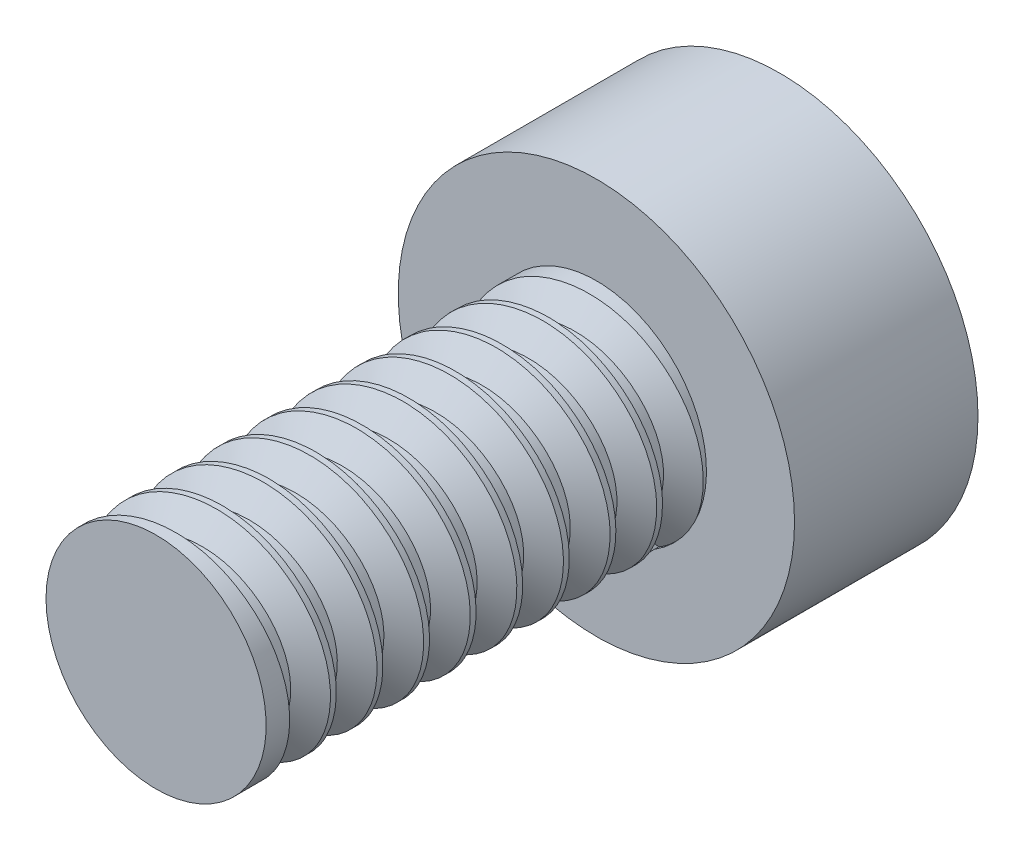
ISO-10303-21;
HEADER;
FILE_DESCRIPTION(('STEP AP214'),'2;1');
FILE_NAME('part.step','',(''),(''),'','','');
FILE_SCHEMA(('AUTOMOTIVE_DESIGN { 1 0 10303 214 1 1 1 1 }'));
ENDSEC;
DATA;
#1=APPLICATION_CONTEXT('core data for automotive mechanical design processes');
#2=APPLICATION_PROTOCOL_DEFINITION('international standard','automotive_design',2000,#1);
#3=PRODUCT_CONTEXT('',#1,'mechanical');
#4=PRODUCT('Part','Part','',(#3));
#5=PRODUCT_RELATED_PRODUCT_CATEGORY('part','',(#4));
#6=PRODUCT_DEFINITION_FORMATION('','',#4);
#7=PRODUCT_DEFINITION_CONTEXT('part definition',#1,'design');
#8=PRODUCT_DEFINITION('design','',#6,#7);
#9=PRODUCT_DEFINITION_SHAPE('','',#8);
#10=(LENGTH_UNIT() NAMED_UNIT(*) SI_UNIT(.MILLI.,.METRE.));
#11=(NAMED_UNIT(*) PLANE_ANGLE_UNIT() SI_UNIT($,.RADIAN.));
#12=(NAMED_UNIT(*) SI_UNIT($,.STERADIAN.) SOLID_ANGLE_UNIT());
#13=UNCERTAINTY_MEASURE_WITH_UNIT(LENGTH_MEASURE(1.E-05),#10,'distance_accuracy_value','');
#14=(GEOMETRIC_REPRESENTATION_CONTEXT(3) GLOBAL_UNCERTAINTY_ASSIGNED_CONTEXT((#13)) GLOBAL_UNIT_ASSIGNED_CONTEXT((#10,
#11,#12)) REPRESENTATION_CONTEXT('',''));
#15=CARTESIAN_POINT('',(0.,0.,0.));
#16=DIRECTION('',(0.,0.,1.));
#17=DIRECTION('',(1.,0.,0.));
#18=AXIS2_PLACEMENT_3D('',#15,#16,#17);
#19=CARTESIAN_POINT('',(0.,0.,8.5));
#20=DIRECTION('',(0.,0.,-1.));
#21=DIRECTION('',(-1.,0.,0.));
#22=AXIS2_PLACEMENT_3D('',#19,#20,#21);
#23=CYLINDRICAL_SURFACE('',#22,1.5);
#24=CARTESIAN_POINT('',(-1.5,0.,7.9443750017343));
#25=CARTESIAN_POINT('',(-1.5,0.866025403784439,7.89145833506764));
#26=CARTESIAN_POINT('',(-0.75,1.29903810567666,7.83854166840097));
#27=CARTESIAN_POINT('',(0.,1.73205080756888,7.7856250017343));
#28=CARTESIAN_POINT('',(0.75,1.29903810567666,7.73270833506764));
#29=CARTESIAN_POINT('',(1.5,0.866025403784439,7.67979166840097));
#30=CARTESIAN_POINT('',(1.5,0.,7.6268750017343));
#31=CARTESIAN_POINT('',(1.5,-0.866025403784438,7.57395833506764));
#32=CARTESIAN_POINT('',(0.750000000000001,-1.29903810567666,7.52104166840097));
#33=CARTESIAN_POINT('',(0.,-1.73205080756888,7.4681250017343));
#34=CARTESIAN_POINT('',(-0.749999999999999,-1.29903810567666,7.41520833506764));
#35=CARTESIAN_POINT('',(-1.5,-0.86602540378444,7.36229166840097));
#36=CARTESIAN_POINT('',(-1.5,0.,7.3093750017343));
#37=CARTESIAN_POINT('',(-1.5,0.866025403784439,7.25645833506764));
#38=CARTESIAN_POINT('',(-0.75,1.29903810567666,7.20354166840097));
#39=CARTESIAN_POINT('',(0.,1.73205080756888,7.1506250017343));
#40=CARTESIAN_POINT('',(0.75,1.29903810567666,7.09770833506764));
#41=CARTESIAN_POINT('',(1.5,0.866025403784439,7.04479166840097));
#42=CARTESIAN_POINT('',(1.5,0.,6.9918750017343));
#43=CARTESIAN_POINT('',(1.5,-0.866025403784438,6.93895833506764));
#44=CARTESIAN_POINT('',(0.750000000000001,-1.29903810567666,6.88604166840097));
#45=CARTESIAN_POINT('',(0.,-1.73205080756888,6.8331250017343));
#46=CARTESIAN_POINT('',(-0.749999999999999,-1.29903810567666,6.78020833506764));
#47=CARTESIAN_POINT('',(-1.5,-0.86602540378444,6.72729166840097));
#48=CARTESIAN_POINT('',(-1.5,0.,6.6743750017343));
#49=CARTESIAN_POINT('',(-1.5,0.866025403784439,6.62145833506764));
#50=CARTESIAN_POINT('',(-0.75,1.29903810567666,6.56854166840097));
#51=CARTESIAN_POINT('',(0.,1.73205080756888,6.5156250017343));
#52=CARTESIAN_POINT('',(0.75,1.29903810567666,6.46270833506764));
#53=CARTESIAN_POINT('',(1.5,0.866025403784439,6.40979166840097));
#54=CARTESIAN_POINT('',(1.5,0.,6.3568750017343));
#55=CARTESIAN_POINT('',(1.5,-0.866025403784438,6.30395833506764));
#56=CARTESIAN_POINT('',(0.750000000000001,-1.29903810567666,6.25104166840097));
#57=CARTESIAN_POINT('',(0.,-1.73205080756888,6.1981250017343));
#58=CARTESIAN_POINT('',(-0.749999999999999,-1.29903810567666,6.14520833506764));
#59=CARTESIAN_POINT('',(-1.5,-0.86602540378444,6.09229166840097));
#60=CARTESIAN_POINT('',(-1.5,0.,6.0393750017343));
#61=CARTESIAN_POINT('',(-1.5,0.866025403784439,5.98645833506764));
#62=CARTESIAN_POINT('',(-0.75,1.29903810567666,5.93354166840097));
#63=CARTESIAN_POINT('',(0.,1.73205080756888,5.8806250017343));
#64=CARTESIAN_POINT('',(0.75,1.29903810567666,5.82770833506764));
#65=CARTESIAN_POINT('',(1.5,0.866025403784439,5.77479166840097));
#66=CARTESIAN_POINT('',(1.5,0.,5.7218750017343));
#67=CARTESIAN_POINT('',(1.5,-0.866025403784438,5.66895833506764));
#68=CARTESIAN_POINT('',(0.750000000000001,-1.29903810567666,5.61604166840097));
#69=CARTESIAN_POINT('',(0.,-1.73205080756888,5.5631250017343));
#70=CARTESIAN_POINT('',(-0.749999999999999,-1.29903810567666,5.51020833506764));
#71=CARTESIAN_POINT('',(-1.5,-0.86602540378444,5.45729166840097));
#72=CARTESIAN_POINT('',(-1.5,0.,5.4043750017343));
#73=CARTESIAN_POINT('',(-1.5,0.866025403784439,5.35145833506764));
#74=CARTESIAN_POINT('',(-0.75,1.29903810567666,5.29854166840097));
#75=CARTESIAN_POINT('',(0.,1.73205080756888,5.2456250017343));
#76=CARTESIAN_POINT('',(0.75,1.29903810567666,5.19270833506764));
#77=CARTESIAN_POINT('',(1.5,0.866025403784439,5.13979166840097));
#78=CARTESIAN_POINT('',(1.5,0.,5.0868750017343));
#79=CARTESIAN_POINT('',(1.5,-0.866025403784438,5.03395833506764));
#80=CARTESIAN_POINT('',(0.750000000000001,-1.29903810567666,4.98104166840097));
#81=CARTESIAN_POINT('',(0.,-1.73205080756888,4.9281250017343));
#82=CARTESIAN_POINT('',(-0.749999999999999,-1.29903810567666,4.87520833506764));
#83=CARTESIAN_POINT('',(-1.5,-0.86602540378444,4.82229166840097));
#84=CARTESIAN_POINT('',(-1.5,0.,4.7693750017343));
#85=CARTESIAN_POINT('',(-1.5,0.866025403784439,4.71645833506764));
#86=CARTESIAN_POINT('',(-0.75,1.29903810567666,4.66354166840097));
#87=CARTESIAN_POINT('',(0.,1.73205080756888,4.6106250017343));
#88=CARTESIAN_POINT('',(0.75,1.29903810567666,4.55770833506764));
#89=CARTESIAN_POINT('',(1.5,0.866025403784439,4.50479166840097));
#90=CARTESIAN_POINT('',(1.5,0.,4.4518750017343));
#91=CARTESIAN_POINT('',(1.5,-0.866025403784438,4.39895833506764));
#92=CARTESIAN_POINT('',(0.750000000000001,-1.29903810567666,4.34604166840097));
#93=CARTESIAN_POINT('',(0.,-1.73205080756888,4.2931250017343));
#94=CARTESIAN_POINT('',(-0.749999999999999,-1.29903810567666,4.24020833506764));
#95=CARTESIAN_POINT('',(-1.5,-0.86602540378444,4.18729166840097));
#96=CARTESIAN_POINT('',(-1.5,0.,4.1343750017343));
#97=CARTESIAN_POINT('',(-1.5,0.866025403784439,4.08145833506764));
#98=CARTESIAN_POINT('',(-0.75,1.29903810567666,4.02854166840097));
#99=CARTESIAN_POINT('',(0.,1.73205080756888,3.9756250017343));
#100=CARTESIAN_POINT('',(0.75,1.29903810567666,3.92270833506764));
#101=CARTESIAN_POINT('',(1.5,0.866025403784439,3.86979166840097));
#102=CARTESIAN_POINT('',(1.5,0.,3.8168750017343));
#103=CARTESIAN_POINT('',(1.5,-0.866025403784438,3.76395833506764));
#104=CARTESIAN_POINT('',(0.750000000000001,-1.29903810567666,3.71104166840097));
#105=CARTESIAN_POINT('',(0.,-1.73205080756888,3.6581250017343));
#106=CARTESIAN_POINT('',(-0.749999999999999,-1.29903810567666,3.60520833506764));
#107=CARTESIAN_POINT('',(-1.5,-0.86602540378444,3.55229166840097));
#108=CARTESIAN_POINT('',(-1.5,0.,3.4993750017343));
#109=CARTESIAN_POINT('',(-1.5,0.866025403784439,3.44645833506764));
#110=CARTESIAN_POINT('',(-0.75,1.29903810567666,3.39354166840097));
#111=CARTESIAN_POINT('',(0.,1.73205080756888,3.3406250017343));
#112=CARTESIAN_POINT('',(0.75,1.29903810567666,3.28770833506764));
#113=CARTESIAN_POINT('',(1.5,0.866025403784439,3.23479166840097));
#114=CARTESIAN_POINT('',(1.5,0.,3.1818750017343));
#115=CARTESIAN_POINT('',(1.5,-0.866025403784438,3.12895833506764));
#116=CARTESIAN_POINT('',(0.750000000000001,-1.29903810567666,3.07604166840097));
#117=CARTESIAN_POINT('',(0.,-1.73205080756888,3.0231250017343));
#118=CARTESIAN_POINT('',(-0.749999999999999,-1.29903810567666,2.97020833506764));
#119=CARTESIAN_POINT('',(-1.5,-0.86602540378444,2.91729166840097));
#120=CARTESIAN_POINT('',(-1.5,0.,2.8643750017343));
#121=CARTESIAN_POINT('',(-1.5,0.866025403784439,2.81145833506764));
#122=CARTESIAN_POINT('',(-0.75,1.29903810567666,2.75854166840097));
#123=CARTESIAN_POINT('',(0.,1.73205080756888,2.7056250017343));
#124=CARTESIAN_POINT('',(0.75,1.29903810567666,2.65270833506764));
#125=CARTESIAN_POINT('',(1.5,0.866025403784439,2.59979166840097));
#126=CARTESIAN_POINT('',(1.5,0.,2.5468750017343));
#127=CARTESIAN_POINT('',(1.5,-0.833339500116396,2.49595553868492));
#128=CARTESIAN_POINT('',(0.792444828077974,-1.27358988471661,2.44409398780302));
#129=(BOUNDED_CURVE() B_SPLINE_CURVE(2,(#24,#25,#26,#27,#28,#29,#30,#31,#32,#33,#34,#35,#36,#37,
#38,#39,#40,#41,#42,#43,#44,#45,#46,#47,#48,#49,#50,#51,#52,#53,#54,#55,#56,#57,#58,#59,#60,#61,
#62,#63,#64,#65,#66,#67,#68,#69,#70,#71,#72,#73,#74,#75,#76,#77,#78,#79,#80,#81,#82,#83,#84,#85,
#86,#87,#88,#89,#90,#91,#92,#93,#94,#95,#96,#97,#98,#99,#100,#101,#102,#103,#104,#105,#106,#107,
#108,#109,#110,#111,#112,#113,#114,#115,#116,#117,#118,#119,#120,#121,#122,#123,#124,#125,#126,
#127,#128),.UNSPECIFIED.,.F.,.F.) B_SPLINE_CURVE_WITH_KNOTS((3,2,2,2,2,2,2,2,2,2,2,2,2,2,2,2,2,
2,2,2,2,2,2,2,2,2,2,2,2,2,2,2,2,2,2,2,2,2,2,2,2,2,2,2,2,2,2,2,2,2,2,2,3),(0.,0.0185185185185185,
0.037037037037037,0.0555555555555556,0.0740740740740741,0.0925925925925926,0.111111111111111,
0.12962962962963,0.148148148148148,0.166666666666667,0.185185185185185,0.203703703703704,
0.222222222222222,0.240740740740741,0.259259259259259,0.277777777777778,0.296296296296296,
0.314814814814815,0.333333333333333,0.351851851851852,0.37037037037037,0.388888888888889,
0.407407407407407,0.425925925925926,0.444444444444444,0.462962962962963,0.481481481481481,0.5,
0.518518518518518,0.537037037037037,0.555555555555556,0.574074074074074,0.592592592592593,
0.611111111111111,0.62962962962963,0.648148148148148,0.666666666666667,0.685185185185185,
0.703703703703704,0.722222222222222,0.740740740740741,0.759259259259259,0.777777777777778,
0.796296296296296,0.814814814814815,0.833333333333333,0.851851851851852,0.87037037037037,
0.888888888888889,0.907407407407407,0.925925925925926,0.944444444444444,0.962354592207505),
.UNSPECIFIED.) CURVE() GEOMETRIC_REPRESENTATION_ITEM() RATIONAL_B_SPLINE_CURVE((1.,
0.866025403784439,1.,0.866025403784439,1.,0.866025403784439,1.,0.866025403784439,1.,
0.866025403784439,1.,0.866025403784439,1.,0.866025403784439,1.,0.866025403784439,1.,
0.866025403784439,1.,0.866025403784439,1.,0.866025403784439,1.,0.866025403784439,1.,
0.866025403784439,1.,0.866025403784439,1.,0.866025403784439,1.,0.866025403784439,1.,
0.866025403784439,1.,0.866025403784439,1.,0.866025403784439,1.,0.866025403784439,1.,
0.866025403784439,1.,0.866025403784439,1.,0.866025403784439,1.,0.866025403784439,1.,
0.866025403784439,1.,0.866025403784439,1.,0.866025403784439,1.,0.866025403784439,1.,
0.866025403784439,1.,0.866025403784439,1.,0.866025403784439,1.,0.866025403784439,1.,
0.866025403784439,1.,0.866025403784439,1.,0.866025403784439,1.,0.866025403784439,1.,
0.866025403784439,1.,0.866025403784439,1.,0.866025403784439,1.,0.866025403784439,1.,
0.866025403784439,1.,0.866025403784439,1.,0.866025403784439,1.,0.866025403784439,1.,
0.866025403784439,1.,0.866025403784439,1.,0.866025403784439,1.,0.866025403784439,1.,
0.866025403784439,1.,0.866025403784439,1.,0.866025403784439,1.,0.870426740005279,0.991486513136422)) REPRESENTATION_ITEM(''));
#130=CARTESIAN_POINT('',(-1.5,0.,7.9443750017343));
#131=VERTEX_POINT('',#130);
#132=CARTESIAN_POINT('',(-1.5,0.,7.3093750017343));
#133=VERTEX_POINT('',#132);
#134=EDGE_CURVE('E320',#131,#133,#129,.T.);
#135=ORIENTED_EDGE('',*,*,#134,.T.);
#136=CARTESIAN_POINT('',(-1.5,0.,7.9443750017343));
#137=CARTESIAN_POINT('',(-1.5,0.866025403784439,7.89145833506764));
#138=CARTESIAN_POINT('',(-0.75,1.29903810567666,7.83854166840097));
#139=CARTESIAN_POINT('',(0.,1.73205080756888,7.7856250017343));
#140=CARTESIAN_POINT('',(0.75,1.29903810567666,7.73270833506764));
#141=CARTESIAN_POINT('',(1.5,0.866025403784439,7.67979166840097));
#142=CARTESIAN_POINT('',(1.5,0.,7.6268750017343));
#143=CARTESIAN_POINT('',(1.5,-0.866025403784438,7.57395833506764));
#144=CARTESIAN_POINT('',(0.750000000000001,-1.29903810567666,7.52104166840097));
#145=CARTESIAN_POINT('',(0.,-1.73205080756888,7.4681250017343));
#146=CARTESIAN_POINT('',(-0.749999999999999,-1.29903810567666,7.41520833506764));
#147=CARTESIAN_POINT('',(-1.5,-0.86602540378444,7.36229166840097));
#148=CARTESIAN_POINT('',(-1.5,0.,7.3093750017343));
#149=CARTESIAN_POINT('',(-1.5,0.866025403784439,7.25645833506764));
#150=CARTESIAN_POINT('',(-0.75,1.29903810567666,7.20354166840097));
#151=CARTESIAN_POINT('',(0.,1.73205080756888,7.1506250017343));
#152=CARTESIAN_POINT('',(0.75,1.29903810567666,7.09770833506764));
#153=CARTESIAN_POINT('',(1.5,0.866025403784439,7.04479166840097));
#154=CARTESIAN_POINT('',(1.5,0.,6.9918750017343));
#155=CARTESIAN_POINT('',(1.5,-0.866025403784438,6.93895833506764));
#156=CARTESIAN_POINT('',(0.750000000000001,-1.29903810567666,6.88604166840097));
#157=CARTESIAN_POINT('',(0.,-1.73205080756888,6.8331250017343));
#158=CARTESIAN_POINT('',(-0.749999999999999,-1.29903810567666,6.78020833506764));
#159=CARTESIAN_POINT('',(-1.5,-0.86602540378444,6.72729166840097));
#160=CARTESIAN_POINT('',(-1.5,0.,6.6743750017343));
#161=CARTESIAN_POINT('',(-1.5,0.866025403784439,6.62145833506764));
#162=CARTESIAN_POINT('',(-0.75,1.29903810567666,6.56854166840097));
#163=CARTESIAN_POINT('',(0.,1.73205080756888,6.5156250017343));
#164=CARTESIAN_POINT('',(0.75,1.29903810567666,6.46270833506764));
#165=CARTESIAN_POINT('',(1.5,0.866025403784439,6.40979166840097));
#166=CARTESIAN_POINT('',(1.5,0.,6.3568750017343));
#167=CARTESIAN_POINT('',(1.5,-0.866025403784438,6.30395833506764));
#168=CARTESIAN_POINT('',(0.750000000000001,-1.29903810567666,6.25104166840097));
#169=CARTESIAN_POINT('',(0.,-1.73205080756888,6.1981250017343));
#170=CARTESIAN_POINT('',(-0.749999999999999,-1.29903810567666,6.14520833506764));
#171=CARTESIAN_POINT('',(-1.5,-0.86602540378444,6.09229166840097));
#172=CARTESIAN_POINT('',(-1.5,0.,6.0393750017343));
#173=CARTESIAN_POINT('',(-1.5,0.866025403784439,5.98645833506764));
#174=CARTESIAN_POINT('',(-0.75,1.29903810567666,5.93354166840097));
#175=CARTESIAN_POINT('',(0.,1.73205080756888,5.8806250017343));
#176=CARTESIAN_POINT('',(0.75,1.29903810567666,5.82770833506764));
#177=CARTESIAN_POINT('',(1.5,0.866025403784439,5.77479166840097));
#178=CARTESIAN_POINT('',(1.5,0.,5.7218750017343));
#179=CARTESIAN_POINT('',(1.5,-0.866025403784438,5.66895833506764));
#180=CARTESIAN_POINT('',(0.750000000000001,-1.29903810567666,5.61604166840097));
#181=CARTESIAN_POINT('',(0.,-1.73205080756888,5.5631250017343));
#182=CARTESIAN_POINT('',(-0.749999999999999,-1.29903810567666,5.51020833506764));
#183=CARTESIAN_POINT('',(-1.5,-0.86602540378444,5.45729166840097));
#184=CARTESIAN_POINT('',(-1.5,0.,5.4043750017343));
#185=CARTESIAN_POINT('',(-1.5,0.866025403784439,5.35145833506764));
#186=CARTESIAN_POINT('',(-0.75,1.29903810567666,5.29854166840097));
#187=CARTESIAN_POINT('',(0.,1.73205080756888,5.2456250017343));
#188=CARTESIAN_POINT('',(0.75,1.29903810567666,5.19270833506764));
#189=CARTESIAN_POINT('',(1.5,0.866025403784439,5.13979166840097));
#190=CARTESIAN_POINT('',(1.5,0.,5.0868750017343));
#191=CARTESIAN_POINT('',(1.5,-0.866025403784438,5.03395833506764));
#192=CARTESIAN_POINT('',(0.750000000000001,-1.29903810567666,4.98104166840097));
#193=CARTESIAN_POINT('',(0.,-1.73205080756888,4.9281250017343));
#194=CARTESIAN_POINT('',(-0.749999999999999,-1.29903810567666,4.87520833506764));
#195=CARTESIAN_POINT('',(-1.5,-0.86602540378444,4.82229166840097));
#196=CARTESIAN_POINT('',(-1.5,0.,4.7693750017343));
#197=CARTESIAN_POINT('',(-1.5,0.866025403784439,4.71645833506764));
#198=CARTESIAN_POINT('',(-0.75,1.29903810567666,4.66354166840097));
#199=CARTESIAN_POINT('',(0.,1.73205080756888,4.6106250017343));
#200=CARTESIAN_POINT('',(0.75,1.29903810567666,4.55770833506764));
#201=CARTESIAN_POINT('',(1.5,0.866025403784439,4.50479166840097));
#202=CARTESIAN_POINT('',(1.5,0.,4.4518750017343));
#203=CARTESIAN_POINT('',(1.5,-0.866025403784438,4.39895833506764));
#204=CARTESIAN_POINT('',(0.750000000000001,-1.29903810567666,4.34604166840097));
#205=CARTESIAN_POINT('',(0.,-1.73205080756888,4.2931250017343));
#206=CARTESIAN_POINT('',(-0.749999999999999,-1.29903810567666,4.24020833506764));
#207=CARTESIAN_POINT('',(-1.5,-0.86602540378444,4.18729166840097));
#208=CARTESIAN_POINT('',(-1.5,0.,4.1343750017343));
#209=CARTESIAN_POINT('',(-1.5,0.866025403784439,4.08145833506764));
#210=CARTESIAN_POINT('',(-0.75,1.29903810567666,4.02854166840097));
#211=CARTESIAN_POINT('',(0.,1.73205080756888,3.9756250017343));
#212=CARTESIAN_POINT('',(0.75,1.29903810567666,3.92270833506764));
#213=CARTESIAN_POINT('',(1.5,0.866025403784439,3.86979166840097));
#214=CARTESIAN_POINT('',(1.5,0.,3.8168750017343));
#215=CARTESIAN_POINT('',(1.5,-0.866025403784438,3.76395833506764));
#216=CARTESIAN_POINT('',(0.750000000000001,-1.29903810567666,3.71104166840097));
#217=CARTESIAN_POINT('',(0.,-1.73205080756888,3.6581250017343));
#218=CARTESIAN_POINT('',(-0.749999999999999,-1.29903810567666,3.60520833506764));
#219=CARTESIAN_POINT('',(-1.5,-0.86602540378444,3.55229166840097));
#220=CARTESIAN_POINT('',(-1.5,0.,3.4993750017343));
#221=CARTESIAN_POINT('',(-1.5,0.866025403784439,3.44645833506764));
#222=CARTESIAN_POINT('',(-0.75,1.29903810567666,3.39354166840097));
#223=CARTESIAN_POINT('',(0.,1.73205080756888,3.3406250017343));
#224=CARTESIAN_POINT('',(0.75,1.29903810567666,3.28770833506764));
#225=CARTESIAN_POINT('',(1.5,0.866025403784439,3.23479166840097));
#226=CARTESIAN_POINT('',(1.5,0.,3.1818750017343));
#227=CARTESIAN_POINT('',(1.5,-0.866025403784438,3.12895833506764));
#228=CARTESIAN_POINT('',(0.750000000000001,-1.29903810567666,3.07604166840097));
#229=CARTESIAN_POINT('',(0.,-1.73205080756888,3.0231250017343));
#230=CARTESIAN_POINT('',(-0.749999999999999,-1.29903810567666,2.97020833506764));
#231=CARTESIAN_POINT('',(-1.5,-0.86602540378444,2.91729166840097));
#232=CARTESIAN_POINT('',(-1.5,0.,2.8643750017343));
#233=CARTESIAN_POINT('',(-1.5,0.866025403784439,2.81145833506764));
#234=CARTESIAN_POINT('',(-0.75,1.29903810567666,2.75854166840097));
#235=CARTESIAN_POINT('',(0.,1.73205080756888,2.7056250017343));
#236=CARTESIAN_POINT('',(0.75,1.29903810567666,2.65270833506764));
#237=CARTESIAN_POINT('',(1.5,0.866025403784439,2.59979166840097));
#238=CARTESIAN_POINT('',(1.5,0.,2.5468750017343));
#239=CARTESIAN_POINT('',(1.5,-0.833342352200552,2.4959553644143));
#240=CARTESIAN_POINT('',(0.792441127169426,-1.27359218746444,2.44409371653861));
#241=(BOUNDED_CURVE() B_SPLINE_CURVE(2,(#136,#137,#138,#139,#140,#141,#142,#143,#144,#145,#146,
#147,#148,#149,#150,#151,#152,#153,#154,#155,#156,#157,#158,#159,#160,#161,#162,#163,#164,#165,
#166,#167,#168,#169,#170,#171,#172,#173,#174,#175,#176,#177,#178,#179,#180,#181,#182,#183,#184,
#185,#186,#187,#188,#189,#190,#191,#192,#193,#194,#195,#196,#197,#198,#199,#200,#201,#202,#203,
#204,#205,#206,#207,#208,#209,#210,#211,#212,#213,#214,#215,#216,#217,#218,#219,#220,#221,#222,
#223,#224,#225,#226,#227,#228,#229,#230,#231,#232,#233,#234,#235,#236,#237,#238,#239,#240),
.UNSPECIFIED.,.F.,.F.) B_SPLINE_CURVE_WITH_KNOTS((3,2,2,2,2,2,2,2,2,2,2,2,2,2,2,2,2,2,2,2,2,2,2,
2,2,2,2,2,2,2,2,2,2,2,2,2,2,2,2,2,2,2,2,2,2,2,2,2,2,2,2,2,3),(0.,0.0185185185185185,
0.037037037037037,0.0555555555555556,0.0740740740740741,0.0925925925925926,0.111111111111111,
0.12962962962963,0.148148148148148,0.166666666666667,0.185185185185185,0.203703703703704,
0.222222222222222,0.240740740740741,0.259259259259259,0.277777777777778,0.296296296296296,
0.314814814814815,0.333333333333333,0.351851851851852,0.37037037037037,0.388888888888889,
0.407407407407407,0.425925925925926,0.444444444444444,0.462962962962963,0.481481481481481,0.5,
0.518518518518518,0.537037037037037,0.555555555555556,0.574074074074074,0.592592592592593,
0.611111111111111,0.62962962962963,0.648148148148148,0.666666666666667,0.685185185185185,
0.703703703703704,0.722222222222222,0.740740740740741,0.759259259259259,0.777777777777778,
0.796296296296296,0.814814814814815,0.833333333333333,0.851851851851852,0.87037037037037,
0.888888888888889,0.907407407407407,0.925925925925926,0.944444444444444,0.962354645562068),
.UNSPECIFIED.) CURVE() GEOMETRIC_REPRESENTATION_ITEM() RATIONAL_B_SPLINE_CURVE((1.,
0.866025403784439,1.,0.866025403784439,1.,0.866025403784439,1.,0.866025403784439,1.,
0.866025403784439,1.,0.866025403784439,1.,0.866025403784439,1.,0.866025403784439,1.,
0.866025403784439,1.,0.866025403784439,1.,0.866025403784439,1.,0.866025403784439,1.,
0.866025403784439,1.,0.866025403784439,1.,0.866025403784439,1.,0.866025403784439,1.,
0.866025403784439,1.,0.866025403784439,1.,0.866025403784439,1.,0.866025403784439,1.,
0.866025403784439,1.,0.866025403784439,1.,0.866025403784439,1.,0.866025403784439,1.,
0.866025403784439,1.,0.866025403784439,1.,0.866025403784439,1.,0.866025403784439,1.,
0.866025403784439,1.,0.866025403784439,1.,0.866025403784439,1.,0.866025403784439,1.,
0.866025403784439,1.,0.866025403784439,1.,0.866025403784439,1.,0.866025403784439,1.,
0.866025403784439,1.,0.866025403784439,1.,0.866025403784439,1.,0.866025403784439,1.,
0.866025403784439,1.,0.866025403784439,1.,0.866025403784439,1.,0.866025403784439,1.,
0.866025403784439,1.,0.866025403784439,1.,0.866025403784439,1.,0.866025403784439,1.,
0.866025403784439,1.,0.866025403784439,1.,0.866025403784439,1.,0.870426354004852,0.991487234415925)) REPRESENTATION_ITEM(''));
#242=CARTESIAN_POINT('',(1.33973462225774,-0.674619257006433,2.5));
#243=VERTEX_POINT('',#242);
#244=EDGE_CURVE('E12',#243,#133,#241,.F.);
#245=ORIENTED_EDGE('',*,*,#244,.F.);
#246=CARTESIAN_POINT('',(0.,0.,2.5));
#247=DIRECTION('',(0.,0.,1.));
#248=DIRECTION('',(1.,0.,0.));
#249=AXIS2_PLACEMENT_3D('',#246,#247,#248);
#250=CIRCLE('',#249,1.5);
#251=CARTESIAN_POINT('',(0.792444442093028,-1.2735901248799,2.49989999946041));
#252=VERTEX_POINT('',#251);
#253=EDGE_CURVE('E351',#243,#252,#250,.T.);
#254=ORIENTED_EDGE('',*,*,#253,.T.);
#255=CARTESIAN_POINT('',(0.792444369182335,-1.27359043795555,2.49989999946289));
#256=CARTESIAN_POINT('',(0.792444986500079,-1.27358991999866,2.58320321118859));
#257=CARTESIAN_POINT('',(0.792445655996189,-1.27358941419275,2.66650642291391));
#258=CARTESIAN_POINT('',(0.792447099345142,-1.27358842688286,2.83311284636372));
#259=CARTESIAN_POINT('',(0.792447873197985,-1.27358794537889,2.91641605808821));
#260=CARTESIAN_POINT('',(0.792448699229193,-1.2735874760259,2.99971926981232));
#261=B_SPLINE_CURVE_WITH_KNOTS('',3,(#255,#256,#257,#258,#259,#260),.UNSPECIFIED.,.F.,.F.,(4,2,
4),(0.,0.249909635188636,0.499819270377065),.UNSPECIFIED.);
#262=CARTESIAN_POINT('',(0.792448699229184,-1.27358747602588,2.99971926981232));
#263=VERTEX_POINT('',#262);
#264=EDGE_CURVE('E55',#252,#263,#261,.T.);
#265=ORIENTED_EDGE('',*,*,#264,.T.);
#266=CARTESIAN_POINT('',(-1.5,0.,8.5));
#267=CARTESIAN_POINT('',(-1.5,0.866025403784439,8.44708333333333));
#268=CARTESIAN_POINT('',(-0.75,1.29903810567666,8.39416666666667));
#269=CARTESIAN_POINT('',(0.,1.73205080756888,8.34125));
#270=CARTESIAN_POINT('',(0.75,1.29903810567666,8.28833333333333));
#271=CARTESIAN_POINT('',(1.5,0.866025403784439,8.23541666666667));
#272=CARTESIAN_POINT('',(1.5,0.,8.1825));
#273=CARTESIAN_POINT('',(1.5,-0.866025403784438,8.12958333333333));
#274=CARTESIAN_POINT('',(0.750000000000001,-1.29903810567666,8.07666666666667));
#275=CARTESIAN_POINT('',(0.,-1.73205080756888,8.02375));
#276=CARTESIAN_POINT('',(-0.749999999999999,-1.29903810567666,7.97083333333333));
#277=CARTESIAN_POINT('',(-1.5,-0.86602540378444,7.91791666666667));
#278=CARTESIAN_POINT('',(-1.5,0.,7.865));
#279=CARTESIAN_POINT('',(-1.5,0.866025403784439,7.81208333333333));
#280=CARTESIAN_POINT('',(-0.75,1.29903810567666,7.75916666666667));
#281=CARTESIAN_POINT('',(0.,1.73205080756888,7.70625));
#282=CARTESIAN_POINT('',(0.75,1.29903810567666,7.65333333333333));
#283=CARTESIAN_POINT('',(1.5,0.866025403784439,7.60041666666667));
#284=CARTESIAN_POINT('',(1.5,0.,7.5475));
#285=CARTESIAN_POINT('',(1.5,-0.866025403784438,7.49458333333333));
#286=CARTESIAN_POINT('',(0.750000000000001,-1.29903810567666,7.44166666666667));
#287=CARTESIAN_POINT('',(0.,-1.73205080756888,7.38875));
#288=CARTESIAN_POINT('',(-0.749999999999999,-1.29903810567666,7.33583333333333));
#289=CARTESIAN_POINT('',(-1.5,-0.86602540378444,7.28291666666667));
#290=CARTESIAN_POINT('',(-1.5,0.,7.23));
#291=CARTESIAN_POINT('',(-1.5,0.866025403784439,7.17708333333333));
#292=CARTESIAN_POINT('',(-0.75,1.29903810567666,7.12416666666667));
#293=CARTESIAN_POINT('',(0.,1.73205080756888,7.07125));
#294=CARTESIAN_POINT('',(0.75,1.29903810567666,7.01833333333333));
#295=CARTESIAN_POINT('',(1.5,0.866025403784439,6.96541666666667));
#296=CARTESIAN_POINT('',(1.5,0.,6.9125));
#297=CARTESIAN_POINT('',(1.5,-0.866025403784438,6.85958333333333));
#298=CARTESIAN_POINT('',(0.750000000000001,-1.29903810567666,6.80666666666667));
#299=CARTESIAN_POINT('',(0.,-1.73205080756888,6.75375));
#300=CARTESIAN_POINT('',(-0.749999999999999,-1.29903810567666,6.70083333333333));
#301=CARTESIAN_POINT('',(-1.5,-0.86602540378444,6.64791666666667));
#302=CARTESIAN_POINT('',(-1.5,0.,6.595));
#303=CARTESIAN_POINT('',(-1.5,0.866025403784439,6.54208333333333));
#304=CARTESIAN_POINT('',(-0.75,1.29903810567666,6.48916666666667));
#305=CARTESIAN_POINT('',(0.,1.73205080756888,6.43625));
#306=CARTESIAN_POINT('',(0.75,1.29903810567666,6.38333333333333));
#307=CARTESIAN_POINT('',(1.5,0.866025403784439,6.33041666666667));
#308=CARTESIAN_POINT('',(1.5,0.,6.2775));
#309=CARTESIAN_POINT('',(1.5,-0.866025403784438,6.22458333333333));
#310=CARTESIAN_POINT('',(0.750000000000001,-1.29903810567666,6.17166666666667));
#311=CARTESIAN_POINT('',(0.,-1.73205080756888,6.11875));
#312=CARTESIAN_POINT('',(-0.749999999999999,-1.29903810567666,6.06583333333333));
#313=CARTESIAN_POINT('',(-1.5,-0.86602540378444,6.01291666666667));
#314=CARTESIAN_POINT('',(-1.5,0.,5.96));
#315=CARTESIAN_POINT('',(-1.5,0.866025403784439,5.90708333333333));
#316=CARTESIAN_POINT('',(-0.75,1.29903810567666,5.85416666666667));
#317=CARTESIAN_POINT('',(0.,1.73205080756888,5.80125));
#318=CARTESIAN_POINT('',(0.75,1.29903810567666,5.74833333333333));
#319=CARTESIAN_POINT('',(1.5,0.866025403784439,5.69541666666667));
#320=CARTESIAN_POINT('',(1.5,0.,5.6425));
#321=CARTESIAN_POINT('',(1.5,-0.866025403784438,5.58958333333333));
#322=CARTESIAN_POINT('',(0.750000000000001,-1.29903810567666,5.53666666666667));
#323=CARTESIAN_POINT('',(0.,-1.73205080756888,5.48375));
#324=CARTESIAN_POINT('',(-0.749999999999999,-1.29903810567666,5.43083333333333));
#325=CARTESIAN_POINT('',(-1.5,-0.86602540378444,5.37791666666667));
#326=CARTESIAN_POINT('',(-1.5,0.,5.325));
#327=CARTESIAN_POINT('',(-1.5,0.866025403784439,5.27208333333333));
#328=CARTESIAN_POINT('',(-0.75,1.29903810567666,5.21916666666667));
#329=CARTESIAN_POINT('',(0.,1.73205080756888,5.16625));
#330=CARTESIAN_POINT('',(0.75,1.29903810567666,5.11333333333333));
#331=CARTESIAN_POINT('',(1.5,0.866025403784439,5.06041666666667));
#332=CARTESIAN_POINT('',(1.5,0.,5.0075));
#333=CARTESIAN_POINT('',(1.5,-0.866025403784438,4.95458333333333));
#334=CARTESIAN_POINT('',(0.750000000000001,-1.29903810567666,4.90166666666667));
#335=CARTESIAN_POINT('',(0.,-1.73205080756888,4.84875));
#336=CARTESIAN_POINT('',(-0.749999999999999,-1.29903810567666,4.79583333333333));
#337=CARTESIAN_POINT('',(-1.5,-0.86602540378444,4.74291666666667));
#338=CARTESIAN_POINT('',(-1.5,0.,4.69));
#339=CARTESIAN_POINT('',(-1.5,0.866025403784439,4.63708333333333));
#340=CARTESIAN_POINT('',(-0.75,1.29903810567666,4.58416666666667));
#341=CARTESIAN_POINT('',(0.,1.73205080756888,4.53125));
#342=CARTESIAN_POINT('',(0.75,1.29903810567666,4.47833333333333));
#343=CARTESIAN_POINT('',(1.5,0.866025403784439,4.42541666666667));
#344=CARTESIAN_POINT('',(1.5,0.,4.3725));
#345=CARTESIAN_POINT('',(1.5,-0.866025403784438,4.31958333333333));
#346=CARTESIAN_POINT('',(0.750000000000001,-1.29903810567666,4.26666666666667));
#347=CARTESIAN_POINT('',(0.,-1.73205080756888,4.21375));
#348=CARTESIAN_POINT('',(-0.749999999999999,-1.29903810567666,4.16083333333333));
#349=CARTESIAN_POINT('',(-1.5,-0.86602540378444,4.10791666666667));
#350=CARTESIAN_POINT('',(-1.5,0.,4.055));
#351=CARTESIAN_POINT('',(-1.5,0.866025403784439,4.00208333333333));
#352=CARTESIAN_POINT('',(-0.75,1.29903810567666,3.94916666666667));
#353=CARTESIAN_POINT('',(0.,1.73205080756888,3.89625));
#354=CARTESIAN_POINT('',(0.75,1.29903810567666,3.84333333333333));
#355=CARTESIAN_POINT('',(1.5,0.866025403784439,3.79041666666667));
#356=CARTESIAN_POINT('',(1.5,0.,3.7375));
#357=CARTESIAN_POINT('',(1.5,-0.866025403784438,3.68458333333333));
#358=CARTESIAN_POINT('',(0.750000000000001,-1.29903810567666,3.63166666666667));
#359=CARTESIAN_POINT('',(0.,-1.73205080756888,3.57875));
#360=CARTESIAN_POINT('',(-0.749999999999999,-1.29903810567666,3.52583333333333));
#361=CARTESIAN_POINT('',(-1.5,-0.86602540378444,3.47291666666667));
#362=CARTESIAN_POINT('',(-1.5,0.,3.42));
#363=CARTESIAN_POINT('',(-1.5,0.866025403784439,3.36708333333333));
#364=CARTESIAN_POINT('',(-0.75,1.29903810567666,3.31416666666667));
#365=CARTESIAN_POINT('',(0.,1.73205080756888,3.26125));
#366=CARTESIAN_POINT('',(0.75,1.29903810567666,3.20833333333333));
#367=CARTESIAN_POINT('',(1.5,0.866025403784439,3.15541666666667));
#368=CARTESIAN_POINT('',(1.5,0.,3.1025));
#369=CARTESIAN_POINT('',(1.5,-0.833339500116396,3.05158053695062));
#370=CARTESIAN_POINT('',(0.792444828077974,-1.27358988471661,2.99971898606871));
#371=(BOUNDED_CURVE() B_SPLINE_CURVE(2,(#266,#267,#268,#269,#270,#271,#272,#273,#274,#275,#276,
#277,#278,#279,#280,#281,#282,#283,#284,#285,#286,#287,#288,#289,#290,#291,#292,#293,#294,#295,
#296,#297,#298,#299,#300,#301,#302,#303,#304,#305,#306,#307,#308,#309,#310,#311,#312,#313,#314,
#315,#316,#317,#318,#319,#320,#321,#322,#323,#324,#325,#326,#327,#328,#329,#330,#331,#332,#333,
#334,#335,#336,#337,#338,#339,#340,#341,#342,#343,#344,#345,#346,#347,#348,#349,#350,#351,#352,
#353,#354,#355,#356,#357,#358,#359,#360,#361,#362,#363,#364,#365,#366,#367,#368,#369,#370),
.UNSPECIFIED.,.F.,.F.) B_SPLINE_CURVE_WITH_KNOTS((3,2,2,2,2,2,2,2,2,2,2,2,2,2,2,2,2,2,2,2,2,2,2,
2,2,2,2,2,2,2,2,2,2,2,2,2,2,2,2,2,2,2,2,2,2,2,2,2,2,2,2,2,3),(0.,0.0185185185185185,
0.037037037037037,0.0555555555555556,0.0740740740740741,0.0925925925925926,0.111111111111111,
0.12962962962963,0.148148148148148,0.166666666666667,0.185185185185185,0.203703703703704,
0.222222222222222,0.240740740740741,0.259259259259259,0.277777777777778,0.296296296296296,
0.314814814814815,0.333333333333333,0.351851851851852,0.37037037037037,0.388888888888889,
0.407407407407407,0.425925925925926,0.444444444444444,0.462962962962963,0.481481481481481,0.5,
0.518518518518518,0.537037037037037,0.555555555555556,0.574074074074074,0.592592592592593,
0.611111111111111,0.62962962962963,0.648148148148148,0.666666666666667,0.685185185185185,
0.703703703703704,0.722222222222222,0.740740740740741,0.759259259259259,0.777777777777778,
0.796296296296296,0.814814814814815,0.833333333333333,0.851851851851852,0.87037037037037,
0.888888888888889,0.907407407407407,0.925925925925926,0.944444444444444,0.962354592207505),
.UNSPECIFIED.) CURVE() GEOMETRIC_REPRESENTATION_ITEM() RATIONAL_B_SPLINE_CURVE((1.,
0.866025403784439,1.,0.866025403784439,1.,0.866025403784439,1.,0.866025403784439,1.,
0.866025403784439,1.,0.866025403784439,1.,0.866025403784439,1.,0.866025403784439,1.,
0.866025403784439,1.,0.866025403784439,1.,0.866025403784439,1.,0.866025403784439,1.,
0.866025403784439,1.,0.866025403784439,1.,0.866025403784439,1.,0.866025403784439,1.,
0.866025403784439,1.,0.866025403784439,1.,0.866025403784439,1.,0.866025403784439,1.,
0.866025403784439,1.,0.866025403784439,1.,0.866025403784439,1.,0.866025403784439,1.,
0.866025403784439,1.,0.866025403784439,1.,0.866025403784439,1.,0.866025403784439,1.,
0.866025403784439,1.,0.866025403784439,1.,0.866025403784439,1.,0.866025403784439,1.,
0.866025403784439,1.,0.866025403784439,1.,0.866025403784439,1.,0.866025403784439,1.,
0.866025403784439,1.,0.866025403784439,1.,0.866025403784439,1.,0.866025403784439,1.,
0.866025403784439,1.,0.866025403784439,1.,0.866025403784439,1.,0.866025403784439,1.,
0.866025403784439,1.,0.866025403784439,1.,0.866025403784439,1.,0.866025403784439,1.,
0.866025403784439,1.,0.866025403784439,1.,0.866025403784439,1.,0.870426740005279,0.991486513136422)) REPRESENTATION_ITEM(''));
#372=CARTESIAN_POINT('',(-1.5,0.,7.865));
#373=VERTEX_POINT('',#372);
#374=EDGE_CURVE('E355',#263,#373,#371,.F.);
#375=ORIENTED_EDGE('',*,*,#374,.T.);
#376=CARTESIAN_POINT('',(-1.5,0.,8.5));
#377=CARTESIAN_POINT('',(-1.5,0.866025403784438,8.44708333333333));
#378=CARTESIAN_POINT('',(-0.75,1.29903810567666,8.39416666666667));
#379=CARTESIAN_POINT('',(0.,1.73205080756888,8.34125));
#380=CARTESIAN_POINT('',(0.75,1.29903810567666,8.28833333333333));
#381=CARTESIAN_POINT('',(1.5,0.866025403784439,8.23541666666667));
#382=CARTESIAN_POINT('',(1.5,0.,8.1825));
#383=CARTESIAN_POINT('',(1.5,-0.866025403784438,8.12958333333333));
#384=CARTESIAN_POINT('',(0.750000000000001,-1.29903810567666,8.07666666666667));
#385=CARTESIAN_POINT('',(0.,-1.73205080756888,8.02375));
#386=CARTESIAN_POINT('',(-0.749999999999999,-1.29903810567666,7.97083333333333));
#387=CARTESIAN_POINT('',(-1.5,-0.866025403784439,7.91791666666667));
#388=CARTESIAN_POINT('',(-1.5,0.,7.865));
#389=CARTESIAN_POINT('',(-1.5,0.866025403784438,7.81208333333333));
#390=CARTESIAN_POINT('',(-0.75,1.29903810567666,7.75916666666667));
#391=CARTESIAN_POINT('',(0.,1.73205080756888,7.70625));
#392=CARTESIAN_POINT('',(0.75,1.29903810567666,7.65333333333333));
#393=CARTESIAN_POINT('',(1.5,0.866025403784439,7.60041666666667));
#394=CARTESIAN_POINT('',(1.5,0.,7.5475));
#395=CARTESIAN_POINT('',(1.5,-0.866025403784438,7.49458333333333));
#396=CARTESIAN_POINT('',(0.750000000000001,-1.29903810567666,7.44166666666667));
#397=CARTESIAN_POINT('',(0.,-1.73205080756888,7.38875));
#398=CARTESIAN_POINT('',(-0.749999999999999,-1.29903810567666,7.33583333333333));
#399=CARTESIAN_POINT('',(-1.5,-0.866025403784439,7.28291666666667));
#400=CARTESIAN_POINT('',(-1.5,0.,7.23));
#401=CARTESIAN_POINT('',(-1.5,0.866025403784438,7.17708333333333));
#402=CARTESIAN_POINT('',(-0.75,1.29903810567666,7.12416666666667));
#403=CARTESIAN_POINT('',(0.,1.73205080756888,7.07125));
#404=CARTESIAN_POINT('',(0.75,1.29903810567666,7.01833333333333));
#405=CARTESIAN_POINT('',(1.5,0.866025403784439,6.96541666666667));
#406=CARTESIAN_POINT('',(1.5,0.,6.9125));
#407=CARTESIAN_POINT('',(1.5,-0.866025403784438,6.85958333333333));
#408=CARTESIAN_POINT('',(0.750000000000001,-1.29903810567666,6.80666666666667));
#409=CARTESIAN_POINT('',(0.,-1.73205080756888,6.75375));
#410=CARTESIAN_POINT('',(-0.749999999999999,-1.29903810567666,6.70083333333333));
#411=CARTESIAN_POINT('',(-1.5,-0.866025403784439,6.64791666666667));
#412=CARTESIAN_POINT('',(-1.5,0.,6.595));
#413=CARTESIAN_POINT('',(-1.5,0.866025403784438,6.54208333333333));
#414=CARTESIAN_POINT('',(-0.75,1.29903810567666,6.48916666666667));
#415=CARTESIAN_POINT('',(0.,1.73205080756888,6.43625));
#416=CARTESIAN_POINT('',(0.75,1.29903810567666,6.38333333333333));
#417=CARTESIAN_POINT('',(1.5,0.866025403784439,6.33041666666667));
#418=CARTESIAN_POINT('',(1.5,0.,6.2775));
#419=CARTESIAN_POINT('',(1.5,-0.866025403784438,6.22458333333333));
#420=CARTESIAN_POINT('',(0.750000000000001,-1.29903810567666,6.17166666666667));
#421=CARTESIAN_POINT('',(0.,-1.73205080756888,6.11875));
#422=CARTESIAN_POINT('',(-0.749999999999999,-1.29903810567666,6.06583333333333));
#423=CARTESIAN_POINT('',(-1.5,-0.866025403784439,6.01291666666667));
#424=CARTESIAN_POINT('',(-1.5,0.,5.96));
#425=CARTESIAN_POINT('',(-1.5,0.866025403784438,5.90708333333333));
#426=CARTESIAN_POINT('',(-0.75,1.29903810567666,5.85416666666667));
#427=CARTESIAN_POINT('',(0.,1.73205080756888,5.80125));
#428=CARTESIAN_POINT('',(0.75,1.29903810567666,5.74833333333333));
#429=CARTESIAN_POINT('',(1.5,0.866025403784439,5.69541666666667));
#430=CARTESIAN_POINT('',(1.5,0.,5.6425));
#431=CARTESIAN_POINT('',(1.5,-0.866025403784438,5.58958333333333));
#432=CARTESIAN_POINT('',(0.750000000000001,-1.29903810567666,5.53666666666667));
#433=CARTESIAN_POINT('',(0.,-1.73205080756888,5.48375));
#434=CARTESIAN_POINT('',(-0.749999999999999,-1.29903810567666,5.43083333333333));
#435=CARTESIAN_POINT('',(-1.5,-0.866025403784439,5.37791666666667));
#436=CARTESIAN_POINT('',(-1.5,0.,5.325));
#437=CARTESIAN_POINT('',(-1.5,0.866025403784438,5.27208333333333));
#438=CARTESIAN_POINT('',(-0.75,1.29903810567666,5.21916666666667));
#439=CARTESIAN_POINT('',(0.,1.73205080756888,5.16625));
#440=CARTESIAN_POINT('',(0.75,1.29903810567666,5.11333333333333));
#441=CARTESIAN_POINT('',(1.5,0.866025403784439,5.06041666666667));
#442=CARTESIAN_POINT('',(1.5,0.,5.0075));
#443=CARTESIAN_POINT('',(1.5,-0.866025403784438,4.95458333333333));
#444=CARTESIAN_POINT('',(0.750000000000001,-1.29903810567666,4.90166666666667));
#445=CARTESIAN_POINT('',(0.,-1.73205080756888,4.84875));
#446=CARTESIAN_POINT('',(-0.749999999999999,-1.29903810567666,4.79583333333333));
#447=CARTESIAN_POINT('',(-1.5,-0.866025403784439,4.74291666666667));
#448=CARTESIAN_POINT('',(-1.5,0.,4.69));
#449=CARTESIAN_POINT('',(-1.5,0.866025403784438,4.63708333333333));
#450=CARTESIAN_POINT('',(-0.75,1.29903810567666,4.58416666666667));
#451=CARTESIAN_POINT('',(0.,1.73205080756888,4.53125));
#452=CARTESIAN_POINT('',(0.75,1.29903810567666,4.47833333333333));
#453=CARTESIAN_POINT('',(1.5,0.866025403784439,4.42541666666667));
#454=CARTESIAN_POINT('',(1.5,0.,4.3725));
#455=CARTESIAN_POINT('',(1.5,-0.866025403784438,4.31958333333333));
#456=CARTESIAN_POINT('',(0.750000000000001,-1.29903810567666,4.26666666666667));
#457=CARTESIAN_POINT('',(0.,-1.73205080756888,4.21375));
#458=CARTESIAN_POINT('',(-0.749999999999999,-1.29903810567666,4.16083333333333));
#459=CARTESIAN_POINT('',(-1.5,-0.866025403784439,4.10791666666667));
#460=CARTESIAN_POINT('',(-1.5,0.,4.055));
#461=CARTESIAN_POINT('',(-1.5,0.866025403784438,4.00208333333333));
#462=CARTESIAN_POINT('',(-0.75,1.29903810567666,3.94916666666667));
#463=CARTESIAN_POINT('',(0.,1.73205080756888,3.89625));
#464=CARTESIAN_POINT('',(0.75,1.29903810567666,3.84333333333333));
#465=CARTESIAN_POINT('',(1.5,0.866025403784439,3.79041666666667));
#466=CARTESIAN_POINT('',(1.5,0.,3.7375));
#467=CARTESIAN_POINT('',(1.5,-0.866025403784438,3.68458333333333));
#468=CARTESIAN_POINT('',(0.750000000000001,-1.29903810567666,3.63166666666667));
#469=CARTESIAN_POINT('',(0.,-1.73205080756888,3.57875));
#470=CARTESIAN_POINT('',(-0.749999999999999,-1.29903810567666,3.52583333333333));
#471=CARTESIAN_POINT('',(-1.5,-0.866025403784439,3.47291666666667));
#472=CARTESIAN_POINT('',(-1.5,0.,3.42));
#473=CARTESIAN_POINT('',(-1.5,0.866025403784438,3.36708333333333));
#474=CARTESIAN_POINT('',(-0.75,1.29903810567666,3.31416666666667));
#475=CARTESIAN_POINT('',(0.,1.73205080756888,3.26125));
#476=CARTESIAN_POINT('',(0.75,1.29903810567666,3.20833333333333));
#477=CARTESIAN_POINT('',(1.5,0.866025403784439,3.15541666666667));
#478=CARTESIAN_POINT('',(1.5,0.,3.1025));
#479=CARTESIAN_POINT('',(1.5,-0.833336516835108,3.05158071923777));
#480=CARTESIAN_POINT('',(0.792448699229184,-1.27358747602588,2.99971926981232));
#481=(BOUNDED_CURVE() B_SPLINE_CURVE(2,(#376,#377,#378,#379,#380,#381,#382,#383,#384,#385,#386,
#387,#388,#389,#390,#391,#392,#393,#394,#395,#396,#397,#398,#399,#400,#401,#402,#403,#404,#405,
#406,#407,#408,#409,#410,#411,#412,#413,#414,#415,#416,#417,#418,#419,#420,#421,#422,#423,#424,
#425,#426,#427,#428,#429,#430,#431,#432,#433,#434,#435,#436,#437,#438,#439,#440,#441,#442,#443,
#444,#445,#446,#447,#448,#449,#450,#451,#452,#453,#454,#455,#456,#457,#458,#459,#460,#461,#462,
#463,#464,#465,#466,#467,#468,#469,#470,#471,#472,#473,#474,#475,#476,#477,#478,#479,#480),
.UNSPECIFIED.,.F.,.F.) B_SPLINE_CURVE_WITH_KNOTS((3,2,2,2,2,2,2,2,2,2,2,2,2,2,2,2,2,2,2,2,2,2,2,
2,2,2,2,2,2,2,2,2,2,2,2,2,2,2,2,2,2,2,2,2,2,2,2,2,2,2,2,2,3),(0.,0.0185185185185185,
0.037037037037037,0.0555555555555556,0.0740740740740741,0.0925925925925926,0.111111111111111,
0.12962962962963,0.148148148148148,0.166666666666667,0.185185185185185,0.203703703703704,
0.222222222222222,0.240740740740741,0.259259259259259,0.277777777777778,0.296296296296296,
0.314814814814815,0.333333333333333,0.351851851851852,0.37037037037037,0.388888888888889,
0.407407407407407,0.425925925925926,0.444444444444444,0.462962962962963,0.481481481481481,0.5,
0.518518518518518,0.537037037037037,0.555555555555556,0.574074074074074,0.592592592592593,
0.611111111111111,0.62962962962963,0.648148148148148,0.666666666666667,0.685185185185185,
0.703703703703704,0.722222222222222,0.740740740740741,0.759259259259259,0.777777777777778,
0.796296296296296,0.814814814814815,0.833333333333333,0.851851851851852,0.87037037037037,
0.888888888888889,0.907407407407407,0.925925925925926,0.944444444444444,0.962354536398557),
.UNSPECIFIED.) CURVE() GEOMETRIC_REPRESENTATION_ITEM() RATIONAL_B_SPLINE_CURVE((1.,
0.866025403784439,1.,0.866025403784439,1.,0.866025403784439,1.,0.866025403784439,1.,
0.866025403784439,1.,0.866025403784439,1.,0.866025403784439,1.,0.866025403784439,1.,
0.866025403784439,1.,0.866025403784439,1.,0.866025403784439,1.,0.866025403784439,1.,
0.866025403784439,1.,0.866025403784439,1.,0.866025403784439,1.,0.866025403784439,1.,
0.866025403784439,1.,0.866025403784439,1.,0.866025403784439,1.,0.866025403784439,1.,
0.866025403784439,1.,0.866025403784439,1.,0.866025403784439,1.,0.866025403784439,1.,
0.866025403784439,1.,0.866025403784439,1.,0.866025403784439,1.,0.866025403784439,1.,
0.866025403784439,1.,0.866025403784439,1.,0.866025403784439,1.,0.866025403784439,1.,
0.866025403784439,1.,0.866025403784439,1.,0.866025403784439,1.,0.866025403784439,1.,
0.866025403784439,1.,0.866025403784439,1.,0.866025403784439,1.,0.866025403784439,1.,
0.866025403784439,1.,0.866025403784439,1.,0.866025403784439,1.,0.866025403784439,1.,
0.866025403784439,1.,0.866025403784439,1.,0.866025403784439,1.,0.866025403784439,1.,
0.866025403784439,1.,0.866025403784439,1.,0.866025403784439,1.,0.870427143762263,0.991485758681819)) REPRESENTATION_ITEM(''));
#482=CARTESIAN_POINT('',(-1.5,0.,8.5));
#483=VERTEX_POINT('',#482);
#484=EDGE_CURVE('E328',#483,#373,#481,.T.);
#485=ORIENTED_EDGE('',*,*,#484,.F.);
#486=CARTESIAN_POINT('',(0.,0.,8.5));
#487=DIRECTION('',(0.,0.,1.));
#488=DIRECTION('',(1.,0.,0.));
#489=AXIS2_PLACEMENT_3D('',#486,#487,#488);
#490=CIRCLE('',#489,1.5);
#491=EDGE_CURVE('E344',#483,#483,#490,.T.);
#492=ORIENTED_EDGE('',*,*,#491,.F.);
#493=DIRECTION('',(0.,0.,-1.));
#494=VECTOR('',#493,1.);
#495=CARTESIAN_POINT('',(-1.5,0.,8.22218750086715));
#496=LINE('',#495,#494);
#497=EDGE_CURVE('E184',#483,#131,#496,.T.);
#498=ORIENTED_EDGE('',*,*,#497,.T.);
#499=EDGE_LOOP('',(#135,#245,#254,#265,#375,#485,#492,#498));
#500=FACE_BOUND('',#499,.T.);
#501=ADVANCED_FACE('F40',(#500),#23,.T.);
#502=CARTESIAN_POINT('',(0.,0.,2.5));
#503=DIRECTION('',(0.,0.,-1.));
#504=DIRECTION('',(-1.,0.,0.));
#505=AXIS2_PLACEMENT_3D('',#502,#503,#504);
#506=CYLINDRICAL_SURFACE('',#505,2.7);
#507=CARTESIAN_POINT('',(0.,0.,2.5));
#508=DIRECTION('',(0.,0.,1.));
#509=DIRECTION('',(1.,0.,0.));
#510=AXIS2_PLACEMENT_3D('',#507,#508,#509);
#511=CIRCLE('',#510,2.7);
#512=CARTESIAN_POINT('',(2.7,0.,2.5));
#513=VERTEX_POINT('',#512);
#514=EDGE_CURVE('E348',#513,#513,#511,.T.);
#515=ORIENTED_EDGE('',*,*,#514,.F.);
#516=EDGE_LOOP('',(#515));
#517=FACE_BOUND('',#516,.T.);
#518=CARTESIAN_POINT('',(0.,0.,0.));
#519=DIRECTION('',(0.,0.,1.));
#520=DIRECTION('',(1.,0.,0.));
#521=AXIS2_PLACEMENT_3D('',#518,#519,#520);
#522=CIRCLE('',#521,2.7);
#523=CARTESIAN_POINT('',(2.7,0.,0.));
#524=VERTEX_POINT('',#523);
#525=EDGE_CURVE('E347',#524,#524,#522,.T.);
#526=ORIENTED_EDGE('',*,*,#525,.T.);
#527=EDGE_LOOP('',(#526));
#528=FACE_BOUND('',#527,.T.);
#529=ADVANCED_FACE('F42',(#517,#528),#506,.T.);
#530=CARTESIAN_POINT('',(0.,0.,2.5));
#531=DIRECTION('',(0.,0.,1.));
#532=DIRECTION('',(1.,0.,0.));
#533=AXIS2_PLACEMENT_3D('',#530,#531,#532);
#534=PLANE('',#533);
#535=EDGE_CURVE('E71',#252,#243,#250,.T.);
#536=ORIENTED_EDGE('',*,*,#535,.F.);
#537=ORIENTED_EDGE('',*,*,#253,.F.);
#538=EDGE_LOOP('',(#536,#537));
#539=FACE_BOUND('',#538,.T.);
#540=ORIENTED_EDGE('',*,*,#514,.T.);
#541=EDGE_LOOP('',(#540));
#542=FACE_BOUND('',#541,.T.);
#543=ADVANCED_FACE('F459',(#539,#542),#534,.T.);
#544=CARTESIAN_POINT('',(0.,0.,0.));
#545=DIRECTION('',(0.,0.,1.));
#546=DIRECTION('',(1.,0.,0.));
#547=AXIS2_PLACEMENT_3D('',#544,#545,#546);
#548=PLANE('',#547);
#549=DIRECTION('',(0.0523730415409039,0.998627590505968,0.));
#550=VECTOR('',#549,1.);
#551=CARTESIAN_POINT('',(-1.54329777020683,-0.786277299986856,0.));
#552=LINE('',#551,#550);
#553=CARTESIAN_POINT('',(-1.54329777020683,-0.786277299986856,0.));
#554=VERTEX_POINT('',#553);
#555=CARTESIAN_POINT('',(-1.45258500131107,0.943396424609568,0.));
#556=VERTEX_POINT('',#555);
#557=EDGE_CURVE('E172',#554,#556,#552,.T.);
#558=ORIENTED_EDGE('',*,*,#557,.F.);
#559=DIRECTION('',(-0.83865034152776,0.544670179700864,0.));
#560=VECTOR('',#559,1.);
#561=CARTESIAN_POINT('',(-0.0907127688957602,-1.72967372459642,0.));
#562=LINE('',#561,#560);
#563=CARTESIAN_POINT('',(-0.0907127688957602,-1.72967372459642,0.));
#564=VERTEX_POINT('',#563);
#565=EDGE_CURVE('E63',#564,#554,#562,.T.);
#566=ORIENTED_EDGE('',*,*,#565,.F.);
#567=DIRECTION('',(-0.891023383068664,-0.453957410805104,0.));
#568=VECTOR('',#567,1.);
#569=CARTESIAN_POINT('',(1.45258500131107,-0.943396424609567,0.));
#570=LINE('',#569,#568);
#571=CARTESIAN_POINT('',(1.45258500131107,-0.943396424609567,0.));
#572=VERTEX_POINT('',#571);
#573=EDGE_CURVE('E158',#572,#564,#570,.T.);
#574=ORIENTED_EDGE('',*,*,#573,.F.);
#575=DIRECTION('',(-0.0523730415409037,-0.998627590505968,0.));
#576=VECTOR('',#575,1.);
#577=CARTESIAN_POINT('',(1.54329777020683,0.786277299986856,0.));
#578=LINE('',#577,#576);
#579=CARTESIAN_POINT('',(1.54329777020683,0.786277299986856,0.));
#580=VERTEX_POINT('',#579);
#581=EDGE_CURVE('E161',#580,#572,#578,.T.);
#582=ORIENTED_EDGE('',*,*,#581,.F.);
#583=DIRECTION('',(0.83865034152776,-0.544670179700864,0.));
#584=VECTOR('',#583,1.);
#585=CARTESIAN_POINT('',(0.0907127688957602,1.72967372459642,0.));
#586=LINE('',#585,#584);
#587=CARTESIAN_POINT('',(0.0907127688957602,1.72967372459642,0.));
#588=VERTEX_POINT('',#587);
#589=EDGE_CURVE('E177',#588,#580,#586,.T.);
#590=ORIENTED_EDGE('',*,*,#589,.F.);
#591=DIRECTION('',(0.891023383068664,0.453957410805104,0.));
#592=VECTOR('',#591,1.);
#593=CARTESIAN_POINT('',(-1.45258500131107,0.943396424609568,0.));
#594=LINE('',#593,#592);
#595=EDGE_CURVE('E174',#556,#588,#594,.T.);
#596=ORIENTED_EDGE('',*,*,#595,.F.);
#597=EDGE_LOOP('',(#558,#566,#574,#582,#590,#596));
#598=FACE_BOUND('',#597,.T.);
#599=ORIENTED_EDGE('',*,*,#525,.F.);
#600=EDGE_LOOP('',(#599));
#601=FACE_BOUND('',#600,.T.);
#602=ADVANCED_FACE('F455',(#598,#601),#548,.F.);
#603=CARTESIAN_POINT('',(0.,0.,8.5));
#604=DIRECTION('',(0.,0.,1.));
#605=DIRECTION('',(1.,0.,0.));
#606=AXIS2_PLACEMENT_3D('',#603,#604,#605);
#607=PLANE('',#606);
#608=ORIENTED_EDGE('',*,*,#491,.T.);
#609=EDGE_LOOP('',(#608));
#610=FACE_BOUND('',#609,.T.);
#611=ADVANCED_FACE('F214',(#610),#607,.T.);
#612=CARTESIAN_POINT('',(-1.5,0.,8.5));
#613=CARTESIAN_POINT('',(-1.5,0.866025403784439,8.44708333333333));
#614=CARTESIAN_POINT('',(-0.75,1.29903810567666,8.39416666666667));
#615=CARTESIAN_POINT('',(0.,1.73205080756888,8.34125));
#616=CARTESIAN_POINT('',(0.75,1.29903810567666,8.28833333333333));
#617=CARTESIAN_POINT('',(1.5,0.866025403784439,8.23541666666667));
#618=CARTESIAN_POINT('',(1.5,0.,8.1825));
#619=CARTESIAN_POINT('',(1.5,-0.866025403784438,8.12958333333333));
#620=CARTESIAN_POINT('',(0.750000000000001,-1.29903810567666,8.07666666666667));
#621=CARTESIAN_POINT('',(0.,-1.73205080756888,8.02375));
#622=CARTESIAN_POINT('',(-0.749999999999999,-1.29903810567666,7.97083333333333));
#623=CARTESIAN_POINT('',(-1.5,-0.86602540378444,7.91791666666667));
#624=CARTESIAN_POINT('',(-1.5,0.,7.865));
#625=CARTESIAN_POINT('',(-1.5,0.866025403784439,7.81208333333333));
#626=CARTESIAN_POINT('',(-0.75,1.29903810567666,7.75916666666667));
#627=CARTESIAN_POINT('',(0.,1.73205080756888,7.70625));
#628=CARTESIAN_POINT('',(0.75,1.29903810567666,7.65333333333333));
#629=CARTESIAN_POINT('',(1.5,0.866025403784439,7.60041666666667));
#630=CARTESIAN_POINT('',(1.5,0.,7.5475));
#631=CARTESIAN_POINT('',(1.5,-0.866025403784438,7.49458333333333));
#632=CARTESIAN_POINT('',(0.750000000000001,-1.29903810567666,7.44166666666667));
#633=CARTESIAN_POINT('',(0.,-1.73205080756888,7.38875));
#634=CARTESIAN_POINT('',(-0.749999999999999,-1.29903810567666,7.33583333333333));
#635=CARTESIAN_POINT('',(-1.5,-0.86602540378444,7.28291666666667));
#636=CARTESIAN_POINT('',(-1.5,0.,7.23));
#637=CARTESIAN_POINT('',(-1.5,0.866025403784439,7.17708333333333));
#638=CARTESIAN_POINT('',(-0.75,1.29903810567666,7.12416666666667));
#639=CARTESIAN_POINT('',(0.,1.73205080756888,7.07125));
#640=CARTESIAN_POINT('',(0.75,1.29903810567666,7.01833333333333));
#641=CARTESIAN_POINT('',(1.5,0.866025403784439,6.96541666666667));
#642=CARTESIAN_POINT('',(1.5,0.,6.9125));
#643=CARTESIAN_POINT('',(1.5,-0.866025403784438,6.85958333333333));
#644=CARTESIAN_POINT('',(0.750000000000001,-1.29903810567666,6.80666666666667));
#645=CARTESIAN_POINT('',(0.,-1.73205080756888,6.75375));
#646=CARTESIAN_POINT('',(-0.749999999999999,-1.29903810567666,6.70083333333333));
#647=CARTESIAN_POINT('',(-1.5,-0.86602540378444,6.64791666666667));
#648=CARTESIAN_POINT('',(-1.5,0.,6.595));
#649=CARTESIAN_POINT('',(-1.5,0.866025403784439,6.54208333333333));
#650=CARTESIAN_POINT('',(-0.75,1.29903810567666,6.48916666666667));
#651=CARTESIAN_POINT('',(0.,1.73205080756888,6.43625));
#652=CARTESIAN_POINT('',(0.75,1.29903810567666,6.38333333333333));
#653=CARTESIAN_POINT('',(1.5,0.866025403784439,6.33041666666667));
#654=CARTESIAN_POINT('',(1.5,0.,6.2775));
#655=CARTESIAN_POINT('',(1.5,-0.866025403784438,6.22458333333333));
#656=CARTESIAN_POINT('',(0.750000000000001,-1.29903810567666,6.17166666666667));
#657=CARTESIAN_POINT('',(0.,-1.73205080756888,6.11875));
#658=CARTESIAN_POINT('',(-0.749999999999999,-1.29903810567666,6.06583333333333));
#659=CARTESIAN_POINT('',(-1.5,-0.86602540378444,6.01291666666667));
#660=CARTESIAN_POINT('',(-1.5,0.,5.96));
#661=CARTESIAN_POINT('',(-1.5,0.866025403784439,5.90708333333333));
#662=CARTESIAN_POINT('',(-0.75,1.29903810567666,5.85416666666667));
#663=CARTESIAN_POINT('',(0.,1.73205080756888,5.80125));
#664=CARTESIAN_POINT('',(0.75,1.29903810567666,5.74833333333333));
#665=CARTESIAN_POINT('',(1.5,0.866025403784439,5.69541666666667));
#666=CARTESIAN_POINT('',(1.5,0.,5.6425));
#667=CARTESIAN_POINT('',(1.5,-0.866025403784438,5.58958333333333));
#668=CARTESIAN_POINT('',(0.750000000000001,-1.29903810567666,5.53666666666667));
#669=CARTESIAN_POINT('',(0.,-1.73205080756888,5.48375));
#670=CARTESIAN_POINT('',(-0.749999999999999,-1.29903810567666,5.43083333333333));
#671=CARTESIAN_POINT('',(-1.5,-0.86602540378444,5.37791666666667));
#672=CARTESIAN_POINT('',(-1.5,0.,5.325));
#673=CARTESIAN_POINT('',(-1.5,0.866025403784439,5.27208333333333));
#674=CARTESIAN_POINT('',(-0.75,1.29903810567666,5.21916666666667));
#675=CARTESIAN_POINT('',(0.,1.73205080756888,5.16625));
#676=CARTESIAN_POINT('',(0.75,1.29903810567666,5.11333333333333));
#677=CARTESIAN_POINT('',(1.5,0.866025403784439,5.06041666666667));
#678=CARTESIAN_POINT('',(1.5,0.,5.0075));
#679=CARTESIAN_POINT('',(1.5,-0.866025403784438,4.95458333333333));
#680=CARTESIAN_POINT('',(0.750000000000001,-1.29903810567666,4.90166666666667));
#681=CARTESIAN_POINT('',(0.,-1.73205080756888,4.84875));
#682=CARTESIAN_POINT('',(-0.749999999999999,-1.29903810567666,4.79583333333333));
#683=CARTESIAN_POINT('',(-1.5,-0.86602540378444,4.74291666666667));
#684=CARTESIAN_POINT('',(-1.5,0.,4.69));
#685=CARTESIAN_POINT('',(-1.5,0.866025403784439,4.63708333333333));
#686=CARTESIAN_POINT('',(-0.75,1.29903810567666,4.58416666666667));
#687=CARTESIAN_POINT('',(0.,1.73205080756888,4.53125));
#688=CARTESIAN_POINT('',(0.75,1.29903810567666,4.47833333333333));
#689=CARTESIAN_POINT('',(1.5,0.866025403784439,4.42541666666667));
#690=CARTESIAN_POINT('',(1.5,0.,4.3725));
#691=CARTESIAN_POINT('',(1.5,-0.866025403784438,4.31958333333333));
#692=CARTESIAN_POINT('',(0.750000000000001,-1.29903810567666,4.26666666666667));
#693=CARTESIAN_POINT('',(0.,-1.73205080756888,4.21375));
#694=CARTESIAN_POINT('',(-0.749999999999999,-1.29903810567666,4.16083333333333));
#695=CARTESIAN_POINT('',(-1.5,-0.86602540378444,4.10791666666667));
#696=CARTESIAN_POINT('',(-1.5,0.,4.055));
#697=CARTESIAN_POINT('',(-1.5,0.866025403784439,4.00208333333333));
#698=CARTESIAN_POINT('',(-0.75,1.29903810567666,3.94916666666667));
#699=CARTESIAN_POINT('',(0.,1.73205080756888,3.89625));
#700=CARTESIAN_POINT('',(0.75,1.29903810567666,3.84333333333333));
#701=CARTESIAN_POINT('',(1.5,0.866025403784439,3.79041666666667));
#702=CARTESIAN_POINT('',(1.5,0.,3.7375));
#703=CARTESIAN_POINT('',(1.5,-0.866025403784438,3.68458333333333));
#704=CARTESIAN_POINT('',(0.750000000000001,-1.29903810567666,3.63166666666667));
#705=CARTESIAN_POINT('',(0.,-1.73205080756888,3.57875));
#706=CARTESIAN_POINT('',(-0.749999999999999,-1.29903810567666,3.52583333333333));
#707=CARTESIAN_POINT('',(-1.5,-0.86602540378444,3.47291666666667));
#708=CARTESIAN_POINT('',(-1.5,0.,3.42));
#709=CARTESIAN_POINT('',(-1.5,0.866025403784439,3.36708333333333));
#710=CARTESIAN_POINT('',(-0.75,1.29903810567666,3.31416666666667));
#711=CARTESIAN_POINT('',(0.,1.73205080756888,3.26125));
#712=CARTESIAN_POINT('',(0.75,1.29903810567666,3.20833333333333));
#713=CARTESIAN_POINT('',(1.5,0.866025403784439,3.15541666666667));
#714=CARTESIAN_POINT('',(1.5,0.,3.1025));
#715=CARTESIAN_POINT('',(1.5,-0.833339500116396,3.05158053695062));
#716=CARTESIAN_POINT('',(0.792444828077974,-1.27358988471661,2.99971898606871));
#717=CARTESIAN_POINT('',(-1.5,0.,7.9443750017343));
#718=CARTESIAN_POINT('',(-1.5,0.866025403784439,7.89145833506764));
#719=CARTESIAN_POINT('',(-0.75,1.29903810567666,7.83854166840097));
#720=CARTESIAN_POINT('',(0.,1.73205080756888,7.7856250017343));
#721=CARTESIAN_POINT('',(0.75,1.29903810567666,7.73270833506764));
#722=CARTESIAN_POINT('',(1.5,0.866025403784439,7.67979166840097));
#723=CARTESIAN_POINT('',(1.5,0.,7.6268750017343));
#724=CARTESIAN_POINT('',(1.5,-0.866025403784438,7.57395833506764));
#725=CARTESIAN_POINT('',(0.750000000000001,-1.29903810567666,7.52104166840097));
#726=CARTESIAN_POINT('',(0.,-1.73205080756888,7.4681250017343));
#727=CARTESIAN_POINT('',(-0.749999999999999,-1.29903810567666,7.41520833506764));
#728=CARTESIAN_POINT('',(-1.5,-0.86602540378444,7.36229166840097));
#729=CARTESIAN_POINT('',(-1.5,0.,7.3093750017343));
#730=CARTESIAN_POINT('',(-1.5,0.866025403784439,7.25645833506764));
#731=CARTESIAN_POINT('',(-0.75,1.29903810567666,7.20354166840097));
#732=CARTESIAN_POINT('',(0.,1.73205080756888,7.1506250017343));
#733=CARTESIAN_POINT('',(0.75,1.29903810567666,7.09770833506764));
#734=CARTESIAN_POINT('',(1.5,0.866025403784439,7.04479166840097));
#735=CARTESIAN_POINT('',(1.5,0.,6.9918750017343));
#736=CARTESIAN_POINT('',(1.5,-0.866025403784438,6.93895833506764));
#737=CARTESIAN_POINT('',(0.750000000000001,-1.29903810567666,6.88604166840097));
#738=CARTESIAN_POINT('',(0.,-1.73205080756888,6.8331250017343));
#739=CARTESIAN_POINT('',(-0.749999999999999,-1.29903810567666,6.78020833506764));
#740=CARTESIAN_POINT('',(-1.5,-0.86602540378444,6.72729166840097));
#741=CARTESIAN_POINT('',(-1.5,0.,6.6743750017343));
#742=CARTESIAN_POINT('',(-1.5,0.866025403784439,6.62145833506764));
#743=CARTESIAN_POINT('',(-0.75,1.29903810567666,6.56854166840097));
#744=CARTESIAN_POINT('',(0.,1.73205080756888,6.5156250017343));
#745=CARTESIAN_POINT('',(0.75,1.29903810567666,6.46270833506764));
#746=CARTESIAN_POINT('',(1.5,0.866025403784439,6.40979166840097));
#747=CARTESIAN_POINT('',(1.5,0.,6.3568750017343));
#748=CARTESIAN_POINT('',(1.5,-0.866025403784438,6.30395833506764));
#749=CARTESIAN_POINT('',(0.750000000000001,-1.29903810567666,6.25104166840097));
#750=CARTESIAN_POINT('',(0.,-1.73205080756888,6.1981250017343));
#751=CARTESIAN_POINT('',(-0.749999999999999,-1.29903810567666,6.14520833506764));
#752=CARTESIAN_POINT('',(-1.5,-0.86602540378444,6.09229166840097));
#753=CARTESIAN_POINT('',(-1.5,0.,6.0393750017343));
#754=CARTESIAN_POINT('',(-1.5,0.866025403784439,5.98645833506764));
#755=CARTESIAN_POINT('',(-0.75,1.29903810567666,5.93354166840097));
#756=CARTESIAN_POINT('',(0.,1.73205080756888,5.8806250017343));
#757=CARTESIAN_POINT('',(0.75,1.29903810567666,5.82770833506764));
#758=CARTESIAN_POINT('',(1.5,0.866025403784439,5.77479166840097));
#759=CARTESIAN_POINT('',(1.5,0.,5.7218750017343));
#760=CARTESIAN_POINT('',(1.5,-0.866025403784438,5.66895833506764));
#761=CARTESIAN_POINT('',(0.750000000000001,-1.29903810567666,5.61604166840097));
#762=CARTESIAN_POINT('',(0.,-1.73205080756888,5.5631250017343));
#763=CARTESIAN_POINT('',(-0.749999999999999,-1.29903810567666,5.51020833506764));
#764=CARTESIAN_POINT('',(-1.5,-0.86602540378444,5.45729166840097));
#765=CARTESIAN_POINT('',(-1.5,0.,5.4043750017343));
#766=CARTESIAN_POINT('',(-1.5,0.866025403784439,5.35145833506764));
#767=CARTESIAN_POINT('',(-0.75,1.29903810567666,5.29854166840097));
#768=CARTESIAN_POINT('',(0.,1.73205080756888,5.2456250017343));
#769=CARTESIAN_POINT('',(0.75,1.29903810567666,5.19270833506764));
#770=CARTESIAN_POINT('',(1.5,0.866025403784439,5.13979166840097));
#771=CARTESIAN_POINT('',(1.5,0.,5.0868750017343));
#772=CARTESIAN_POINT('',(1.5,-0.866025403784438,5.03395833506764));
#773=CARTESIAN_POINT('',(0.750000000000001,-1.29903810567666,4.98104166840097));
#774=CARTESIAN_POINT('',(0.,-1.73205080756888,4.9281250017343));
#775=CARTESIAN_POINT('',(-0.749999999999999,-1.29903810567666,4.87520833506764));
#776=CARTESIAN_POINT('',(-1.5,-0.86602540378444,4.82229166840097));
#777=CARTESIAN_POINT('',(-1.5,0.,4.7693750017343));
#778=CARTESIAN_POINT('',(-1.5,0.866025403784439,4.71645833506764));
#779=CARTESIAN_POINT('',(-0.75,1.29903810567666,4.66354166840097));
#780=CARTESIAN_POINT('',(0.,1.73205080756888,4.6106250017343));
#781=CARTESIAN_POINT('',(0.75,1.29903810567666,4.55770833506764));
#782=CARTESIAN_POINT('',(1.5,0.866025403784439,4.50479166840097));
#783=CARTESIAN_POINT('',(1.5,0.,4.4518750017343));
#784=CARTESIAN_POINT('',(1.5,-0.866025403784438,4.39895833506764));
#785=CARTESIAN_POINT('',(0.750000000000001,-1.29903810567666,4.34604166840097));
#786=CARTESIAN_POINT('',(0.,-1.73205080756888,4.2931250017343));
#787=CARTESIAN_POINT('',(-0.749999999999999,-1.29903810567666,4.24020833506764));
#788=CARTESIAN_POINT('',(-1.5,-0.86602540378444,4.18729166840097));
#789=CARTESIAN_POINT('',(-1.5,0.,4.1343750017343));
#790=CARTESIAN_POINT('',(-1.5,0.866025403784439,4.08145833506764));
#791=CARTESIAN_POINT('',(-0.75,1.29903810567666,4.02854166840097));
#792=CARTESIAN_POINT('',(0.,1.73205080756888,3.9756250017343));
#793=CARTESIAN_POINT('',(0.75,1.29903810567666,3.92270833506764));
#794=CARTESIAN_POINT('',(1.5,0.866025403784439,3.86979166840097));
#795=CARTESIAN_POINT('',(1.5,0.,3.8168750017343));
#796=CARTESIAN_POINT('',(1.5,-0.866025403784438,3.76395833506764));
#797=CARTESIAN_POINT('',(0.750000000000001,-1.29903810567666,3.71104166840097));
#798=CARTESIAN_POINT('',(0.,-1.73205080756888,3.6581250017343));
#799=CARTESIAN_POINT('',(-0.749999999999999,-1.29903810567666,3.60520833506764));
#800=CARTESIAN_POINT('',(-1.5,-0.86602540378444,3.55229166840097));
#801=CARTESIAN_POINT('',(-1.5,0.,3.4993750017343));
#802=CARTESIAN_POINT('',(-1.5,0.866025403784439,3.44645833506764));
#803=CARTESIAN_POINT('',(-0.75,1.29903810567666,3.39354166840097));
#804=CARTESIAN_POINT('',(0.,1.73205080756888,3.3406250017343));
#805=CARTESIAN_POINT('',(0.75,1.29903810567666,3.28770833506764));
#806=CARTESIAN_POINT('',(1.5,0.866025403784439,3.23479166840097));
#807=CARTESIAN_POINT('',(1.5,0.,3.1818750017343));
#808=CARTESIAN_POINT('',(1.5,-0.866025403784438,3.12895833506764));
#809=CARTESIAN_POINT('',(0.750000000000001,-1.29903810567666,3.07604166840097));
#810=CARTESIAN_POINT('',(0.,-1.73205080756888,3.0231250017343));
#811=CARTESIAN_POINT('',(-0.749999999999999,-1.29903810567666,2.97020833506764));
#812=CARTESIAN_POINT('',(-1.5,-0.86602540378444,2.91729166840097));
#813=CARTESIAN_POINT('',(-1.5,0.,2.8643750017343));
#814=CARTESIAN_POINT('',(-1.5,0.866025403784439,2.81145833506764));
#815=CARTESIAN_POINT('',(-0.75,1.29903810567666,2.75854166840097));
#816=CARTESIAN_POINT('',(0.,1.73205080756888,2.7056250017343));
#817=CARTESIAN_POINT('',(0.75,1.29903810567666,2.65270833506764));
#818=CARTESIAN_POINT('',(1.5,0.866025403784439,2.59979166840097));
#819=CARTESIAN_POINT('',(1.5,0.,2.5468750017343));
#820=CARTESIAN_POINT('',(1.5,-0.833339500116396,2.49595553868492));
#821=CARTESIAN_POINT('',(0.792444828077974,-1.27358988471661,2.44409398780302));
#822=(BOUNDED_SURFACE() B_SPLINE_SURFACE(1,2,((#612,#613,#614,#615,#616,#617,#618,#619,#620,
#621,#622,#623,#624,#625,#626,#627,#628,#629,#630,#631,#632,#633,#634,#635,#636,#637,#638,#639,
#640,#641,#642,#643,#644,#645,#646,#647,#648,#649,#650,#651,#652,#653,#654,#655,#656,#657,#658,
#659,#660,#661,#662,#663,#664,#665,#666,#667,#668,#669,#670,#671,#672,#673,#674,#675,#676,#677,
#678,#679,#680,#681,#682,#683,#684,#685,#686,#687,#688,#689,#690,#691,#692,#693,#694,#695,#696,
#697,#698,#699,#700,#701,#702,#703,#704,#705,#706,#707,#708,#709,#710,#711,#712,#713,#714,#715,
#716),(#717,#718,#719,#720,#721,#722,#723,#724,#725,#726,#727,#728,#729,#730,#731,#732,#733,
#734,#735,#736,#737,#738,#739,#740,#741,#742,#743,#744,#745,#746,#747,#748,#749,#750,#751,#752,
#753,#754,#755,#756,#757,#758,#759,#760,#761,#762,#763,#764,#765,#766,#767,#768,#769,#770,#771,
#772,#773,#774,#775,#776,#777,#778,#779,#780,#781,#782,#783,#784,#785,#786,#787,#788,#789,#790,
#791,#792,#793,#794,#795,#796,#797,#798,#799,#800,#801,#802,#803,#804,#805,#806,#807,#808,#809,
#810,#811,#812,#813,#814,#815,#816,#817,#818,#819,#820,#821)),.UNSPECIFIED.,.F.,.F.,
.F.) B_SPLINE_SURFACE_WITH_KNOTS((2,2),(3,2,2,2,2,2,2,2,2,2,2,2,2,2,2,2,2,2,2,2,2,2,2,2,2,2,2,2,
2,2,2,2,2,2,2,2,2,2,2,2,2,2,2,2,2,2,2,2,2,2,2,2,3),(0.,1.),(0.,0.0185185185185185,
0.037037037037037,0.0555555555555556,0.0740740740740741,0.0925925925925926,0.111111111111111,
0.12962962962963,0.148148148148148,0.166666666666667,0.185185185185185,0.203703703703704,
0.222222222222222,0.240740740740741,0.259259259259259,0.277777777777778,0.296296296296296,
0.314814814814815,0.333333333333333,0.351851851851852,0.37037037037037,0.388888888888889,
0.407407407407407,0.425925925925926,0.444444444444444,0.462962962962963,0.481481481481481,0.5,
0.518518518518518,0.537037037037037,0.555555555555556,0.574074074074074,0.592592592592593,
0.611111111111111,0.62962962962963,0.648148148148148,0.666666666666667,0.685185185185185,
0.703703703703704,0.722222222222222,0.740740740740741,0.759259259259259,0.777777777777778,
0.796296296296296,0.814814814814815,0.833333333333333,0.851851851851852,0.87037037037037,
0.888888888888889,0.907407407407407,0.925925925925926,0.944444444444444,0.962354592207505),
.UNSPECIFIED.) GEOMETRIC_REPRESENTATION_ITEM() RATIONAL_B_SPLINE_SURFACE(((1.,0.866025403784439,
1.,0.866025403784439,1.,0.866025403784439,1.,0.866025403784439,1.,0.866025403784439,1.,
0.866025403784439,1.,0.866025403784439,1.,0.866025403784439,1.,0.866025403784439,1.,
0.866025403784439,1.,0.866025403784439,1.,0.866025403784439,1.,0.866025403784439,1.,
0.866025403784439,1.,0.866025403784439,1.,0.866025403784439,1.,0.866025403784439,1.,
0.866025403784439,1.,0.866025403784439,1.,0.866025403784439,1.,0.866025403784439,1.,
0.866025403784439,1.,0.866025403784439,1.,0.866025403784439,1.,0.866025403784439,1.,
0.866025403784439,1.,0.866025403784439,1.,0.866025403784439,1.,0.866025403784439,1.,
0.866025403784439,1.,0.866025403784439,1.,0.866025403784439,1.,0.866025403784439,1.,
0.866025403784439,1.,0.866025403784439,1.,0.866025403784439,1.,0.866025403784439,1.,
0.866025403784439,1.,0.866025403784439,1.,0.866025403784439,1.,0.866025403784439,1.,
0.866025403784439,1.,0.866025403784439,1.,0.866025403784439,1.,0.866025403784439,1.,
0.866025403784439,1.,0.866025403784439,1.,0.866025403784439,1.,0.866025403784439,1.,
0.866025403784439,1.,0.866025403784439,1.,0.870426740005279,0.991486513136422),(1.,
0.866025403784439,1.,0.866025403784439,1.,0.866025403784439,1.,0.866025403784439,1.,
0.866025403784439,1.,0.866025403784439,1.,0.866025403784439,1.,0.866025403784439,1.,
0.866025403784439,1.,0.866025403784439,1.,0.866025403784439,1.,0.866025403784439,1.,
0.866025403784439,1.,0.866025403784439,1.,0.866025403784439,1.,0.866025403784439,1.,
0.866025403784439,1.,0.866025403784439,1.,0.866025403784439,1.,0.866025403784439,1.,
0.866025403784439,1.,0.866025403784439,1.,0.866025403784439,1.,0.866025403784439,1.,
0.866025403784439,1.,0.866025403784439,1.,0.866025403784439,1.,0.866025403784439,1.,
0.866025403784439,1.,0.866025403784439,1.,0.866025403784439,1.,0.866025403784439,1.,
0.866025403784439,1.,0.866025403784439,1.,0.866025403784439,1.,0.866025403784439,1.,
0.866025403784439,1.,0.866025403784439,1.,0.866025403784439,1.,0.866025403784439,1.,
0.866025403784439,1.,0.866025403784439,1.,0.866025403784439,1.,0.866025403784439,1.,
0.866025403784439,1.,0.866025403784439,1.,0.866025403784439,1.,0.866025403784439,1.,
0.866025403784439,1.,0.866025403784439,1.,0.866025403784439,1.,0.870426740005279,0.991486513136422))) REPRESENTATION_ITEM('') SURFACE());
#823=CARTESIAN_POINT('',(0.792444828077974,-1.27358988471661,2.44409398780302));
#824=VERTEX_POINT('',#823);
#825=EDGE_CURVE('E329',#243,#824,#129,.T.);
#826=CARTESIAN_POINT('',(0.792444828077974,-1.27358988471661,2.44409398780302));
#827=CARTESIAN_POINT('',(0.792444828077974,-1.27358988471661,2.99971898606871));
#828=(BOUNDED_CURVE() B_SPLINE_CURVE(1,(#826,#827),.UNSPECIFIED.,.F.,
.F.) B_SPLINE_CURVE_WITH_KNOTS((2,2),(0.,1.),
.UNSPECIFIED.) CURVE() GEOMETRIC_REPRESENTATION_ITEM() RATIONAL_B_SPLINE_CURVE((0.991486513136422,0.991486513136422)) REPRESENTATION_ITEM(''));
#829=EDGE_CURVE('E194',#824,#252,#828,.T.);
#830=ORIENTED_EDGE('',*,*,#825,.T.);
#831=ORIENTED_EDGE('',*,*,#829,.T.);
#832=ORIENTED_EDGE('',*,*,#535,.T.);
#833=EDGE_LOOP('',(#830,#831,#832));
#834=FACE_BOUND('',#833,.T.);
#835=ADVANCED_FACE('F201',(#834),#822,.T.);
#836=CARTESIAN_POINT('',(-1.3281480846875,0.,8.40078125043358));
#837=DIRECTION('',(0.,-1.,0.));
#838=DIRECTION('',(0.,0.,-1.));
#839=AXIS2_PLACEMENT_3D('',#836,#837,#838);
#840=PLANE('',#839);
#841=CARTESIAN_POINT('',(-1.156296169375,0.,8.30156250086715));
#842=CARTESIAN_POINT('',(-1.5,0.,8.5));
#843=(BOUNDED_CURVE() B_SPLINE_CURVE(1,(#841,#842),.UNSPECIFIED.,.F.,
.F.) B_SPLINE_CURVE_WITH_KNOTS((2,2),(0.,1.),
.UNSPECIFIED.) CURVE() GEOMETRIC_REPRESENTATION_ITEM() RATIONAL_B_SPLINE_CURVE((1.,1.)) REPRESENTATION_ITEM(''));
#844=CARTESIAN_POINT('',(-1.156296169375,0.,8.30156250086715));
#845=VERTEX_POINT('',#844);
#846=EDGE_CURVE('E385',#845,#483,#843,.T.);
#847=ORIENTED_EDGE('',*,*,#846,.F.);
#848=CARTESIAN_POINT('',(-1.156296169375,0.,8.14281250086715));
#849=CARTESIAN_POINT('',(-1.156296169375,0.,8.30156250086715));
#850=(BOUNDED_CURVE() B_SPLINE_CURVE(1,(#848,#849),.UNSPECIFIED.,.F.,
.F.) B_SPLINE_CURVE_WITH_KNOTS((2,2),(0.,1.),
.UNSPECIFIED.) CURVE() GEOMETRIC_REPRESENTATION_ITEM() RATIONAL_B_SPLINE_CURVE((1.,1.)) REPRESENTATION_ITEM(''));
#851=CARTESIAN_POINT('',(-1.156296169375,0.,8.14281250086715));
#852=VERTEX_POINT('',#851);
#853=EDGE_CURVE('E426',#852,#845,#850,.T.);
#854=ORIENTED_EDGE('',*,*,#853,.F.);
#855=CARTESIAN_POINT('',(-1.5,0.,7.9443750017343));
#856=CARTESIAN_POINT('',(-1.156296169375,0.,8.14281250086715));
#857=(BOUNDED_CURVE() B_SPLINE_CURVE(1,(#855,#856),.UNSPECIFIED.,.F.,
.F.) B_SPLINE_CURVE_WITH_KNOTS((2,2),(0.,1.),
.UNSPECIFIED.) CURVE() GEOMETRIC_REPRESENTATION_ITEM() RATIONAL_B_SPLINE_CURVE((1.,1.)) REPRESENTATION_ITEM(''));
#858=EDGE_CURVE('E428',#131,#852,#857,.T.);
#859=ORIENTED_EDGE('',*,*,#858,.F.);
#860=ORIENTED_EDGE('',*,*,#497,.F.);
#861=EDGE_LOOP('',(#847,#854,#859,#860));
#862=FACE_BOUND('',#861,.T.);
#863=ADVANCED_FACE('F213',(#862),#840,.F.);
#864=CARTESIAN_POINT('',(0.747054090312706,-1.20063132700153,2.95010989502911));
#865=DIRECTION('',(0.849061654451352,0.528293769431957,-1.0941046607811E-05));
#866=DIRECTION('',(-0.528293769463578,0.849061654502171,0.));
#867=AXIS2_PLACEMENT_3D('',#864,#865,#866);
#868=PLANE('',#867);
#869=CARTESIAN_POINT('',(0.792448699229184,-1.27358747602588,2.99971926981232));
#870=CARTESIAN_POINT('',(0.610870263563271,-0.981762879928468,2.80128177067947));
#871=(BOUNDED_CURVE() B_SPLINE_CURVE(1,(#869,#870),.UNSPECIFIED.,.F.,
.F.) B_SPLINE_CURVE_WITH_KNOTS((2,2),(0.,1.),
.UNSPECIFIED.) CURVE() GEOMETRIC_REPRESENTATION_ITEM() RATIONAL_B_SPLINE_CURVE((0.991485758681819,0.991485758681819)) REPRESENTATION_ITEM(''));
#872=CARTESIAN_POINT('',(0.610863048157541,-0.981767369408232,2.80128108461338));
#873=VERTEX_POINT('',#872);
#874=EDGE_CURVE('E294',#263,#873,#871,.T.);
#875=ORIENTED_EDGE('',*,*,#874,.F.);
#876=ORIENTED_EDGE('',*,*,#264,.F.);
#877=ORIENTED_EDGE('',*,*,#829,.F.);
#878=CARTESIAN_POINT('',(0.610864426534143,-0.981766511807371,2.64253121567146));
#879=CARTESIAN_POINT('',(0.792441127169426,-1.27359218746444,2.44409371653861));
#880=(BOUNDED_CURVE() B_SPLINE_CURVE(1,(#878,#879),.UNSPECIFIED.,.F.,
.F.) B_SPLINE_CURVE_WITH_KNOTS((2,2),(0.,1.),
.UNSPECIFIED.) CURVE() GEOMETRIC_REPRESENTATION_ITEM() RATIONAL_B_SPLINE_CURVE((0.991487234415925,0.991487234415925)) REPRESENTATION_ITEM(''));
#881=CARTESIAN_POINT('',(0.610860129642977,-0.981769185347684,2.64253080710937));
#882=VERTEX_POINT('',#881);
#883=EDGE_CURVE('E425',#882,#824,#880,.T.);
#884=ORIENTED_EDGE('',*,*,#883,.F.);
#885=CARTESIAN_POINT('',(0.61085583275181,-0.981771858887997,2.80128039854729));
#886=CARTESIAN_POINT('',(0.61085583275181,-0.981771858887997,2.64253039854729));
#887=(BOUNDED_CURVE() B_SPLINE_CURVE(1,(#885,#886),.UNSPECIFIED.,.F.,
.F.) B_SPLINE_CURVE_WITH_KNOTS((2,2),(0.,1.),
.UNSPECIFIED.) CURVE() GEOMETRIC_REPRESENTATION_ITEM() RATIONAL_B_SPLINE_CURVE((0.991489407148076,0.991489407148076)) REPRESENTATION_ITEM(''));
#888=EDGE_CURVE('E270',#873,#882,#887,.T.);
#889=ORIENTED_EDGE('',*,*,#888,.F.);
#890=EDGE_LOOP('',(#875,#876,#877,#884,#889));
#891=FACE_BOUND('',#890,.T.);
#892=ADVANCED_FACE('F310',(#891),#868,.T.);
#893=CARTESIAN_POINT('',(-1.156296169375,0.,8.30156250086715));
#894=CARTESIAN_POINT('',(-1.156296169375,0.667587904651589,8.24864583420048));
#895=CARTESIAN_POINT('',(-0.5781480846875,1.00138185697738,8.19572916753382));
#896=CARTESIAN_POINT('',(0.,1.33517580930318,8.14281250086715));
#897=CARTESIAN_POINT('',(0.5781480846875,1.00138185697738,8.08989583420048));
#898=CARTESIAN_POINT('',(1.156296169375,0.66758790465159,8.03697916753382));
#899=CARTESIAN_POINT('',(1.156296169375,0.,7.98406250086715));
#900=CARTESIAN_POINT('',(1.156296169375,-0.667587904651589,7.93114583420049));
#901=CARTESIAN_POINT('',(0.578148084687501,-1.00138185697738,7.87822916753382));
#902=CARTESIAN_POINT('',(0.,-1.33517580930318,7.82531250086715));
#903=CARTESIAN_POINT('',(-0.578148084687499,-1.00138185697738,7.77239583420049));
#904=CARTESIAN_POINT('',(-1.156296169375,-0.66758790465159,7.71947916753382));
#905=CARTESIAN_POINT('',(-1.156296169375,0.,7.66656250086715));
#906=CARTESIAN_POINT('',(-1.156296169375,0.667587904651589,7.61364583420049));
#907=CARTESIAN_POINT('',(-0.5781480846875,1.00138185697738,7.56072916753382));
#908=CARTESIAN_POINT('',(0.,1.33517580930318,7.50781250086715));
#909=CARTESIAN_POINT('',(0.5781480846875,1.00138185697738,7.45489583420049));
#910=CARTESIAN_POINT('',(1.156296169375,0.66758790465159,7.40197916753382));
#911=CARTESIAN_POINT('',(1.156296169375,0.,7.34906250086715));
#912=CARTESIAN_POINT('',(1.156296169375,-0.667587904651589,7.29614583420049));
#913=CARTESIAN_POINT('',(0.578148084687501,-1.00138185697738,7.24322916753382));
#914=CARTESIAN_POINT('',(0.,-1.33517580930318,7.19031250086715));
#915=CARTESIAN_POINT('',(-0.578148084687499,-1.00138185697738,7.13739583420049));
#916=CARTESIAN_POINT('',(-1.156296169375,-0.66758790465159,7.08447916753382));
#917=CARTESIAN_POINT('',(-1.156296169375,0.,7.03156250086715));
#918=CARTESIAN_POINT('',(-1.156296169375,0.667587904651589,6.97864583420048));
#919=CARTESIAN_POINT('',(-0.5781480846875,1.00138185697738,6.92572916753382));
#920=CARTESIAN_POINT('',(0.,1.33517580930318,6.87281250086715));
#921=CARTESIAN_POINT('',(0.5781480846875,1.00138185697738,6.81989583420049));
#922=CARTESIAN_POINT('',(1.156296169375,0.66758790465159,6.76697916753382));
#923=CARTESIAN_POINT('',(1.156296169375,0.,6.71406250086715));
#924=CARTESIAN_POINT('',(1.156296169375,-0.667587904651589,6.66114583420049));
#925=CARTESIAN_POINT('',(0.578148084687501,-1.00138185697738,6.60822916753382));
#926=CARTESIAN_POINT('',(0.,-1.33517580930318,6.55531250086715));
#927=CARTESIAN_POINT('',(-0.578148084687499,-1.00138185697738,6.50239583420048));
#928=CARTESIAN_POINT('',(-1.156296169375,-0.66758790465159,6.44947916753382));
#929=CARTESIAN_POINT('',(-1.156296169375,0.,6.39656250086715));
#930=CARTESIAN_POINT('',(-1.156296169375,0.667587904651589,6.34364583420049));
#931=CARTESIAN_POINT('',(-0.5781480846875,1.00138185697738,6.29072916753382));
#932=CARTESIAN_POINT('',(0.,1.33517580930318,6.23781250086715));
#933=CARTESIAN_POINT('',(0.5781480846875,1.00138185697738,6.18489583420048));
#934=CARTESIAN_POINT('',(1.156296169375,0.66758790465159,6.13197916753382));
#935=CARTESIAN_POINT('',(1.156296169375,0.,6.07906250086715));
#936=CARTESIAN_POINT('',(1.156296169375,-0.667587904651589,6.02614583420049));
#937=CARTESIAN_POINT('',(0.578148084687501,-1.00138185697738,5.97322916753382));
#938=CARTESIAN_POINT('',(0.,-1.33517580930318,5.92031250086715));
#939=CARTESIAN_POINT('',(-0.578148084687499,-1.00138185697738,5.86739583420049));
#940=CARTESIAN_POINT('',(-1.156296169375,-0.66758790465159,5.81447916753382));
#941=CARTESIAN_POINT('',(-1.156296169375,0.,5.76156250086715));
#942=CARTESIAN_POINT('',(-1.156296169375,0.667587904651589,5.70864583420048));
#943=CARTESIAN_POINT('',(-0.5781480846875,1.00138185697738,5.65572916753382));
#944=CARTESIAN_POINT('',(0.,1.33517580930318,5.60281250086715));
#945=CARTESIAN_POINT('',(0.5781480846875,1.00138185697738,5.54989583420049));
#946=CARTESIAN_POINT('',(1.156296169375,0.66758790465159,5.49697916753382));
#947=CARTESIAN_POINT('',(1.156296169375,0.,5.44406250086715));
#948=CARTESIAN_POINT('',(1.156296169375,-0.667587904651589,5.39114583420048));
#949=CARTESIAN_POINT('',(0.578148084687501,-1.00138185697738,5.33822916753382));
#950=CARTESIAN_POINT('',(0.,-1.33517580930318,5.28531250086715));
#951=CARTESIAN_POINT('',(-0.578148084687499,-1.00138185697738,5.23239583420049));
#952=CARTESIAN_POINT('',(-1.156296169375,-0.66758790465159,5.17947916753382));
#953=CARTESIAN_POINT('',(-1.156296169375,0.,5.12656250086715));
#954=CARTESIAN_POINT('',(-1.156296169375,0.667587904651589,5.07364583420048));
#955=CARTESIAN_POINT('',(-0.5781480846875,1.00138185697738,5.02072916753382));
#956=CARTESIAN_POINT('',(0.,1.33517580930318,4.96781250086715));
#957=CARTESIAN_POINT('',(0.5781480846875,1.00138185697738,4.91489583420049));
#958=CARTESIAN_POINT('',(1.156296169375,0.66758790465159,4.86197916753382));
#959=CARTESIAN_POINT('',(1.156296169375,0.,4.80906250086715));
#960=CARTESIAN_POINT('',(1.156296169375,-0.667587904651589,4.75614583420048));
#961=CARTESIAN_POINT('',(0.578148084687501,-1.00138185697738,4.70322916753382));
#962=CARTESIAN_POINT('',(0.,-1.33517580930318,4.65031250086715));
#963=CARTESIAN_POINT('',(-0.578148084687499,-1.00138185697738,4.59739583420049));
#964=CARTESIAN_POINT('',(-1.156296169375,-0.66758790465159,4.54447916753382));
#965=CARTESIAN_POINT('',(-1.156296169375,0.,4.49156250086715));
#966=CARTESIAN_POINT('',(-1.156296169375,0.667587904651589,4.43864583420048));
#967=CARTESIAN_POINT('',(-0.5781480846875,1.00138185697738,4.38572916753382));
#968=CARTESIAN_POINT('',(0.,1.33517580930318,4.33281250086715));
#969=CARTESIAN_POINT('',(0.5781480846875,1.00138185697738,4.27989583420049));
#970=CARTESIAN_POINT('',(1.156296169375,0.66758790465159,4.22697916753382));
#971=CARTESIAN_POINT('',(1.156296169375,0.,4.17406250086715));
#972=CARTESIAN_POINT('',(1.156296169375,-0.667587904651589,4.12114583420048));
#973=CARTESIAN_POINT('',(0.578148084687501,-1.00138185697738,4.06822916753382));
#974=CARTESIAN_POINT('',(0.,-1.33517580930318,4.01531250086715));
#975=CARTESIAN_POINT('',(-0.578148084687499,-1.00138185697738,3.96239583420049));
#976=CARTESIAN_POINT('',(-1.156296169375,-0.66758790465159,3.90947916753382));
#977=CARTESIAN_POINT('',(-1.156296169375,0.,3.85656250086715));
#978=CARTESIAN_POINT('',(-1.156296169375,0.667587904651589,3.80364583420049));
#979=CARTESIAN_POINT('',(-0.5781480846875,1.00138185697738,3.75072916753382));
#980=CARTESIAN_POINT('',(0.,1.33517580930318,3.69781250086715));
#981=CARTESIAN_POINT('',(0.5781480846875,1.00138185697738,3.64489583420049));
#982=CARTESIAN_POINT('',(1.156296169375,0.66758790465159,3.59197916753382));
#983=CARTESIAN_POINT('',(1.156296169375,0.,3.53906250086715));
#984=CARTESIAN_POINT('',(1.156296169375,-0.667587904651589,3.48614583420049));
#985=CARTESIAN_POINT('',(0.578148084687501,-1.00138185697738,3.43322916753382));
#986=CARTESIAN_POINT('',(0.,-1.33517580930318,3.38031250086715));
#987=CARTESIAN_POINT('',(-0.578148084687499,-1.00138185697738,3.32739583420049));
#988=CARTESIAN_POINT('',(-1.156296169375,-0.66758790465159,3.27447916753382));
#989=CARTESIAN_POINT('',(-1.156296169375,0.,3.22156250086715));
#990=CARTESIAN_POINT('',(-1.156296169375,0.667587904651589,3.16864583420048));
#991=CARTESIAN_POINT('',(-0.5781480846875,1.00138185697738,3.11572916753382));
#992=CARTESIAN_POINT('',(0.,1.33517580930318,3.06281250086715));
#993=CARTESIAN_POINT('',(0.5781480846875,1.00138185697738,3.00989583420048));
#994=CARTESIAN_POINT('',(1.156296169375,0.66758790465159,2.95697916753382));
#995=CARTESIAN_POINT('',(1.156296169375,0.,2.90406250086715));
#996=CARTESIAN_POINT('',(1.156296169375,-0.64238921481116,2.85314322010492));
#997=CARTESIAN_POINT('',(0.610870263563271,-0.981762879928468,2.80128177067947));
#998=CARTESIAN_POINT('',(0.353582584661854,-1.14185183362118,2.77681774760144));
#999=CARTESIAN_POINT('',(0.0962949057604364,-1.30194078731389,2.7523537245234));
#1000=CARTESIAN_POINT('',(-1.5,0.,8.5));
#1001=CARTESIAN_POINT('',(-1.5,0.866025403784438,8.44708333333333));
#1002=CARTESIAN_POINT('',(-0.75,1.29903810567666,8.39416666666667));
#1003=CARTESIAN_POINT('',(0.,1.73205080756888,8.34125));
#1004=CARTESIAN_POINT('',(0.75,1.29903810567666,8.28833333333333));
#1005=CARTESIAN_POINT('',(1.5,0.866025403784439,8.23541666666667));
#1006=CARTESIAN_POINT('',(1.5,0.,8.1825));
#1007=CARTESIAN_POINT('',(1.5,-0.866025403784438,8.12958333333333));
#1008=CARTESIAN_POINT('',(0.750000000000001,-1.29903810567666,8.07666666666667));
#1009=CARTESIAN_POINT('',(0.,-1.73205080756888,8.02375));
#1010=CARTESIAN_POINT('',(-0.749999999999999,-1.29903810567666,7.97083333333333));
#1011=CARTESIAN_POINT('',(-1.5,-0.866025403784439,7.91791666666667));
#1012=CARTESIAN_POINT('',(-1.5,0.,7.865));
#1013=CARTESIAN_POINT('',(-1.5,0.866025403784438,7.81208333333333));
#1014=CARTESIAN_POINT('',(-0.75,1.29903810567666,7.75916666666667));
#1015=CARTESIAN_POINT('',(0.,1.73205080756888,7.70625));
#1016=CARTESIAN_POINT('',(0.75,1.29903810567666,7.65333333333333));
#1017=CARTESIAN_POINT('',(1.5,0.866025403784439,7.60041666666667));
#1018=CARTESIAN_POINT('',(1.5,0.,7.5475));
#1019=CARTESIAN_POINT('',(1.5,-0.866025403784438,7.49458333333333));
#1020=CARTESIAN_POINT('',(0.750000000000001,-1.29903810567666,7.44166666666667));
#1021=CARTESIAN_POINT('',(0.,-1.73205080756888,7.38875));
#1022=CARTESIAN_POINT('',(-0.749999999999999,-1.29903810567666,7.33583333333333));
#1023=CARTESIAN_POINT('',(-1.5,-0.866025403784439,7.28291666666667));
#1024=CARTESIAN_POINT('',(-1.5,0.,7.23));
#1025=CARTESIAN_POINT('',(-1.5,0.866025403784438,7.17708333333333));
#1026=CARTESIAN_POINT('',(-0.75,1.29903810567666,7.12416666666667));
#1027=CARTESIAN_POINT('',(0.,1.73205080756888,7.07125));
#1028=CARTESIAN_POINT('',(0.75,1.29903810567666,7.01833333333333));
#1029=CARTESIAN_POINT('',(1.5,0.866025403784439,6.96541666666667));
#1030=CARTESIAN_POINT('',(1.5,0.,6.9125));
#1031=CARTESIAN_POINT('',(1.5,-0.866025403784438,6.85958333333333));
#1032=CARTESIAN_POINT('',(0.750000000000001,-1.29903810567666,6.80666666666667));
#1033=CARTESIAN_POINT('',(0.,-1.73205080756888,6.75375));
#1034=CARTESIAN_POINT('',(-0.749999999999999,-1.29903810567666,6.70083333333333));
#1035=CARTESIAN_POINT('',(-1.5,-0.866025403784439,6.64791666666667));
#1036=CARTESIAN_POINT('',(-1.5,0.,6.595));
#1037=CARTESIAN_POINT('',(-1.5,0.866025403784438,6.54208333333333));
#1038=CARTESIAN_POINT('',(-0.75,1.29903810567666,6.48916666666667));
#1039=CARTESIAN_POINT('',(0.,1.73205080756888,6.43625));
#1040=CARTESIAN_POINT('',(0.75,1.29903810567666,6.38333333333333));
#1041=CARTESIAN_POINT('',(1.5,0.866025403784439,6.33041666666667));
#1042=CARTESIAN_POINT('',(1.5,0.,6.2775));
#1043=CARTESIAN_POINT('',(1.5,-0.866025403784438,6.22458333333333));
#1044=CARTESIAN_POINT('',(0.750000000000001,-1.29903810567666,6.17166666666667));
#1045=CARTESIAN_POINT('',(0.,-1.73205080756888,6.11875));
#1046=CARTESIAN_POINT('',(-0.749999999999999,-1.29903810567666,6.06583333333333));
#1047=CARTESIAN_POINT('',(-1.5,-0.866025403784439,6.01291666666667));
#1048=CARTESIAN_POINT('',(-1.5,0.,5.96));
#1049=CARTESIAN_POINT('',(-1.5,0.866025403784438,5.90708333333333));
#1050=CARTESIAN_POINT('',(-0.75,1.29903810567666,5.85416666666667));
#1051=CARTESIAN_POINT('',(0.,1.73205080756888,5.80125));
#1052=CARTESIAN_POINT('',(0.75,1.29903810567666,5.74833333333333));
#1053=CARTESIAN_POINT('',(1.5,0.866025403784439,5.69541666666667));
#1054=CARTESIAN_POINT('',(1.5,0.,5.6425));
#1055=CARTESIAN_POINT('',(1.5,-0.866025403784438,5.58958333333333));
#1056=CARTESIAN_POINT('',(0.750000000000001,-1.29903810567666,5.53666666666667));
#1057=CARTESIAN_POINT('',(0.,-1.73205080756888,5.48375));
#1058=CARTESIAN_POINT('',(-0.749999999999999,-1.29903810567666,5.43083333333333));
#1059=CARTESIAN_POINT('',(-1.5,-0.866025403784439,5.37791666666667));
#1060=CARTESIAN_POINT('',(-1.5,0.,5.325));
#1061=CARTESIAN_POINT('',(-1.5,0.866025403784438,5.27208333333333));
#1062=CARTESIAN_POINT('',(-0.75,1.29903810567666,5.21916666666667));
#1063=CARTESIAN_POINT('',(0.,1.73205080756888,5.16625));
#1064=CARTESIAN_POINT('',(0.75,1.29903810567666,5.11333333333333));
#1065=CARTESIAN_POINT('',(1.5,0.866025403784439,5.06041666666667));
#1066=CARTESIAN_POINT('',(1.5,0.,5.0075));
#1067=CARTESIAN_POINT('',(1.5,-0.866025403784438,4.95458333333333));
#1068=CARTESIAN_POINT('',(0.750000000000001,-1.29903810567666,4.90166666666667));
#1069=CARTESIAN_POINT('',(0.,-1.73205080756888,4.84875));
#1070=CARTESIAN_POINT('',(-0.749999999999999,-1.29903810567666,4.79583333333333));
#1071=CARTESIAN_POINT('',(-1.5,-0.866025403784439,4.74291666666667));
#1072=CARTESIAN_POINT('',(-1.5,0.,4.69));
#1073=CARTESIAN_POINT('',(-1.5,0.866025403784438,4.63708333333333));
#1074=CARTESIAN_POINT('',(-0.75,1.29903810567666,4.58416666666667));
#1075=CARTESIAN_POINT('',(0.,1.73205080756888,4.53125));
#1076=CARTESIAN_POINT('',(0.75,1.29903810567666,4.47833333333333));
#1077=CARTESIAN_POINT('',(1.5,0.866025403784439,4.42541666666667));
#1078=CARTESIAN_POINT('',(1.5,0.,4.3725));
#1079=CARTESIAN_POINT('',(1.5,-0.866025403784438,4.31958333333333));
#1080=CARTESIAN_POINT('',(0.750000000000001,-1.29903810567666,4.26666666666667));
#1081=CARTESIAN_POINT('',(0.,-1.73205080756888,4.21375));
#1082=CARTESIAN_POINT('',(-0.749999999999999,-1.29903810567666,4.16083333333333));
#1083=CARTESIAN_POINT('',(-1.5,-0.866025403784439,4.10791666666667));
#1084=CARTESIAN_POINT('',(-1.5,0.,4.055));
#1085=CARTESIAN_POINT('',(-1.5,0.866025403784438,4.00208333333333));
#1086=CARTESIAN_POINT('',(-0.75,1.29903810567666,3.94916666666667));
#1087=CARTESIAN_POINT('',(0.,1.73205080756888,3.89625));
#1088=CARTESIAN_POINT('',(0.75,1.29903810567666,3.84333333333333));
#1089=CARTESIAN_POINT('',(1.5,0.866025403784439,3.79041666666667));
#1090=CARTESIAN_POINT('',(1.5,0.,3.7375));
#1091=CARTESIAN_POINT('',(1.5,-0.866025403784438,3.68458333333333));
#1092=CARTESIAN_POINT('',(0.750000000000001,-1.29903810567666,3.63166666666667));
#1093=CARTESIAN_POINT('',(0.,-1.73205080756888,3.57875));
#1094=CARTESIAN_POINT('',(-0.749999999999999,-1.29903810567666,3.52583333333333));
#1095=CARTESIAN_POINT('',(-1.5,-0.866025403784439,3.47291666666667));
#1096=CARTESIAN_POINT('',(-1.5,0.,3.42));
#1097=CARTESIAN_POINT('',(-1.5,0.866025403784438,3.36708333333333));
#1098=CARTESIAN_POINT('',(-0.75,1.29903810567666,3.31416666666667));
#1099=CARTESIAN_POINT('',(0.,1.73205080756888,3.26125));
#1100=CARTESIAN_POINT('',(0.75,1.29903810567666,3.20833333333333));
#1101=CARTESIAN_POINT('',(1.5,0.866025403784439,3.15541666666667));
#1102=CARTESIAN_POINT('',(1.5,0.,3.1025));
#1103=CARTESIAN_POINT('',(1.5,-0.833336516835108,3.05158071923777));
#1104=CARTESIAN_POINT('',(0.792448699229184,-1.27358747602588,2.99971926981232));
#1105=CARTESIAN_POINT('',(0.458683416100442,-1.48126215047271,2.97525524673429));
#1106=CARTESIAN_POINT('',(0.124918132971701,-1.68893682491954,2.95079122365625));
#1107=(BOUNDED_SURFACE() B_SPLINE_SURFACE(1,2,((#893,#894,#895,#896,#897,#898,#899,#900,#901,
#902,#903,#904,#905,#906,#907,#908,#909,#910,#911,#912,#913,#914,#915,#916,#917,#918,#919,#920,
#921,#922,#923,#924,#925,#926,#927,#928,#929,#930,#931,#932,#933,#934,#935,#936,#937,#938,#939,
#940,#941,#942,#943,#944,#945,#946,#947,#948,#949,#950,#951,#952,#953,#954,#955,#956,#957,#958,
#959,#960,#961,#962,#963,#964,#965,#966,#967,#968,#969,#970,#971,#972,#973,#974,#975,#976,#977,
#978,#979,#980,#981,#982,#983,#984,#985,#986,#987,#988,#989,#990,#991,#992,#993,#994,#995,#996,
#997,#998,#999),(#1000,#1001,#1002,#1003,#1004,#1005,#1006,#1007,#1008,#1009,#1010,#1011,#1012,
#1013,#1014,#1015,#1016,#1017,#1018,#1019,#1020,#1021,#1022,#1023,#1024,#1025,#1026,#1027,#1028,
#1029,#1030,#1031,#1032,#1033,#1034,#1035,#1036,#1037,#1038,#1039,#1040,#1041,#1042,#1043,#1044,
#1045,#1046,#1047,#1048,#1049,#1050,#1051,#1052,#1053,#1054,#1055,#1056,#1057,#1058,#1059,#1060,
#1061,#1062,#1063,#1064,#1065,#1066,#1067,#1068,#1069,#1070,#1071,#1072,#1073,#1074,#1075,#1076,
#1077,#1078,#1079,#1080,#1081,#1082,#1083,#1084,#1085,#1086,#1087,#1088,#1089,#1090,#1091,#1092,
#1093,#1094,#1095,#1096,#1097,#1098,#1099,#1100,#1101,#1102,#1103,#1104,#1105,#1106)),
.UNSPECIFIED.,.F.,.F.,.F.) B_SPLINE_SURFACE_WITH_KNOTS((2,2),(3,2,2,2,2,2,2,2,2,2,2,2,2,2,2,2,2,
2,2,2,2,2,2,2,2,2,2,2,2,2,2,2,2,2,2,2,2,2,2,2,2,2,2,2,2,2,2,2,2,2,2,2,2,3),(0.,1.),(0.,
0.0185185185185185,0.037037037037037,0.0555555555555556,0.0740740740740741,0.0925925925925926,
0.111111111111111,0.12962962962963,0.148148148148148,0.166666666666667,0.185185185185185,
0.203703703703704,0.222222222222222,0.240740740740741,0.259259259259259,0.277777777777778,
0.296296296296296,0.314814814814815,0.333333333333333,0.351851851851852,0.37037037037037,
0.388888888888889,0.407407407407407,0.425925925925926,0.444444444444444,0.462962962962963,
0.481481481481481,0.5,0.518518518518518,0.537037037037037,0.555555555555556,0.574074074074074,
0.592592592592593,0.611111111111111,0.62962962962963,0.648148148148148,0.666666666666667,
0.685185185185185,0.703703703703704,0.722222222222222,0.740740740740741,0.759259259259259,
0.777777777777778,0.796296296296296,0.814814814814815,0.833333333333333,0.851851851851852,
0.87037037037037,0.888888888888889,0.907407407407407,0.925925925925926,0.944444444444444,
0.962354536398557,0.971978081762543),
.UNSPECIFIED.) GEOMETRIC_REPRESENTATION_ITEM() RATIONAL_B_SPLINE_SURFACE(((1.,0.866025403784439,
1.,0.866025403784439,1.,0.866025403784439,1.,0.866025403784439,1.,0.866025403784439,1.,
0.866025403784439,1.,0.866025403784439,1.,0.866025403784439,1.,0.866025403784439,1.,
0.866025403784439,1.,0.866025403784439,1.,0.866025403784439,1.,0.866025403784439,1.,
0.866025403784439,1.,0.866025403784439,1.,0.866025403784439,1.,0.866025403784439,1.,
0.866025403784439,1.,0.866025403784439,1.,0.866025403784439,1.,0.866025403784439,1.,
0.866025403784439,1.,0.866025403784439,1.,0.866025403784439,1.,0.866025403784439,1.,
0.866025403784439,1.,0.866025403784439,1.,0.866025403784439,1.,0.866025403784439,1.,
0.866025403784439,1.,0.866025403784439,1.,0.866025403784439,1.,0.866025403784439,1.,
0.866025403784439,1.,0.866025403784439,1.,0.866025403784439,1.,0.866025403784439,1.,
0.866025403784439,1.,0.866025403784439,1.,0.866025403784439,1.,0.866025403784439,1.,
0.866025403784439,1.,0.866025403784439,1.,0.866025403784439,1.,0.866025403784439,1.,
0.866025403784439,1.,0.866025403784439,1.,0.866025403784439,1.,0.866025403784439,1.,
0.866025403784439,1.,0.866025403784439,1.,0.870427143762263,0.991485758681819,0.991485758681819,
0.991485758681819),(1.,0.866025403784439,1.,0.866025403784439,1.,0.866025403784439,1.,
0.866025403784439,1.,0.866025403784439,1.,0.866025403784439,1.,0.866025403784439,1.,
0.866025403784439,1.,0.866025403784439,1.,0.866025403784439,1.,0.866025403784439,1.,
0.866025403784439,1.,0.866025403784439,1.,0.866025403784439,1.,0.866025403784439,1.,
0.866025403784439,1.,0.866025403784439,1.,0.866025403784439,1.,0.866025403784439,1.,
0.866025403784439,1.,0.866025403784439,1.,0.866025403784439,1.,0.866025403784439,1.,
0.866025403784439,1.,0.866025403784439,1.,0.866025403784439,1.,0.866025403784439,1.,
0.866025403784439,1.,0.866025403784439,1.,0.866025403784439,1.,0.866025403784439,1.,
0.866025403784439,1.,0.866025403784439,1.,0.866025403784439,1.,0.866025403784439,1.,
0.866025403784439,1.,0.866025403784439,1.,0.866025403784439,1.,0.866025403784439,1.,
0.866025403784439,1.,0.866025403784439,1.,0.866025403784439,1.,0.866025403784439,1.,
0.866025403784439,1.,0.866025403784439,1.,0.866025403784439,1.,0.866025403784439,1.,
0.866025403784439,1.,0.866025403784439,1.,0.866025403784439,1.,0.866025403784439,1.,
0.870427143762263,0.991485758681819,0.991485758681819,0.991485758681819))) REPRESENTATION_ITEM('') SURFACE());
#1108=CARTESIAN_POINT('',(-1.156296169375,0.,8.30156250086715));
#1109=CARTESIAN_POINT('',(-1.156296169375,0.667587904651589,8.24864583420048));
#1110=CARTESIAN_POINT('',(-0.5781480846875,1.00138185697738,8.19572916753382));
#1111=CARTESIAN_POINT('',(0.,1.33517580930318,8.14281250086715));
#1112=CARTESIAN_POINT('',(0.5781480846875,1.00138185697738,8.08989583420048));
#1113=CARTESIAN_POINT('',(1.156296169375,0.66758790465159,8.03697916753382));
#1114=CARTESIAN_POINT('',(1.156296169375,0.,7.98406250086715));
#1115=CARTESIAN_POINT('',(1.156296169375,-0.667587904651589,7.93114583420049));
#1116=CARTESIAN_POINT('',(0.578148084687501,-1.00138185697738,7.87822916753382));
#1117=CARTESIAN_POINT('',(0.,-1.33517580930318,7.82531250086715));
#1118=CARTESIAN_POINT('',(-0.578148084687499,-1.00138185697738,7.77239583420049));
#1119=CARTESIAN_POINT('',(-1.156296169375,-0.66758790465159,7.71947916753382));
#1120=CARTESIAN_POINT('',(-1.156296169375,0.,7.66656250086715));
#1121=CARTESIAN_POINT('',(-1.156296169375,0.667587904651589,7.61364583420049));
#1122=CARTESIAN_POINT('',(-0.5781480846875,1.00138185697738,7.56072916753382));
#1123=CARTESIAN_POINT('',(0.,1.33517580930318,7.50781250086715));
#1124=CARTESIAN_POINT('',(0.5781480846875,1.00138185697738,7.45489583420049));
#1125=CARTESIAN_POINT('',(1.156296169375,0.66758790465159,7.40197916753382));
#1126=CARTESIAN_POINT('',(1.156296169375,0.,7.34906250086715));
#1127=CARTESIAN_POINT('',(1.156296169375,-0.667587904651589,7.29614583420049));
#1128=CARTESIAN_POINT('',(0.578148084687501,-1.00138185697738,7.24322916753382));
#1129=CARTESIAN_POINT('',(0.,-1.33517580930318,7.19031250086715));
#1130=CARTESIAN_POINT('',(-0.578148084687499,-1.00138185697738,7.13739583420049));
#1131=CARTESIAN_POINT('',(-1.156296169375,-0.66758790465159,7.08447916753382));
#1132=CARTESIAN_POINT('',(-1.156296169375,0.,7.03156250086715));
#1133=CARTESIAN_POINT('',(-1.156296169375,0.667587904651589,6.97864583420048));
#1134=CARTESIAN_POINT('',(-0.5781480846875,1.00138185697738,6.92572916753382));
#1135=CARTESIAN_POINT('',(0.,1.33517580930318,6.87281250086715));
#1136=CARTESIAN_POINT('',(0.5781480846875,1.00138185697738,6.81989583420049));
#1137=CARTESIAN_POINT('',(1.156296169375,0.66758790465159,6.76697916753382));
#1138=CARTESIAN_POINT('',(1.156296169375,0.,6.71406250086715));
#1139=CARTESIAN_POINT('',(1.156296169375,-0.667587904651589,6.66114583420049));
#1140=CARTESIAN_POINT('',(0.578148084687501,-1.00138185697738,6.60822916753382));
#1141=CARTESIAN_POINT('',(0.,-1.33517580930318,6.55531250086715));
#1142=CARTESIAN_POINT('',(-0.578148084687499,-1.00138185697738,6.50239583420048));
#1143=CARTESIAN_POINT('',(-1.156296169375,-0.66758790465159,6.44947916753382));
#1144=CARTESIAN_POINT('',(-1.156296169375,0.,6.39656250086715));
#1145=CARTESIAN_POINT('',(-1.156296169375,0.667587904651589,6.34364583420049));
#1146=CARTESIAN_POINT('',(-0.5781480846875,1.00138185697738,6.29072916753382));
#1147=CARTESIAN_POINT('',(0.,1.33517580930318,6.23781250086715));
#1148=CARTESIAN_POINT('',(0.5781480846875,1.00138185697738,6.18489583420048));
#1149=CARTESIAN_POINT('',(1.156296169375,0.66758790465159,6.13197916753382));
#1150=CARTESIAN_POINT('',(1.156296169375,0.,6.07906250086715));
#1151=CARTESIAN_POINT('',(1.156296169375,-0.667587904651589,6.02614583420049));
#1152=CARTESIAN_POINT('',(0.578148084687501,-1.00138185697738,5.97322916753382));
#1153=CARTESIAN_POINT('',(0.,-1.33517580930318,5.92031250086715));
#1154=CARTESIAN_POINT('',(-0.578148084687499,-1.00138185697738,5.86739583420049));
#1155=CARTESIAN_POINT('',(-1.156296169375,-0.66758790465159,5.81447916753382));
#1156=CARTESIAN_POINT('',(-1.156296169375,0.,5.76156250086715));
#1157=CARTESIAN_POINT('',(-1.156296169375,0.667587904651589,5.70864583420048));
#1158=CARTESIAN_POINT('',(-0.5781480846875,1.00138185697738,5.65572916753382));
#1159=CARTESIAN_POINT('',(0.,1.33517580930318,5.60281250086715));
#1160=CARTESIAN_POINT('',(0.5781480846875,1.00138185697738,5.54989583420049));
#1161=CARTESIAN_POINT('',(1.156296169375,0.66758790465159,5.49697916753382));
#1162=CARTESIAN_POINT('',(1.156296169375,0.,5.44406250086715));
#1163=CARTESIAN_POINT('',(1.156296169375,-0.667587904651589,5.39114583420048));
#1164=CARTESIAN_POINT('',(0.578148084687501,-1.00138185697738,5.33822916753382));
#1165=CARTESIAN_POINT('',(0.,-1.33517580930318,5.28531250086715));
#1166=CARTESIAN_POINT('',(-0.578148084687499,-1.00138185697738,5.23239583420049));
#1167=CARTESIAN_POINT('',(-1.156296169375,-0.66758790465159,5.17947916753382));
#1168=CARTESIAN_POINT('',(-1.156296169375,0.,5.12656250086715));
#1169=CARTESIAN_POINT('',(-1.156296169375,0.667587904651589,5.07364583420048));
#1170=CARTESIAN_POINT('',(-0.5781480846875,1.00138185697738,5.02072916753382));
#1171=CARTESIAN_POINT('',(0.,1.33517580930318,4.96781250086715));
#1172=CARTESIAN_POINT('',(0.5781480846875,1.00138185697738,4.91489583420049));
#1173=CARTESIAN_POINT('',(1.156296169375,0.66758790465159,4.86197916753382));
#1174=CARTESIAN_POINT('',(1.156296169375,0.,4.80906250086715));
#1175=CARTESIAN_POINT('',(1.156296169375,-0.667587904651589,4.75614583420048));
#1176=CARTESIAN_POINT('',(0.578148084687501,-1.00138185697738,4.70322916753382));
#1177=CARTESIAN_POINT('',(0.,-1.33517580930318,4.65031250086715));
#1178=CARTESIAN_POINT('',(-0.578148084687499,-1.00138185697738,4.59739583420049));
#1179=CARTESIAN_POINT('',(-1.156296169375,-0.66758790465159,4.54447916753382));
#1180=CARTESIAN_POINT('',(-1.156296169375,0.,4.49156250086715));
#1181=CARTESIAN_POINT('',(-1.156296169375,0.667587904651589,4.43864583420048));
#1182=CARTESIAN_POINT('',(-0.5781480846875,1.00138185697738,4.38572916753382));
#1183=CARTESIAN_POINT('',(0.,1.33517580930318,4.33281250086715));
#1184=CARTESIAN_POINT('',(0.5781480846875,1.00138185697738,4.27989583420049));
#1185=CARTESIAN_POINT('',(1.156296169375,0.66758790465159,4.22697916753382));
#1186=CARTESIAN_POINT('',(1.156296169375,0.,4.17406250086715));
#1187=CARTESIAN_POINT('',(1.156296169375,-0.667587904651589,4.12114583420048));
#1188=CARTESIAN_POINT('',(0.578148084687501,-1.00138185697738,4.06822916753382));
#1189=CARTESIAN_POINT('',(0.,-1.33517580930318,4.01531250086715));
#1190=CARTESIAN_POINT('',(-0.578148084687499,-1.00138185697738,3.96239583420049));
#1191=CARTESIAN_POINT('',(-1.156296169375,-0.66758790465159,3.90947916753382));
#1192=CARTESIAN_POINT('',(-1.156296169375,0.,3.85656250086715));
#1193=CARTESIAN_POINT('',(-1.156296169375,0.667587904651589,3.80364583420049));
#1194=CARTESIAN_POINT('',(-0.5781480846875,1.00138185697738,3.75072916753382));
#1195=CARTESIAN_POINT('',(0.,1.33517580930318,3.69781250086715));
#1196=CARTESIAN_POINT('',(0.5781480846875,1.00138185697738,3.64489583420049));
#1197=CARTESIAN_POINT('',(1.156296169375,0.66758790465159,3.59197916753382));
#1198=CARTESIAN_POINT('',(1.156296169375,0.,3.53906250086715));
#1199=CARTESIAN_POINT('',(1.156296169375,-0.667587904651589,3.48614583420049));
#1200=CARTESIAN_POINT('',(0.578148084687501,-1.00138185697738,3.43322916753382));
#1201=CARTESIAN_POINT('',(0.,-1.33517580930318,3.38031250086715));
#1202=CARTESIAN_POINT('',(-0.578148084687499,-1.00138185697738,3.32739583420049));
#1203=CARTESIAN_POINT('',(-1.156296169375,-0.66758790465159,3.27447916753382));
#1204=CARTESIAN_POINT('',(-1.156296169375,0.,3.22156250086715));
#1205=CARTESIAN_POINT('',(-1.156296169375,0.667587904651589,3.16864583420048));
#1206=CARTESIAN_POINT('',(-0.5781480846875,1.00138185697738,3.11572916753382));
#1207=CARTESIAN_POINT('',(0.,1.33517580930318,3.06281250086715));
#1208=CARTESIAN_POINT('',(0.5781480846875,1.00138185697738,3.00989583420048));
#1209=CARTESIAN_POINT('',(1.156296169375,0.66758790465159,2.95697916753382));
#1210=CARTESIAN_POINT('',(1.156296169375,0.,2.90406250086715));
#1211=CARTESIAN_POINT('',(1.156296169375,-0.642400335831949,2.85314233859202));
#1212=CARTESIAN_POINT('',(0.61085583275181,-0.981771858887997,2.80128039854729));
#1213=(BOUNDED_CURVE() B_SPLINE_CURVE(2,(#1108,#1109,#1110,#1111,#1112,#1113,#1114,#1115,#1116,
#1117,#1118,#1119,#1120,#1121,#1122,#1123,#1124,#1125,#1126,#1127,#1128,#1129,#1130,#1131,#1132,
#1133,#1134,#1135,#1136,#1137,#1138,#1139,#1140,#1141,#1142,#1143,#1144,#1145,#1146,#1147,#1148,
#1149,#1150,#1151,#1152,#1153,#1154,#1155,#1156,#1157,#1158,#1159,#1160,#1161,#1162,#1163,#1164,
#1165,#1166,#1167,#1168,#1169,#1170,#1171,#1172,#1173,#1174,#1175,#1176,#1177,#1178,#1179,#1180,
#1181,#1182,#1183,#1184,#1185,#1186,#1187,#1188,#1189,#1190,#1191,#1192,#1193,#1194,#1195,#1196,
#1197,#1198,#1199,#1200,#1201,#1202,#1203,#1204,#1205,#1206,#1207,#1208,#1209,#1210,#1211,
#1212),.UNSPECIFIED.,.F.,.F.) B_SPLINE_CURVE_WITH_KNOTS((3,2,2,2,2,2,2,2,2,2,2,2,2,2,2,2,2,2,2,
2,2,2,2,2,2,2,2,2,2,2,2,2,2,2,2,2,2,2,2,2,2,2,2,2,2,2,2,2,2,2,2,2,3),(0.,0.0185185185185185,
0.037037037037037,0.0555555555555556,0.0740740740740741,0.0925925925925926,0.111111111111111,
0.12962962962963,0.148148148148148,0.166666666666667,0.185185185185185,0.203703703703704,
0.222222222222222,0.240740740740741,0.259259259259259,0.277777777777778,0.296296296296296,
0.314814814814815,0.333333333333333,0.351851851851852,0.37037037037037,0.388888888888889,
0.407407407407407,0.425925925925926,0.444444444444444,0.462962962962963,0.481481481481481,0.5,
0.518518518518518,0.537037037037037,0.555555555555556,0.574074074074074,0.592592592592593,
0.611111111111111,0.62962962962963,0.648148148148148,0.666666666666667,0.685185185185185,
0.703703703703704,0.722222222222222,0.740740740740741,0.759259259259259,0.777777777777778,
0.796296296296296,0.814814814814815,0.833333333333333,0.851851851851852,0.87037037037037,
0.888888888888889,0.907407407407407,0.925925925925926,0.944444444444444,0.96235480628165),
.UNSPECIFIED.) CURVE() GEOMETRIC_REPRESENTATION_ITEM() RATIONAL_B_SPLINE_CURVE((1.,
0.866025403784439,1.,0.866025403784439,1.,0.866025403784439,1.,0.866025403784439,1.,
0.866025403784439,1.,0.866025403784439,1.,0.866025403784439,1.,0.866025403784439,1.,
0.866025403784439,1.,0.866025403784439,1.,0.866025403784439,1.,0.866025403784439,1.,
0.866025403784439,1.,0.866025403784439,1.,0.866025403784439,1.,0.866025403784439,1.,
0.866025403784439,1.,0.866025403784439,1.,0.866025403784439,1.,0.866025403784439,1.,
0.866025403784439,1.,0.866025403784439,1.,0.866025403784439,1.,0.866025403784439,1.,
0.866025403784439,1.,0.866025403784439,1.,0.866025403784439,1.,0.866025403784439,1.,
0.866025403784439,1.,0.866025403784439,1.,0.866025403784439,1.,0.866025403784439,1.,
0.866025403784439,1.,0.866025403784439,1.,0.866025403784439,1.,0.866025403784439,1.,
0.866025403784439,1.,0.866025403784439,1.,0.866025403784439,1.,0.866025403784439,1.,
0.866025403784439,1.,0.866025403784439,1.,0.866025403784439,1.,0.866025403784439,1.,
0.866025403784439,1.,0.866025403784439,1.,0.866025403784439,1.,0.866025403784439,1.,
0.866025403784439,1.,0.866025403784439,1.,0.866025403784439,1.,0.870425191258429,0.991489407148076)) REPRESENTATION_ITEM(''));
#1214=EDGE_CURVE('E258',#845,#873,#1213,.T.);
#1215=ORIENTED_EDGE('',*,*,#846,.T.);
#1216=ORIENTED_EDGE('',*,*,#484,.T.);
#1217=ORIENTED_EDGE('',*,*,#374,.F.);
#1218=ORIENTED_EDGE('',*,*,#874,.T.);
#1219=ORIENTED_EDGE('',*,*,#1214,.F.);
#1220=EDGE_LOOP('',(#1215,#1216,#1217,#1218,#1219));
#1221=FACE_BOUND('',#1220,.T.);
#1222=ADVANCED_FACE('F299',(#1221),#1107,.T.);
#1223=CARTESIAN_POINT('',(-1.156296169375,0.,8.14281250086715));
#1224=CARTESIAN_POINT('',(-1.156296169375,0.667587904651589,8.08989583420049));
#1225=CARTESIAN_POINT('',(-0.5781480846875,1.00138185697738,8.03697916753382));
#1226=CARTESIAN_POINT('',(0.,1.33517580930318,7.98406250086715));
#1227=CARTESIAN_POINT('',(0.5781480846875,1.00138185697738,7.93114583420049));
#1228=CARTESIAN_POINT('',(1.156296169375,0.66758790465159,7.87822916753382));
#1229=CARTESIAN_POINT('',(1.156296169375,0.,7.82531250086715));
#1230=CARTESIAN_POINT('',(1.156296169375,-0.667587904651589,7.77239583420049));
#1231=CARTESIAN_POINT('',(0.578148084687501,-1.00138185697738,7.71947916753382));
#1232=CARTESIAN_POINT('',(0.,-1.33517580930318,7.66656250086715));
#1233=CARTESIAN_POINT('',(-0.578148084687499,-1.00138185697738,7.61364583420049));
#1234=CARTESIAN_POINT('',(-1.156296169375,-0.66758790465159,7.56072916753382));
#1235=CARTESIAN_POINT('',(-1.156296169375,0.,7.50781250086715));
#1236=CARTESIAN_POINT('',(-1.156296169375,0.667587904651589,7.45489583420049));
#1237=CARTESIAN_POINT('',(-0.5781480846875,1.00138185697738,7.40197916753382));
#1238=CARTESIAN_POINT('',(0.,1.33517580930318,7.34906250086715));
#1239=CARTESIAN_POINT('',(0.5781480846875,1.00138185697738,7.29614583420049));
#1240=CARTESIAN_POINT('',(1.156296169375,0.66758790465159,7.24322916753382));
#1241=CARTESIAN_POINT('',(1.156296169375,0.,7.19031250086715));
#1242=CARTESIAN_POINT('',(1.156296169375,-0.667587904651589,7.13739583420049));
#1243=CARTESIAN_POINT('',(0.578148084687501,-1.00138185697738,7.08447916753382));
#1244=CARTESIAN_POINT('',(0.,-1.33517580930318,7.03156250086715));
#1245=CARTESIAN_POINT('',(-0.578148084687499,-1.00138185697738,6.97864583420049));
#1246=CARTESIAN_POINT('',(-1.156296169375,-0.66758790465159,6.92572916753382));
#1247=CARTESIAN_POINT('',(-1.156296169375,0.,6.87281250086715));
#1248=CARTESIAN_POINT('',(-1.156296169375,0.667587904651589,6.81989583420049));
#1249=CARTESIAN_POINT('',(-0.5781480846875,1.00138185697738,6.76697916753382));
#1250=CARTESIAN_POINT('',(0.,1.33517580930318,6.71406250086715));
#1251=CARTESIAN_POINT('',(0.5781480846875,1.00138185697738,6.66114583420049));
#1252=CARTESIAN_POINT('',(1.156296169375,0.66758790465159,6.60822916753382));
#1253=CARTESIAN_POINT('',(1.156296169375,0.,6.55531250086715));
#1254=CARTESIAN_POINT('',(1.156296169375,-0.667587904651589,6.50239583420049));
#1255=CARTESIAN_POINT('',(0.578148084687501,-1.00138185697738,6.44947916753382));
#1256=CARTESIAN_POINT('',(0.,-1.33517580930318,6.39656250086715));
#1257=CARTESIAN_POINT('',(-0.578148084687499,-1.00138185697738,6.34364583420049));
#1258=CARTESIAN_POINT('',(-1.156296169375,-0.66758790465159,6.29072916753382));
#1259=CARTESIAN_POINT('',(-1.156296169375,0.,6.23781250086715));
#1260=CARTESIAN_POINT('',(-1.156296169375,0.667587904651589,6.18489583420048));
#1261=CARTESIAN_POINT('',(-0.5781480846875,1.00138185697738,6.13197916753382));
#1262=CARTESIAN_POINT('',(0.,1.33517580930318,6.07906250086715));
#1263=CARTESIAN_POINT('',(0.5781480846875,1.00138185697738,6.02614583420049));
#1264=CARTESIAN_POINT('',(1.156296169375,0.66758790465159,5.97322916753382));
#1265=CARTESIAN_POINT('',(1.156296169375,0.,5.92031250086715));
#1266=CARTESIAN_POINT('',(1.156296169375,-0.667587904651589,5.86739583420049));
#1267=CARTESIAN_POINT('',(0.578148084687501,-1.00138185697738,5.81447916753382));
#1268=CARTESIAN_POINT('',(0.,-1.33517580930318,5.76156250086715));
#1269=CARTESIAN_POINT('',(-0.578148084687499,-1.00138185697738,5.70864583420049));
#1270=CARTESIAN_POINT('',(-1.156296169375,-0.66758790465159,5.65572916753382));
#1271=CARTESIAN_POINT('',(-1.156296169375,0.,5.60281250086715));
#1272=CARTESIAN_POINT('',(-1.156296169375,0.667587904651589,5.54989583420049));
#1273=CARTESIAN_POINT('',(-0.5781480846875,1.00138185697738,5.49697916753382));
#1274=CARTESIAN_POINT('',(0.,1.33517580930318,5.44406250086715));
#1275=CARTESIAN_POINT('',(0.5781480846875,1.00138185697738,5.39114583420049));
#1276=CARTESIAN_POINT('',(1.156296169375,0.66758790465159,5.33822916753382));
#1277=CARTESIAN_POINT('',(1.156296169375,0.,5.28531250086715));
#1278=CARTESIAN_POINT('',(1.156296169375,-0.667587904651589,5.23239583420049));
#1279=CARTESIAN_POINT('',(0.578148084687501,-1.00138185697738,5.17947916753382));
#1280=CARTESIAN_POINT('',(0.,-1.33517580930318,5.12656250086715));
#1281=CARTESIAN_POINT('',(-0.578148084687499,-1.00138185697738,5.07364583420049));
#1282=CARTESIAN_POINT('',(-1.156296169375,-0.66758790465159,5.02072916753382));
#1283=CARTESIAN_POINT('',(-1.156296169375,0.,4.96781250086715));
#1284=CARTESIAN_POINT('',(-1.156296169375,0.667587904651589,4.91489583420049));
#1285=CARTESIAN_POINT('',(-0.5781480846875,1.00138185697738,4.86197916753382));
#1286=CARTESIAN_POINT('',(0.,1.33517580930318,4.80906250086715));
#1287=CARTESIAN_POINT('',(0.5781480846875,1.00138185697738,4.75614583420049));
#1288=CARTESIAN_POINT('',(1.156296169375,0.66758790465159,4.70322916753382));
#1289=CARTESIAN_POINT('',(1.156296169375,0.,4.65031250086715));
#1290=CARTESIAN_POINT('',(1.156296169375,-0.667587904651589,4.59739583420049));
#1291=CARTESIAN_POINT('',(0.578148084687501,-1.00138185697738,4.54447916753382));
#1292=CARTESIAN_POINT('',(0.,-1.33517580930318,4.49156250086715));
#1293=CARTESIAN_POINT('',(-0.578148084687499,-1.00138185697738,4.43864583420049));
#1294=CARTESIAN_POINT('',(-1.156296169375,-0.66758790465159,4.38572916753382));
#1295=CARTESIAN_POINT('',(-1.156296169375,0.,4.33281250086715));
#1296=CARTESIAN_POINT('',(-1.156296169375,0.667587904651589,4.27989583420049));
#1297=CARTESIAN_POINT('',(-0.5781480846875,1.00138185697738,4.22697916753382));
#1298=CARTESIAN_POINT('',(0.,1.33517580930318,4.17406250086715));
#1299=CARTESIAN_POINT('',(0.5781480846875,1.00138185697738,4.12114583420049));
#1300=CARTESIAN_POINT('',(1.156296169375,0.66758790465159,4.06822916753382));
#1301=CARTESIAN_POINT('',(1.156296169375,0.,4.01531250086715));
#1302=CARTESIAN_POINT('',(1.156296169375,-0.667587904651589,3.96239583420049));
#1303=CARTESIAN_POINT('',(0.578148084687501,-1.00138185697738,3.90947916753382));
#1304=CARTESIAN_POINT('',(0.,-1.33517580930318,3.85656250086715));
#1305=CARTESIAN_POINT('',(-0.578148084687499,-1.00138185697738,3.80364583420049));
#1306=CARTESIAN_POINT('',(-1.156296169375,-0.66758790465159,3.75072916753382));
#1307=CARTESIAN_POINT('',(-1.156296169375,0.,3.69781250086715));
#1308=CARTESIAN_POINT('',(-1.156296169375,0.667587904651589,3.64489583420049));
#1309=CARTESIAN_POINT('',(-0.5781480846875,1.00138185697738,3.59197916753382));
#1310=CARTESIAN_POINT('',(0.,1.33517580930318,3.53906250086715));
#1311=CARTESIAN_POINT('',(0.5781480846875,1.00138185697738,3.48614583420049));
#1312=CARTESIAN_POINT('',(1.156296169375,0.66758790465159,3.43322916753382));
#1313=CARTESIAN_POINT('',(1.156296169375,0.,3.38031250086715));
#1314=CARTESIAN_POINT('',(1.156296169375,-0.667587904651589,3.32739583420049));
#1315=CARTESIAN_POINT('',(0.578148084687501,-1.00138185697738,3.27447916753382));
#1316=CARTESIAN_POINT('',(0.,-1.33517580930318,3.22156250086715));
#1317=CARTESIAN_POINT('',(-0.578148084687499,-1.00138185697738,3.16864583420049));
#1318=CARTESIAN_POINT('',(-1.156296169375,-0.66758790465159,3.11572916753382));
#1319=CARTESIAN_POINT('',(-1.156296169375,0.,3.06281250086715));
#1320=CARTESIAN_POINT('',(-1.156296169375,0.667587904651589,3.00989583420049));
#1321=CARTESIAN_POINT('',(-0.5781480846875,1.00138185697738,2.95697916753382));
#1322=CARTESIAN_POINT('',(0.,1.33517580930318,2.90406250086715));
#1323=CARTESIAN_POINT('',(0.5781480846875,1.00138185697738,2.85114583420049));
#1324=CARTESIAN_POINT('',(1.156296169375,0.66758790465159,2.79822916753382));
#1325=CARTESIAN_POINT('',(1.156296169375,0.,2.74531250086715));
#1326=CARTESIAN_POINT('',(1.156296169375,-0.642400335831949,2.69439233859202));
#1327=CARTESIAN_POINT('',(0.61085583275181,-0.981771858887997,2.64253039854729));
#1328=CARTESIAN_POINT('',(-1.156296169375,0.,8.30156250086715));
#1329=CARTESIAN_POINT('',(-1.156296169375,0.667587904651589,8.24864583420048));
#1330=CARTESIAN_POINT('',(-0.5781480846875,1.00138185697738,8.19572916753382));
#1331=CARTESIAN_POINT('',(0.,1.33517580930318,8.14281250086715));
#1332=CARTESIAN_POINT('',(0.5781480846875,1.00138185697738,8.08989583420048));
#1333=CARTESIAN_POINT('',(1.156296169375,0.66758790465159,8.03697916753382));
#1334=CARTESIAN_POINT('',(1.156296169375,0.,7.98406250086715));
#1335=CARTESIAN_POINT('',(1.156296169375,-0.667587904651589,7.93114583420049));
#1336=CARTESIAN_POINT('',(0.578148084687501,-1.00138185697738,7.87822916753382));
#1337=CARTESIAN_POINT('',(0.,-1.33517580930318,7.82531250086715));
#1338=CARTESIAN_POINT('',(-0.578148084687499,-1.00138185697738,7.77239583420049));
#1339=CARTESIAN_POINT('',(-1.156296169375,-0.66758790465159,7.71947916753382));
#1340=CARTESIAN_POINT('',(-1.156296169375,0.,7.66656250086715));
#1341=CARTESIAN_POINT('',(-1.156296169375,0.667587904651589,7.61364583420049));
#1342=CARTESIAN_POINT('',(-0.5781480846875,1.00138185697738,7.56072916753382));
#1343=CARTESIAN_POINT('',(0.,1.33517580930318,7.50781250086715));
#1344=CARTESIAN_POINT('',(0.5781480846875,1.00138185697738,7.45489583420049));
#1345=CARTESIAN_POINT('',(1.156296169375,0.66758790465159,7.40197916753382));
#1346=CARTESIAN_POINT('',(1.156296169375,0.,7.34906250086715));
#1347=CARTESIAN_POINT('',(1.156296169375,-0.667587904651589,7.29614583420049));
#1348=CARTESIAN_POINT('',(0.578148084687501,-1.00138185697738,7.24322916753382));
#1349=CARTESIAN_POINT('',(0.,-1.33517580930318,7.19031250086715));
#1350=CARTESIAN_POINT('',(-0.578148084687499,-1.00138185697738,7.13739583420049));
#1351=CARTESIAN_POINT('',(-1.156296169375,-0.66758790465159,7.08447916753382));
#1352=CARTESIAN_POINT('',(-1.156296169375,0.,7.03156250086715));
#1353=CARTESIAN_POINT('',(-1.156296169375,0.667587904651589,6.97864583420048));
#1354=CARTESIAN_POINT('',(-0.5781480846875,1.00138185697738,6.92572916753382));
#1355=CARTESIAN_POINT('',(0.,1.33517580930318,6.87281250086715));
#1356=CARTESIAN_POINT('',(0.5781480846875,1.00138185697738,6.81989583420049));
#1357=CARTESIAN_POINT('',(1.156296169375,0.66758790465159,6.76697916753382));
#1358=CARTESIAN_POINT('',(1.156296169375,0.,6.71406250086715));
#1359=CARTESIAN_POINT('',(1.156296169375,-0.667587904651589,6.66114583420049));
#1360=CARTESIAN_POINT('',(0.578148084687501,-1.00138185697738,6.60822916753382));
#1361=CARTESIAN_POINT('',(0.,-1.33517580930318,6.55531250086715));
#1362=CARTESIAN_POINT('',(-0.578148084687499,-1.00138185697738,6.50239583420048));
#1363=CARTESIAN_POINT('',(-1.156296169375,-0.66758790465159,6.44947916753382));
#1364=CARTESIAN_POINT('',(-1.156296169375,0.,6.39656250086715));
#1365=CARTESIAN_POINT('',(-1.156296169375,0.667587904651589,6.34364583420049));
#1366=CARTESIAN_POINT('',(-0.5781480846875,1.00138185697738,6.29072916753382));
#1367=CARTESIAN_POINT('',(0.,1.33517580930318,6.23781250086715));
#1368=CARTESIAN_POINT('',(0.5781480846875,1.00138185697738,6.18489583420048));
#1369=CARTESIAN_POINT('',(1.156296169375,0.66758790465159,6.13197916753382));
#1370=CARTESIAN_POINT('',(1.156296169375,0.,6.07906250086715));
#1371=CARTESIAN_POINT('',(1.156296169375,-0.667587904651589,6.02614583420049));
#1372=CARTESIAN_POINT('',(0.578148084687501,-1.00138185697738,5.97322916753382));
#1373=CARTESIAN_POINT('',(0.,-1.33517580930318,5.92031250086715));
#1374=CARTESIAN_POINT('',(-0.578148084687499,-1.00138185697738,5.86739583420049));
#1375=CARTESIAN_POINT('',(-1.156296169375,-0.66758790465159,5.81447916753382));
#1376=CARTESIAN_POINT('',(-1.156296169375,0.,5.76156250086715));
#1377=CARTESIAN_POINT('',(-1.156296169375,0.667587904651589,5.70864583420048));
#1378=CARTESIAN_POINT('',(-0.5781480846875,1.00138185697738,5.65572916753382));
#1379=CARTESIAN_POINT('',(0.,1.33517580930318,5.60281250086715));
#1380=CARTESIAN_POINT('',(0.5781480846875,1.00138185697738,5.54989583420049));
#1381=CARTESIAN_POINT('',(1.156296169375,0.66758790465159,5.49697916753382));
#1382=CARTESIAN_POINT('',(1.156296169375,0.,5.44406250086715));
#1383=CARTESIAN_POINT('',(1.156296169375,-0.667587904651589,5.39114583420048));
#1384=CARTESIAN_POINT('',(0.578148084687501,-1.00138185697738,5.33822916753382));
#1385=CARTESIAN_POINT('',(0.,-1.33517580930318,5.28531250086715));
#1386=CARTESIAN_POINT('',(-0.578148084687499,-1.00138185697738,5.23239583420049));
#1387=CARTESIAN_POINT('',(-1.156296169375,-0.66758790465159,5.17947916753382));
#1388=CARTESIAN_POINT('',(-1.156296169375,0.,5.12656250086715));
#1389=CARTESIAN_POINT('',(-1.156296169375,0.667587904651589,5.07364583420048));
#1390=CARTESIAN_POINT('',(-0.5781480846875,1.00138185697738,5.02072916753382));
#1391=CARTESIAN_POINT('',(0.,1.33517580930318,4.96781250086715));
#1392=CARTESIAN_POINT('',(0.5781480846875,1.00138185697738,4.91489583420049));
#1393=CARTESIAN_POINT('',(1.156296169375,0.66758790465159,4.86197916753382));
#1394=CARTESIAN_POINT('',(1.156296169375,0.,4.80906250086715));
#1395=CARTESIAN_POINT('',(1.156296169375,-0.667587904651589,4.75614583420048));
#1396=CARTESIAN_POINT('',(0.578148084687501,-1.00138185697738,4.70322916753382));
#1397=CARTESIAN_POINT('',(0.,-1.33517580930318,4.65031250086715));
#1398=CARTESIAN_POINT('',(-0.578148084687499,-1.00138185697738,4.59739583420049));
#1399=CARTESIAN_POINT('',(-1.156296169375,-0.66758790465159,4.54447916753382));
#1400=CARTESIAN_POINT('',(-1.156296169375,0.,4.49156250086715));
#1401=CARTESIAN_POINT('',(-1.156296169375,0.667587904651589,4.43864583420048));
#1402=CARTESIAN_POINT('',(-0.5781480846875,1.00138185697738,4.38572916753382));
#1403=CARTESIAN_POINT('',(0.,1.33517580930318,4.33281250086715));
#1404=CARTESIAN_POINT('',(0.5781480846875,1.00138185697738,4.27989583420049));
#1405=CARTESIAN_POINT('',(1.156296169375,0.66758790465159,4.22697916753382));
#1406=CARTESIAN_POINT('',(1.156296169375,0.,4.17406250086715));
#1407=CARTESIAN_POINT('',(1.156296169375,-0.667587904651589,4.12114583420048));
#1408=CARTESIAN_POINT('',(0.578148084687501,-1.00138185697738,4.06822916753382));
#1409=CARTESIAN_POINT('',(0.,-1.33517580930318,4.01531250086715));
#1410=CARTESIAN_POINT('',(-0.578148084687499,-1.00138185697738,3.96239583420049));
#1411=CARTESIAN_POINT('',(-1.156296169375,-0.66758790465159,3.90947916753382));
#1412=CARTESIAN_POINT('',(-1.156296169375,0.,3.85656250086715));
#1413=CARTESIAN_POINT('',(-1.156296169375,0.667587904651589,3.80364583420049));
#1414=CARTESIAN_POINT('',(-0.5781480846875,1.00138185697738,3.75072916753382));
#1415=CARTESIAN_POINT('',(0.,1.33517580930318,3.69781250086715));
#1416=CARTESIAN_POINT('',(0.5781480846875,1.00138185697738,3.64489583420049));
#1417=CARTESIAN_POINT('',(1.156296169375,0.66758790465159,3.59197916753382));
#1418=CARTESIAN_POINT('',(1.156296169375,0.,3.53906250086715));
#1419=CARTESIAN_POINT('',(1.156296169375,-0.667587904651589,3.48614583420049));
#1420=CARTESIAN_POINT('',(0.578148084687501,-1.00138185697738,3.43322916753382));
#1421=CARTESIAN_POINT('',(0.,-1.33517580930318,3.38031250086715));
#1422=CARTESIAN_POINT('',(-0.578148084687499,-1.00138185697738,3.32739583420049));
#1423=CARTESIAN_POINT('',(-1.156296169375,-0.66758790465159,3.27447916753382));
#1424=CARTESIAN_POINT('',(-1.156296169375,0.,3.22156250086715));
#1425=CARTESIAN_POINT('',(-1.156296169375,0.667587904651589,3.16864583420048));
#1426=CARTESIAN_POINT('',(-0.5781480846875,1.00138185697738,3.11572916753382));
#1427=CARTESIAN_POINT('',(0.,1.33517580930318,3.06281250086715));
#1428=CARTESIAN_POINT('',(0.5781480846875,1.00138185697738,3.00989583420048));
#1429=CARTESIAN_POINT('',(1.156296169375,0.66758790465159,2.95697916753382));
#1430=CARTESIAN_POINT('',(1.156296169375,0.,2.90406250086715));
#1431=CARTESIAN_POINT('',(1.156296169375,-0.642400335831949,2.85314233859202));
#1432=CARTESIAN_POINT('',(0.61085583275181,-0.981771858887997,2.80128039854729));
#1433=(BOUNDED_SURFACE() B_SPLINE_SURFACE(1,2,((#1223,#1224,#1225,#1226,#1227,#1228,#1229,#1230,
#1231,#1232,#1233,#1234,#1235,#1236,#1237,#1238,#1239,#1240,#1241,#1242,#1243,#1244,#1245,#1246,
#1247,#1248,#1249,#1250,#1251,#1252,#1253,#1254,#1255,#1256,#1257,#1258,#1259,#1260,#1261,#1262,
#1263,#1264,#1265,#1266,#1267,#1268,#1269,#1270,#1271,#1272,#1273,#1274,#1275,#1276,#1277,#1278,
#1279,#1280,#1281,#1282,#1283,#1284,#1285,#1286,#1287,#1288,#1289,#1290,#1291,#1292,#1293,#1294,
#1295,#1296,#1297,#1298,#1299,#1300,#1301,#1302,#1303,#1304,#1305,#1306,#1307,#1308,#1309,#1310,
#1311,#1312,#1313,#1314,#1315,#1316,#1317,#1318,#1319,#1320,#1321,#1322,#1323,#1324,#1325,#1326,
#1327),(#1328,#1329,#1330,#1331,#1332,#1333,#1334,#1335,#1336,#1337,#1338,#1339,#1340,#1341,
#1342,#1343,#1344,#1345,#1346,#1347,#1348,#1349,#1350,#1351,#1352,#1353,#1354,#1355,#1356,#1357,
#1358,#1359,#1360,#1361,#1362,#1363,#1364,#1365,#1366,#1367,#1368,#1369,#1370,#1371,#1372,#1373,
#1374,#1375,#1376,#1377,#1378,#1379,#1380,#1381,#1382,#1383,#1384,#1385,#1386,#1387,#1388,#1389,
#1390,#1391,#1392,#1393,#1394,#1395,#1396,#1397,#1398,#1399,#1400,#1401,#1402,#1403,#1404,#1405,
#1406,#1407,#1408,#1409,#1410,#1411,#1412,#1413,#1414,#1415,#1416,#1417,#1418,#1419,#1420,#1421,
#1422,#1423,#1424,#1425,#1426,#1427,#1428,#1429,#1430,#1431,#1432)),.UNSPECIFIED.,.F.,.F.,
.F.) B_SPLINE_SURFACE_WITH_KNOTS((2,2),(3,2,2,2,2,2,2,2,2,2,2,2,2,2,2,2,2,2,2,2,2,2,2,2,2,2,2,2,
2,2,2,2,2,2,2,2,2,2,2,2,2,2,2,2,2,2,2,2,2,2,2,2,3),(0.,1.),(0.,0.0185185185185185,
0.037037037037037,0.0555555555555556,0.0740740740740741,0.0925925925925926,0.111111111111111,
0.12962962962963,0.148148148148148,0.166666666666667,0.185185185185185,0.203703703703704,
0.222222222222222,0.240740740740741,0.259259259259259,0.277777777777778,0.296296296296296,
0.314814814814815,0.333333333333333,0.351851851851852,0.37037037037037,0.388888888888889,
0.407407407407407,0.425925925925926,0.444444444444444,0.462962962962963,0.481481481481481,0.5,
0.518518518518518,0.537037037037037,0.555555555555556,0.574074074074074,0.592592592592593,
0.611111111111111,0.62962962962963,0.648148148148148,0.666666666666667,0.685185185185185,
0.703703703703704,0.722222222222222,0.740740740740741,0.759259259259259,0.777777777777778,
0.796296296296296,0.814814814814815,0.833333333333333,0.851851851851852,0.87037037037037,
0.888888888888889,0.907407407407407,0.925925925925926,0.944444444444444,0.96235480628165),
.UNSPECIFIED.) GEOMETRIC_REPRESENTATION_ITEM() RATIONAL_B_SPLINE_SURFACE(((1.,0.866025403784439,
1.,0.866025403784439,1.,0.866025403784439,1.,0.866025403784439,1.,0.866025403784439,1.,
0.866025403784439,1.,0.866025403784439,1.,0.866025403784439,1.,0.866025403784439,1.,
0.866025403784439,1.,0.866025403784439,1.,0.866025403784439,1.,0.866025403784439,1.,
0.866025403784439,1.,0.866025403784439,1.,0.866025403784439,1.,0.866025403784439,1.,
0.866025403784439,1.,0.866025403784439,1.,0.866025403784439,1.,0.866025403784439,1.,
0.866025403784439,1.,0.866025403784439,1.,0.866025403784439,1.,0.866025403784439,1.,
0.866025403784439,1.,0.866025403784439,1.,0.866025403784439,1.,0.866025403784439,1.,
0.866025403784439,1.,0.866025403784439,1.,0.866025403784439,1.,0.866025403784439,1.,
0.866025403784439,1.,0.866025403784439,1.,0.866025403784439,1.,0.866025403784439,1.,
0.866025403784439,1.,0.866025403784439,1.,0.866025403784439,1.,0.866025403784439,1.,
0.866025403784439,1.,0.866025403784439,1.,0.866025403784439,1.,0.866025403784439,1.,
0.866025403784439,1.,0.866025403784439,1.,0.866025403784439,1.,0.866025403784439,1.,
0.866025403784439,1.,0.866025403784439,1.,0.870425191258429,0.991489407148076),(1.,
0.866025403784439,1.,0.866025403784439,1.,0.866025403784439,1.,0.866025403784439,1.,
0.866025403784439,1.,0.866025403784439,1.,0.866025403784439,1.,0.866025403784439,1.,
0.866025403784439,1.,0.866025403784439,1.,0.866025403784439,1.,0.866025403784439,1.,
0.866025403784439,1.,0.866025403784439,1.,0.866025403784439,1.,0.866025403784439,1.,
0.866025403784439,1.,0.866025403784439,1.,0.866025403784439,1.,0.866025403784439,1.,
0.866025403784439,1.,0.866025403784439,1.,0.866025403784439,1.,0.866025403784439,1.,
0.866025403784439,1.,0.866025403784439,1.,0.866025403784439,1.,0.866025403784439,1.,
0.866025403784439,1.,0.866025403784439,1.,0.866025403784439,1.,0.866025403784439,1.,
0.866025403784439,1.,0.866025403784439,1.,0.866025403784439,1.,0.866025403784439,1.,
0.866025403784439,1.,0.866025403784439,1.,0.866025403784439,1.,0.866025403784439,1.,
0.866025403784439,1.,0.866025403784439,1.,0.866025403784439,1.,0.866025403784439,1.,
0.866025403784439,1.,0.866025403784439,1.,0.866025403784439,1.,0.866025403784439,1.,
0.866025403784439,1.,0.866025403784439,1.,0.866025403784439,1.,0.870425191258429,0.991489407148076))) REPRESENTATION_ITEM('') SURFACE());
#1434=CARTESIAN_POINT('',(-1.156296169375,0.,8.14281250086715));
#1435=CARTESIAN_POINT('',(-1.156296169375,0.667587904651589,8.08989583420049));
#1436=CARTESIAN_POINT('',(-0.5781480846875,1.00138185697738,8.03697916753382));
#1437=CARTESIAN_POINT('',(0.,1.33517580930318,7.98406250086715));
#1438=CARTESIAN_POINT('',(0.5781480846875,1.00138185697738,7.93114583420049));
#1439=CARTESIAN_POINT('',(1.156296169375,0.66758790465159,7.87822916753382));
#1440=CARTESIAN_POINT('',(1.156296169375,0.,7.82531250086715));
#1441=CARTESIAN_POINT('',(1.156296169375,-0.667587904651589,7.77239583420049));
#1442=CARTESIAN_POINT('',(0.578148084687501,-1.00138185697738,7.71947916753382));
#1443=CARTESIAN_POINT('',(0.,-1.33517580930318,7.66656250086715));
#1444=CARTESIAN_POINT('',(-0.578148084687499,-1.00138185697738,7.61364583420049));
#1445=CARTESIAN_POINT('',(-1.156296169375,-0.66758790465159,7.56072916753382));
#1446=CARTESIAN_POINT('',(-1.156296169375,0.,7.50781250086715));
#1447=CARTESIAN_POINT('',(-1.156296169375,0.667587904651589,7.45489583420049));
#1448=CARTESIAN_POINT('',(-0.5781480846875,1.00138185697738,7.40197916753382));
#1449=CARTESIAN_POINT('',(0.,1.33517580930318,7.34906250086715));
#1450=CARTESIAN_POINT('',(0.5781480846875,1.00138185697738,7.29614583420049));
#1451=CARTESIAN_POINT('',(1.156296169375,0.66758790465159,7.24322916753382));
#1452=CARTESIAN_POINT('',(1.156296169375,0.,7.19031250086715));
#1453=CARTESIAN_POINT('',(1.156296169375,-0.667587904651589,7.13739583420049));
#1454=CARTESIAN_POINT('',(0.578148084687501,-1.00138185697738,7.08447916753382));
#1455=CARTESIAN_POINT('',(0.,-1.33517580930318,7.03156250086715));
#1456=CARTESIAN_POINT('',(-0.578148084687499,-1.00138185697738,6.97864583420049));
#1457=CARTESIAN_POINT('',(-1.156296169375,-0.66758790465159,6.92572916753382));
#1458=CARTESIAN_POINT('',(-1.156296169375,0.,6.87281250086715));
#1459=CARTESIAN_POINT('',(-1.156296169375,0.667587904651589,6.81989583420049));
#1460=CARTESIAN_POINT('',(-0.5781480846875,1.00138185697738,6.76697916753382));
#1461=CARTESIAN_POINT('',(0.,1.33517580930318,6.71406250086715));
#1462=CARTESIAN_POINT('',(0.5781480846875,1.00138185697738,6.66114583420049));
#1463=CARTESIAN_POINT('',(1.156296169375,0.66758790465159,6.60822916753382));
#1464=CARTESIAN_POINT('',(1.156296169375,0.,6.55531250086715));
#1465=CARTESIAN_POINT('',(1.156296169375,-0.667587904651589,6.50239583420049));
#1466=CARTESIAN_POINT('',(0.578148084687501,-1.00138185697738,6.44947916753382));
#1467=CARTESIAN_POINT('',(0.,-1.33517580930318,6.39656250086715));
#1468=CARTESIAN_POINT('',(-0.578148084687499,-1.00138185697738,6.34364583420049));
#1469=CARTESIAN_POINT('',(-1.156296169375,-0.66758790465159,6.29072916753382));
#1470=CARTESIAN_POINT('',(-1.156296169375,0.,6.23781250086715));
#1471=CARTESIAN_POINT('',(-1.156296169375,0.667587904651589,6.18489583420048));
#1472=CARTESIAN_POINT('',(-0.5781480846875,1.00138185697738,6.13197916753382));
#1473=CARTESIAN_POINT('',(0.,1.33517580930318,6.07906250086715));
#1474=CARTESIAN_POINT('',(0.5781480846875,1.00138185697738,6.02614583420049));
#1475=CARTESIAN_POINT('',(1.156296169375,0.66758790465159,5.97322916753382));
#1476=CARTESIAN_POINT('',(1.156296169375,0.,5.92031250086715));
#1477=CARTESIAN_POINT('',(1.156296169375,-0.667587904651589,5.86739583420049));
#1478=CARTESIAN_POINT('',(0.578148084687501,-1.00138185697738,5.81447916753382));
#1479=CARTESIAN_POINT('',(0.,-1.33517580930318,5.76156250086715));
#1480=CARTESIAN_POINT('',(-0.578148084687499,-1.00138185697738,5.70864583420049));
#1481=CARTESIAN_POINT('',(-1.156296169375,-0.66758790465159,5.65572916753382));
#1482=CARTESIAN_POINT('',(-1.156296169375,0.,5.60281250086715));
#1483=CARTESIAN_POINT('',(-1.156296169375,0.667587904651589,5.54989583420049));
#1484=CARTESIAN_POINT('',(-0.5781480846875,1.00138185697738,5.49697916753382));
#1485=CARTESIAN_POINT('',(0.,1.33517580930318,5.44406250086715));
#1486=CARTESIAN_POINT('',(0.5781480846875,1.00138185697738,5.39114583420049));
#1487=CARTESIAN_POINT('',(1.156296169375,0.66758790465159,5.33822916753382));
#1488=CARTESIAN_POINT('',(1.156296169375,0.,5.28531250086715));
#1489=CARTESIAN_POINT('',(1.156296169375,-0.667587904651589,5.23239583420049));
#1490=CARTESIAN_POINT('',(0.578148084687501,-1.00138185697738,5.17947916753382));
#1491=CARTESIAN_POINT('',(0.,-1.33517580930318,5.12656250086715));
#1492=CARTESIAN_POINT('',(-0.578148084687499,-1.00138185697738,5.07364583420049));
#1493=CARTESIAN_POINT('',(-1.156296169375,-0.66758790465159,5.02072916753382));
#1494=CARTESIAN_POINT('',(-1.156296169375,0.,4.96781250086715));
#1495=CARTESIAN_POINT('',(-1.156296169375,0.667587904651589,4.91489583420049));
#1496=CARTESIAN_POINT('',(-0.5781480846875,1.00138185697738,4.86197916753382));
#1497=CARTESIAN_POINT('',(0.,1.33517580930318,4.80906250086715));
#1498=CARTESIAN_POINT('',(0.5781480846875,1.00138185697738,4.75614583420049));
#1499=CARTESIAN_POINT('',(1.156296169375,0.66758790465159,4.70322916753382));
#1500=CARTESIAN_POINT('',(1.156296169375,0.,4.65031250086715));
#1501=CARTESIAN_POINT('',(1.156296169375,-0.667587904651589,4.59739583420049));
#1502=CARTESIAN_POINT('',(0.578148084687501,-1.00138185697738,4.54447916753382));
#1503=CARTESIAN_POINT('',(0.,-1.33517580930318,4.49156250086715));
#1504=CARTESIAN_POINT('',(-0.578148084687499,-1.00138185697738,4.43864583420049));
#1505=CARTESIAN_POINT('',(-1.156296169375,-0.66758790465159,4.38572916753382));
#1506=CARTESIAN_POINT('',(-1.156296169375,0.,4.33281250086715));
#1507=CARTESIAN_POINT('',(-1.156296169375,0.667587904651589,4.27989583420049));
#1508=CARTESIAN_POINT('',(-0.5781480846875,1.00138185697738,4.22697916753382));
#1509=CARTESIAN_POINT('',(0.,1.33517580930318,4.17406250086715));
#1510=CARTESIAN_POINT('',(0.5781480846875,1.00138185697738,4.12114583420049));
#1511=CARTESIAN_POINT('',(1.156296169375,0.66758790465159,4.06822916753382));
#1512=CARTESIAN_POINT('',(1.156296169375,0.,4.01531250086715));
#1513=CARTESIAN_POINT('',(1.156296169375,-0.667587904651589,3.96239583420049));
#1514=CARTESIAN_POINT('',(0.578148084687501,-1.00138185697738,3.90947916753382));
#1515=CARTESIAN_POINT('',(0.,-1.33517580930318,3.85656250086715));
#1516=CARTESIAN_POINT('',(-0.578148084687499,-1.00138185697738,3.80364583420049));
#1517=CARTESIAN_POINT('',(-1.156296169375,-0.66758790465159,3.75072916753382));
#1518=CARTESIAN_POINT('',(-1.156296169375,0.,3.69781250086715));
#1519=CARTESIAN_POINT('',(-1.156296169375,0.667587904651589,3.64489583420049));
#1520=CARTESIAN_POINT('',(-0.5781480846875,1.00138185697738,3.59197916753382));
#1521=CARTESIAN_POINT('',(0.,1.33517580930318,3.53906250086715));
#1522=CARTESIAN_POINT('',(0.5781480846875,1.00138185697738,3.48614583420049));
#1523=CARTESIAN_POINT('',(1.156296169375,0.66758790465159,3.43322916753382));
#1524=CARTESIAN_POINT('',(1.156296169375,0.,3.38031250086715));
#1525=CARTESIAN_POINT('',(1.156296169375,-0.667587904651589,3.32739583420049));
#1526=CARTESIAN_POINT('',(0.578148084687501,-1.00138185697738,3.27447916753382));
#1527=CARTESIAN_POINT('',(0.,-1.33517580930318,3.22156250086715));
#1528=CARTESIAN_POINT('',(-0.578148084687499,-1.00138185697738,3.16864583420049));
#1529=CARTESIAN_POINT('',(-1.156296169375,-0.66758790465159,3.11572916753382));
#1530=CARTESIAN_POINT('',(-1.156296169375,0.,3.06281250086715));
#1531=CARTESIAN_POINT('',(-1.156296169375,0.667587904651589,3.00989583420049));
#1532=CARTESIAN_POINT('',(-0.5781480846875,1.00138185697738,2.95697916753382));
#1533=CARTESIAN_POINT('',(0.,1.33517580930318,2.90406250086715));
#1534=CARTESIAN_POINT('',(0.5781480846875,1.00138185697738,2.85114583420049));
#1535=CARTESIAN_POINT('',(1.156296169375,0.66758790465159,2.79822916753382));
#1536=CARTESIAN_POINT('',(1.156296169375,0.,2.74531250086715));
#1537=CARTESIAN_POINT('',(1.156296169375,-0.642393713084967,2.69439286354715));
#1538=CARTESIAN_POINT('',(0.610864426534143,-0.981766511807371,2.64253121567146));
#1539=(BOUNDED_CURVE() B_SPLINE_CURVE(2,(#1434,#1435,#1436,#1437,#1438,#1439,#1440,#1441,#1442,
#1443,#1444,#1445,#1446,#1447,#1448,#1449,#1450,#1451,#1452,#1453,#1454,#1455,#1456,#1457,#1458,
#1459,#1460,#1461,#1462,#1463,#1464,#1465,#1466,#1467,#1468,#1469,#1470,#1471,#1472,#1473,#1474,
#1475,#1476,#1477,#1478,#1479,#1480,#1481,#1482,#1483,#1484,#1485,#1486,#1487,#1488,#1489,#1490,
#1491,#1492,#1493,#1494,#1495,#1496,#1497,#1498,#1499,#1500,#1501,#1502,#1503,#1504,#1505,#1506,
#1507,#1508,#1509,#1510,#1511,#1512,#1513,#1514,#1515,#1516,#1517,#1518,#1519,#1520,#1521,#1522,
#1523,#1524,#1525,#1526,#1527,#1528,#1529,#1530,#1531,#1532,#1533,#1534,#1535,#1536,#1537,
#1538),.UNSPECIFIED.,.F.,.F.) B_SPLINE_CURVE_WITH_KNOTS((3,2,2,2,2,2,2,2,2,2,2,2,2,2,2,2,2,2,2,
2,2,2,2,2,2,2,2,2,2,2,2,2,2,2,2,2,2,2,2,2,2,2,2,2,2,2,2,2,2,2,2,2,3),(0.,0.0185185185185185,
0.037037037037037,0.0555555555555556,0.0740740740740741,0.0925925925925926,0.111111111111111,
0.12962962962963,0.148148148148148,0.166666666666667,0.185185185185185,0.203703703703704,
0.222222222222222,0.240740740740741,0.259259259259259,0.277777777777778,0.296296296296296,
0.314814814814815,0.333333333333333,0.351851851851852,0.37037037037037,0.388888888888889,
0.407407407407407,0.425925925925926,0.444444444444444,0.462962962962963,0.481481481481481,0.5,
0.518518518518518,0.537037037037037,0.555555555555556,0.574074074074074,0.592592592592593,
0.611111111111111,0.62962962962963,0.648148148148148,0.666666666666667,0.685185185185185,
0.703703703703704,0.722222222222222,0.740740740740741,0.759259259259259,0.777777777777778,
0.796296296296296,0.814814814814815,0.833333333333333,0.851851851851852,0.87037037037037,
0.888888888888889,0.907407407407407,0.925925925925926,0.944444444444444,0.962354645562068),
.UNSPECIFIED.) CURVE() GEOMETRIC_REPRESENTATION_ITEM() RATIONAL_B_SPLINE_CURVE((1.,
0.866025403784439,1.,0.866025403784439,1.,0.866025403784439,1.,0.866025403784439,1.,
0.866025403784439,1.,0.866025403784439,1.,0.866025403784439,1.,0.866025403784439,1.,
0.866025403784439,1.,0.866025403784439,1.,0.866025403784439,1.,0.866025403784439,1.,
0.866025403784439,1.,0.866025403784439,1.,0.866025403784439,1.,0.866025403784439,1.,
0.866025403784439,1.,0.866025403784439,1.,0.866025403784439,1.,0.866025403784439,1.,
0.866025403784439,1.,0.866025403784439,1.,0.866025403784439,1.,0.866025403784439,1.,
0.866025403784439,1.,0.866025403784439,1.,0.866025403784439,1.,0.866025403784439,1.,
0.866025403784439,1.,0.866025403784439,1.,0.866025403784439,1.,0.866025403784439,1.,
0.866025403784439,1.,0.866025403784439,1.,0.866025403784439,1.,0.866025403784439,1.,
0.866025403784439,1.,0.866025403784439,1.,0.866025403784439,1.,0.866025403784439,1.,
0.866025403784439,1.,0.866025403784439,1.,0.866025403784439,1.,0.866025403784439,1.,
0.866025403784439,1.,0.866025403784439,1.,0.866025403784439,1.,0.866025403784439,1.,
0.866025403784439,1.,0.866025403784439,1.,0.866025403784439,1.,0.870426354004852,0.991487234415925)) REPRESENTATION_ITEM(''));
#1540=EDGE_CURVE('E280',#852,#882,#1539,.T.);
#1541=ORIENTED_EDGE('',*,*,#853,.T.);
#1542=ORIENTED_EDGE('',*,*,#1214,.T.);
#1543=ORIENTED_EDGE('',*,*,#888,.T.);
#1544=ORIENTED_EDGE('',*,*,#1540,.F.);
#1545=EDGE_LOOP('',(#1541,#1542,#1543,#1544));
#1546=FACE_BOUND('',#1545,.T.);
#1547=ADVANCED_FACE('F228',(#1546),#1433,.T.);
#1548=CARTESIAN_POINT('',(-1.5,0.,7.9443750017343));
#1549=CARTESIAN_POINT('',(-1.5,0.866025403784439,7.89145833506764));
#1550=CARTESIAN_POINT('',(-0.75,1.29903810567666,7.83854166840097));
#1551=CARTESIAN_POINT('',(0.,1.73205080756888,7.7856250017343));
#1552=CARTESIAN_POINT('',(0.75,1.29903810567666,7.73270833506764));
#1553=CARTESIAN_POINT('',(1.5,0.866025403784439,7.67979166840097));
#1554=CARTESIAN_POINT('',(1.5,0.,7.6268750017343));
#1555=CARTESIAN_POINT('',(1.5,-0.866025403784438,7.57395833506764));
#1556=CARTESIAN_POINT('',(0.750000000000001,-1.29903810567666,7.52104166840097));
#1557=CARTESIAN_POINT('',(0.,-1.73205080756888,7.4681250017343));
#1558=CARTESIAN_POINT('',(-0.749999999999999,-1.29903810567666,7.41520833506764));
#1559=CARTESIAN_POINT('',(-1.5,-0.86602540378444,7.36229166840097));
#1560=CARTESIAN_POINT('',(-1.5,0.,7.3093750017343));
#1561=CARTESIAN_POINT('',(-1.5,0.866025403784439,7.25645833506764));
#1562=CARTESIAN_POINT('',(-0.75,1.29903810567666,7.20354166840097));
#1563=CARTESIAN_POINT('',(0.,1.73205080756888,7.1506250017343));
#1564=CARTESIAN_POINT('',(0.75,1.29903810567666,7.09770833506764));
#1565=CARTESIAN_POINT('',(1.5,0.866025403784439,7.04479166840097));
#1566=CARTESIAN_POINT('',(1.5,0.,6.9918750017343));
#1567=CARTESIAN_POINT('',(1.5,-0.866025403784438,6.93895833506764));
#1568=CARTESIAN_POINT('',(0.750000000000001,-1.29903810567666,6.88604166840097));
#1569=CARTESIAN_POINT('',(0.,-1.73205080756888,6.8331250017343));
#1570=CARTESIAN_POINT('',(-0.749999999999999,-1.29903810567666,6.78020833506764));
#1571=CARTESIAN_POINT('',(-1.5,-0.86602540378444,6.72729166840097));
#1572=CARTESIAN_POINT('',(-1.5,0.,6.6743750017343));
#1573=CARTESIAN_POINT('',(-1.5,0.866025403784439,6.62145833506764));
#1574=CARTESIAN_POINT('',(-0.75,1.29903810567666,6.56854166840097));
#1575=CARTESIAN_POINT('',(0.,1.73205080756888,6.5156250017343));
#1576=CARTESIAN_POINT('',(0.75,1.29903810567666,6.46270833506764));
#1577=CARTESIAN_POINT('',(1.5,0.866025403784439,6.40979166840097));
#1578=CARTESIAN_POINT('',(1.5,0.,6.3568750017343));
#1579=CARTESIAN_POINT('',(1.5,-0.866025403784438,6.30395833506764));
#1580=CARTESIAN_POINT('',(0.750000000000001,-1.29903810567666,6.25104166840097));
#1581=CARTESIAN_POINT('',(0.,-1.73205080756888,6.1981250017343));
#1582=CARTESIAN_POINT('',(-0.749999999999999,-1.29903810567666,6.14520833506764));
#1583=CARTESIAN_POINT('',(-1.5,-0.86602540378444,6.09229166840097));
#1584=CARTESIAN_POINT('',(-1.5,0.,6.0393750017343));
#1585=CARTESIAN_POINT('',(-1.5,0.866025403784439,5.98645833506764));
#1586=CARTESIAN_POINT('',(-0.75,1.29903810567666,5.93354166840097));
#1587=CARTESIAN_POINT('',(0.,1.73205080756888,5.8806250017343));
#1588=CARTESIAN_POINT('',(0.75,1.29903810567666,5.82770833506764));
#1589=CARTESIAN_POINT('',(1.5,0.866025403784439,5.77479166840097));
#1590=CARTESIAN_POINT('',(1.5,0.,5.7218750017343));
#1591=CARTESIAN_POINT('',(1.5,-0.866025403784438,5.66895833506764));
#1592=CARTESIAN_POINT('',(0.750000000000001,-1.29903810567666,5.61604166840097));
#1593=CARTESIAN_POINT('',(0.,-1.73205080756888,5.5631250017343));
#1594=CARTESIAN_POINT('',(-0.749999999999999,-1.29903810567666,5.51020833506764));
#1595=CARTESIAN_POINT('',(-1.5,-0.86602540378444,5.45729166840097));
#1596=CARTESIAN_POINT('',(-1.5,0.,5.4043750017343));
#1597=CARTESIAN_POINT('',(-1.5,0.866025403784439,5.35145833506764));
#1598=CARTESIAN_POINT('',(-0.75,1.29903810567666,5.29854166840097));
#1599=CARTESIAN_POINT('',(0.,1.73205080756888,5.2456250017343));
#1600=CARTESIAN_POINT('',(0.75,1.29903810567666,5.19270833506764));
#1601=CARTESIAN_POINT('',(1.5,0.866025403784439,5.13979166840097));
#1602=CARTESIAN_POINT('',(1.5,0.,5.0868750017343));
#1603=CARTESIAN_POINT('',(1.5,-0.866025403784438,5.03395833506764));
#1604=CARTESIAN_POINT('',(0.750000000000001,-1.29903810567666,4.98104166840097));
#1605=CARTESIAN_POINT('',(0.,-1.73205080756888,4.9281250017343));
#1606=CARTESIAN_POINT('',(-0.749999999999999,-1.29903810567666,4.87520833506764));
#1607=CARTESIAN_POINT('',(-1.5,-0.86602540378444,4.82229166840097));
#1608=CARTESIAN_POINT('',(-1.5,0.,4.7693750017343));
#1609=CARTESIAN_POINT('',(-1.5,0.866025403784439,4.71645833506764));
#1610=CARTESIAN_POINT('',(-0.75,1.29903810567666,4.66354166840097));
#1611=CARTESIAN_POINT('',(0.,1.73205080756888,4.6106250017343));
#1612=CARTESIAN_POINT('',(0.75,1.29903810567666,4.55770833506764));
#1613=CARTESIAN_POINT('',(1.5,0.866025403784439,4.50479166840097));
#1614=CARTESIAN_POINT('',(1.5,0.,4.4518750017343));
#1615=CARTESIAN_POINT('',(1.5,-0.866025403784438,4.39895833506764));
#1616=CARTESIAN_POINT('',(0.750000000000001,-1.29903810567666,4.34604166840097));
#1617=CARTESIAN_POINT('',(0.,-1.73205080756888,4.2931250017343));
#1618=CARTESIAN_POINT('',(-0.749999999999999,-1.29903810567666,4.24020833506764));
#1619=CARTESIAN_POINT('',(-1.5,-0.86602540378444,4.18729166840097));
#1620=CARTESIAN_POINT('',(-1.5,0.,4.1343750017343));
#1621=CARTESIAN_POINT('',(-1.5,0.866025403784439,4.08145833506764));
#1622=CARTESIAN_POINT('',(-0.75,1.29903810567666,4.02854166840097));
#1623=CARTESIAN_POINT('',(0.,1.73205080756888,3.9756250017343));
#1624=CARTESIAN_POINT('',(0.75,1.29903810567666,3.92270833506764));
#1625=CARTESIAN_POINT('',(1.5,0.866025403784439,3.86979166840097));
#1626=CARTESIAN_POINT('',(1.5,0.,3.8168750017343));
#1627=CARTESIAN_POINT('',(1.5,-0.866025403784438,3.76395833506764));
#1628=CARTESIAN_POINT('',(0.750000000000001,-1.29903810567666,3.71104166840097));
#1629=CARTESIAN_POINT('',(0.,-1.73205080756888,3.6581250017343));
#1630=CARTESIAN_POINT('',(-0.749999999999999,-1.29903810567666,3.60520833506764));
#1631=CARTESIAN_POINT('',(-1.5,-0.86602540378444,3.55229166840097));
#1632=CARTESIAN_POINT('',(-1.5,0.,3.4993750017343));
#1633=CARTESIAN_POINT('',(-1.5,0.866025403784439,3.44645833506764));
#1634=CARTESIAN_POINT('',(-0.75,1.29903810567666,3.39354166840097));
#1635=CARTESIAN_POINT('',(0.,1.73205080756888,3.3406250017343));
#1636=CARTESIAN_POINT('',(0.75,1.29903810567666,3.28770833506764));
#1637=CARTESIAN_POINT('',(1.5,0.866025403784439,3.23479166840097));
#1638=CARTESIAN_POINT('',(1.5,0.,3.1818750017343));
#1639=CARTESIAN_POINT('',(1.5,-0.866025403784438,3.12895833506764));
#1640=CARTESIAN_POINT('',(0.750000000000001,-1.29903810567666,3.07604166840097));
#1641=CARTESIAN_POINT('',(0.,-1.73205080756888,3.0231250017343));
#1642=CARTESIAN_POINT('',(-0.749999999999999,-1.29903810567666,2.97020833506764));
#1643=CARTESIAN_POINT('',(-1.5,-0.86602540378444,2.91729166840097));
#1644=CARTESIAN_POINT('',(-1.5,0.,2.8643750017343));
#1645=CARTESIAN_POINT('',(-1.5,0.866025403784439,2.81145833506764));
#1646=CARTESIAN_POINT('',(-0.75,1.29903810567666,2.75854166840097));
#1647=CARTESIAN_POINT('',(0.,1.73205080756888,2.7056250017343));
#1648=CARTESIAN_POINT('',(0.75,1.29903810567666,2.65270833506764));
#1649=CARTESIAN_POINT('',(1.5,0.866025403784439,2.59979166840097));
#1650=CARTESIAN_POINT('',(1.5,0.,2.5468750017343));
#1651=CARTESIAN_POINT('',(1.5,-0.833342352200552,2.4959553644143));
#1652=CARTESIAN_POINT('',(0.792441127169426,-1.27359218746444,2.44409371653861));
#1653=CARTESIAN_POINT('',(-1.156296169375,0.,8.14281250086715));
#1654=CARTESIAN_POINT('',(-1.156296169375,0.667587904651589,8.08989583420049));
#1655=CARTESIAN_POINT('',(-0.5781480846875,1.00138185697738,8.03697916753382));
#1656=CARTESIAN_POINT('',(0.,1.33517580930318,7.98406250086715));
#1657=CARTESIAN_POINT('',(0.5781480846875,1.00138185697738,7.93114583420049));
#1658=CARTESIAN_POINT('',(1.156296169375,0.66758790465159,7.87822916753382));
#1659=CARTESIAN_POINT('',(1.156296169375,0.,7.82531250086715));
#1660=CARTESIAN_POINT('',(1.156296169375,-0.667587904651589,7.77239583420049));
#1661=CARTESIAN_POINT('',(0.578148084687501,-1.00138185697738,7.71947916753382));
#1662=CARTESIAN_POINT('',(0.,-1.33517580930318,7.66656250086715));
#1663=CARTESIAN_POINT('',(-0.578148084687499,-1.00138185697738,7.61364583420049));
#1664=CARTESIAN_POINT('',(-1.156296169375,-0.66758790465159,7.56072916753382));
#1665=CARTESIAN_POINT('',(-1.156296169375,0.,7.50781250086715));
#1666=CARTESIAN_POINT('',(-1.156296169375,0.667587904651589,7.45489583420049));
#1667=CARTESIAN_POINT('',(-0.5781480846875,1.00138185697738,7.40197916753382));
#1668=CARTESIAN_POINT('',(0.,1.33517580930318,7.34906250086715));
#1669=CARTESIAN_POINT('',(0.5781480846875,1.00138185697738,7.29614583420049));
#1670=CARTESIAN_POINT('',(1.156296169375,0.66758790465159,7.24322916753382));
#1671=CARTESIAN_POINT('',(1.156296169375,0.,7.19031250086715));
#1672=CARTESIAN_POINT('',(1.156296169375,-0.667587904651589,7.13739583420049));
#1673=CARTESIAN_POINT('',(0.578148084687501,-1.00138185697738,7.08447916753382));
#1674=CARTESIAN_POINT('',(0.,-1.33517580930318,7.03156250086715));
#1675=CARTESIAN_POINT('',(-0.578148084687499,-1.00138185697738,6.97864583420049));
#1676=CARTESIAN_POINT('',(-1.156296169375,-0.66758790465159,6.92572916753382));
#1677=CARTESIAN_POINT('',(-1.156296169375,0.,6.87281250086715));
#1678=CARTESIAN_POINT('',(-1.156296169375,0.667587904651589,6.81989583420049));
#1679=CARTESIAN_POINT('',(-0.5781480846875,1.00138185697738,6.76697916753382));
#1680=CARTESIAN_POINT('',(0.,1.33517580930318,6.71406250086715));
#1681=CARTESIAN_POINT('',(0.5781480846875,1.00138185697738,6.66114583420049));
#1682=CARTESIAN_POINT('',(1.156296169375,0.66758790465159,6.60822916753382));
#1683=CARTESIAN_POINT('',(1.156296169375,0.,6.55531250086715));
#1684=CARTESIAN_POINT('',(1.156296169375,-0.667587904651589,6.50239583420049));
#1685=CARTESIAN_POINT('',(0.578148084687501,-1.00138185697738,6.44947916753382));
#1686=CARTESIAN_POINT('',(0.,-1.33517580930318,6.39656250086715));
#1687=CARTESIAN_POINT('',(-0.578148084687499,-1.00138185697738,6.34364583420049));
#1688=CARTESIAN_POINT('',(-1.156296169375,-0.66758790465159,6.29072916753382));
#1689=CARTESIAN_POINT('',(-1.156296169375,0.,6.23781250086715));
#1690=CARTESIAN_POINT('',(-1.156296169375,0.667587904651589,6.18489583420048));
#1691=CARTESIAN_POINT('',(-0.5781480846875,1.00138185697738,6.13197916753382));
#1692=CARTESIAN_POINT('',(0.,1.33517580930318,6.07906250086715));
#1693=CARTESIAN_POINT('',(0.5781480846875,1.00138185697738,6.02614583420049));
#1694=CARTESIAN_POINT('',(1.156296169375,0.66758790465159,5.97322916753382));
#1695=CARTESIAN_POINT('',(1.156296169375,0.,5.92031250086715));
#1696=CARTESIAN_POINT('',(1.156296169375,-0.667587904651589,5.86739583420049));
#1697=CARTESIAN_POINT('',(0.578148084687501,-1.00138185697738,5.81447916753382));
#1698=CARTESIAN_POINT('',(0.,-1.33517580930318,5.76156250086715));
#1699=CARTESIAN_POINT('',(-0.578148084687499,-1.00138185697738,5.70864583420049));
#1700=CARTESIAN_POINT('',(-1.156296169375,-0.66758790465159,5.65572916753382));
#1701=CARTESIAN_POINT('',(-1.156296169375,0.,5.60281250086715));
#1702=CARTESIAN_POINT('',(-1.156296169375,0.667587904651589,5.54989583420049));
#1703=CARTESIAN_POINT('',(-0.5781480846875,1.00138185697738,5.49697916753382));
#1704=CARTESIAN_POINT('',(0.,1.33517580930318,5.44406250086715));
#1705=CARTESIAN_POINT('',(0.5781480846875,1.00138185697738,5.39114583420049));
#1706=CARTESIAN_POINT('',(1.156296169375,0.66758790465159,5.33822916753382));
#1707=CARTESIAN_POINT('',(1.156296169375,0.,5.28531250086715));
#1708=CARTESIAN_POINT('',(1.156296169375,-0.667587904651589,5.23239583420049));
#1709=CARTESIAN_POINT('',(0.578148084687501,-1.00138185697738,5.17947916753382));
#1710=CARTESIAN_POINT('',(0.,-1.33517580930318,5.12656250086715));
#1711=CARTESIAN_POINT('',(-0.578148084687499,-1.00138185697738,5.07364583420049));
#1712=CARTESIAN_POINT('',(-1.156296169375,-0.66758790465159,5.02072916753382));
#1713=CARTESIAN_POINT('',(-1.156296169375,0.,4.96781250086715));
#1714=CARTESIAN_POINT('',(-1.156296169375,0.667587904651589,4.91489583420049));
#1715=CARTESIAN_POINT('',(-0.5781480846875,1.00138185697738,4.86197916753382));
#1716=CARTESIAN_POINT('',(0.,1.33517580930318,4.80906250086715));
#1717=CARTESIAN_POINT('',(0.5781480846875,1.00138185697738,4.75614583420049));
#1718=CARTESIAN_POINT('',(1.156296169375,0.66758790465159,4.70322916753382));
#1719=CARTESIAN_POINT('',(1.156296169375,0.,4.65031250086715));
#1720=CARTESIAN_POINT('',(1.156296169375,-0.667587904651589,4.59739583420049));
#1721=CARTESIAN_POINT('',(0.578148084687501,-1.00138185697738,4.54447916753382));
#1722=CARTESIAN_POINT('',(0.,-1.33517580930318,4.49156250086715));
#1723=CARTESIAN_POINT('',(-0.578148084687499,-1.00138185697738,4.43864583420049));
#1724=CARTESIAN_POINT('',(-1.156296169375,-0.66758790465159,4.38572916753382));
#1725=CARTESIAN_POINT('',(-1.156296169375,0.,4.33281250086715));
#1726=CARTESIAN_POINT('',(-1.156296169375,0.667587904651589,4.27989583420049));
#1727=CARTESIAN_POINT('',(-0.5781480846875,1.00138185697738,4.22697916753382));
#1728=CARTESIAN_POINT('',(0.,1.33517580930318,4.17406250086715));
#1729=CARTESIAN_POINT('',(0.5781480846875,1.00138185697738,4.12114583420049));
#1730=CARTESIAN_POINT('',(1.156296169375,0.66758790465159,4.06822916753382));
#1731=CARTESIAN_POINT('',(1.156296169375,0.,4.01531250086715));
#1732=CARTESIAN_POINT('',(1.156296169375,-0.667587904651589,3.96239583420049));
#1733=CARTESIAN_POINT('',(0.578148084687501,-1.00138185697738,3.90947916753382));
#1734=CARTESIAN_POINT('',(0.,-1.33517580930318,3.85656250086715));
#1735=CARTESIAN_POINT('',(-0.578148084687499,-1.00138185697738,3.80364583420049));
#1736=CARTESIAN_POINT('',(-1.156296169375,-0.66758790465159,3.75072916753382));
#1737=CARTESIAN_POINT('',(-1.156296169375,0.,3.69781250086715));
#1738=CARTESIAN_POINT('',(-1.156296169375,0.667587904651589,3.64489583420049));
#1739=CARTESIAN_POINT('',(-0.5781480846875,1.00138185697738,3.59197916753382));
#1740=CARTESIAN_POINT('',(0.,1.33517580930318,3.53906250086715));
#1741=CARTESIAN_POINT('',(0.5781480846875,1.00138185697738,3.48614583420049));
#1742=CARTESIAN_POINT('',(1.156296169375,0.66758790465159,3.43322916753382));
#1743=CARTESIAN_POINT('',(1.156296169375,0.,3.38031250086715));
#1744=CARTESIAN_POINT('',(1.156296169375,-0.667587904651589,3.32739583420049));
#1745=CARTESIAN_POINT('',(0.578148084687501,-1.00138185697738,3.27447916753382));
#1746=CARTESIAN_POINT('',(0.,-1.33517580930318,3.22156250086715));
#1747=CARTESIAN_POINT('',(-0.578148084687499,-1.00138185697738,3.16864583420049));
#1748=CARTESIAN_POINT('',(-1.156296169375,-0.66758790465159,3.11572916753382));
#1749=CARTESIAN_POINT('',(-1.156296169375,0.,3.06281250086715));
#1750=CARTESIAN_POINT('',(-1.156296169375,0.667587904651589,3.00989583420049));
#1751=CARTESIAN_POINT('',(-0.5781480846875,1.00138185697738,2.95697916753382));
#1752=CARTESIAN_POINT('',(0.,1.33517580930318,2.90406250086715));
#1753=CARTESIAN_POINT('',(0.5781480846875,1.00138185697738,2.85114583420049));
#1754=CARTESIAN_POINT('',(1.156296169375,0.66758790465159,2.79822916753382));
#1755=CARTESIAN_POINT('',(1.156296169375,0.,2.74531250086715));
#1756=CARTESIAN_POINT('',(1.156296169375,-0.642393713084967,2.69439286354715));
#1757=CARTESIAN_POINT('',(0.610864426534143,-0.981766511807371,2.64253121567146));
#1758=(BOUNDED_SURFACE() B_SPLINE_SURFACE(1,2,((#1548,#1549,#1550,#1551,#1552,#1553,#1554,#1555,
#1556,#1557,#1558,#1559,#1560,#1561,#1562,#1563,#1564,#1565,#1566,#1567,#1568,#1569,#1570,#1571,
#1572,#1573,#1574,#1575,#1576,#1577,#1578,#1579,#1580,#1581,#1582,#1583,#1584,#1585,#1586,#1587,
#1588,#1589,#1590,#1591,#1592,#1593,#1594,#1595,#1596,#1597,#1598,#1599,#1600,#1601,#1602,#1603,
#1604,#1605,#1606,#1607,#1608,#1609,#1610,#1611,#1612,#1613,#1614,#1615,#1616,#1617,#1618,#1619,
#1620,#1621,#1622,#1623,#1624,#1625,#1626,#1627,#1628,#1629,#1630,#1631,#1632,#1633,#1634,#1635,
#1636,#1637,#1638,#1639,#1640,#1641,#1642,#1643,#1644,#1645,#1646,#1647,#1648,#1649,#1650,#1651,
#1652),(#1653,#1654,#1655,#1656,#1657,#1658,#1659,#1660,#1661,#1662,#1663,#1664,#1665,#1666,
#1667,#1668,#1669,#1670,#1671,#1672,#1673,#1674,#1675,#1676,#1677,#1678,#1679,#1680,#1681,#1682,
#1683,#1684,#1685,#1686,#1687,#1688,#1689,#1690,#1691,#1692,#1693,#1694,#1695,#1696,#1697,#1698,
#1699,#1700,#1701,#1702,#1703,#1704,#1705,#1706,#1707,#1708,#1709,#1710,#1711,#1712,#1713,#1714,
#1715,#1716,#1717,#1718,#1719,#1720,#1721,#1722,#1723,#1724,#1725,#1726,#1727,#1728,#1729,#1730,
#1731,#1732,#1733,#1734,#1735,#1736,#1737,#1738,#1739,#1740,#1741,#1742,#1743,#1744,#1745,#1746,
#1747,#1748,#1749,#1750,#1751,#1752,#1753,#1754,#1755,#1756,#1757)),.UNSPECIFIED.,.F.,.F.,
.F.) B_SPLINE_SURFACE_WITH_KNOTS((2,2),(3,2,2,2,2,2,2,2,2,2,2,2,2,2,2,2,2,2,2,2,2,2,2,2,2,2,2,2,
2,2,2,2,2,2,2,2,2,2,2,2,2,2,2,2,2,2,2,2,2,2,2,2,3),(0.,1.),(0.,0.0185185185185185,
0.037037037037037,0.0555555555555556,0.0740740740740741,0.0925925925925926,0.111111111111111,
0.12962962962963,0.148148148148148,0.166666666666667,0.185185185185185,0.203703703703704,
0.222222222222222,0.240740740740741,0.259259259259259,0.277777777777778,0.296296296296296,
0.314814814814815,0.333333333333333,0.351851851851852,0.37037037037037,0.388888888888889,
0.407407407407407,0.425925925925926,0.444444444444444,0.462962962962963,0.481481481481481,0.5,
0.518518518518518,0.537037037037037,0.555555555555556,0.574074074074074,0.592592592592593,
0.611111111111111,0.62962962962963,0.648148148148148,0.666666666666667,0.685185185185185,
0.703703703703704,0.722222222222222,0.740740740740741,0.759259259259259,0.777777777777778,
0.796296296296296,0.814814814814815,0.833333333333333,0.851851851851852,0.87037037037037,
0.888888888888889,0.907407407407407,0.925925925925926,0.944444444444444,0.962354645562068),
.UNSPECIFIED.) GEOMETRIC_REPRESENTATION_ITEM() RATIONAL_B_SPLINE_SURFACE(((1.,0.866025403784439,
1.,0.866025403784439,1.,0.866025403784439,1.,0.866025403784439,1.,0.866025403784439,1.,
0.866025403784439,1.,0.866025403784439,1.,0.866025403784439,1.,0.866025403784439,1.,
0.866025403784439,1.,0.866025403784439,1.,0.866025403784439,1.,0.866025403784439,1.,
0.866025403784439,1.,0.866025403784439,1.,0.866025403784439,1.,0.866025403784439,1.,
0.866025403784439,1.,0.866025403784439,1.,0.866025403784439,1.,0.866025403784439,1.,
0.866025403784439,1.,0.866025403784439,1.,0.866025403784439,1.,0.866025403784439,1.,
0.866025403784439,1.,0.866025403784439,1.,0.866025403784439,1.,0.866025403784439,1.,
0.866025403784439,1.,0.866025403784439,1.,0.866025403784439,1.,0.866025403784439,1.,
0.866025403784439,1.,0.866025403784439,1.,0.866025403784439,1.,0.866025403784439,1.,
0.866025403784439,1.,0.866025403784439,1.,0.866025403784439,1.,0.866025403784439,1.,
0.866025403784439,1.,0.866025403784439,1.,0.866025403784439,1.,0.866025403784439,1.,
0.866025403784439,1.,0.866025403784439,1.,0.866025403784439,1.,0.866025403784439,1.,
0.866025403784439,1.,0.866025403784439,1.,0.870426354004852,0.991487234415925),(1.,
0.866025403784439,1.,0.866025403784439,1.,0.866025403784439,1.,0.866025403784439,1.,
0.866025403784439,1.,0.866025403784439,1.,0.866025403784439,1.,0.866025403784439,1.,
0.866025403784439,1.,0.866025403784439,1.,0.866025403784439,1.,0.866025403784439,1.,
0.866025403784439,1.,0.866025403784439,1.,0.866025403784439,1.,0.866025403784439,1.,
0.866025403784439,1.,0.866025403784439,1.,0.866025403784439,1.,0.866025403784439,1.,
0.866025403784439,1.,0.866025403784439,1.,0.866025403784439,1.,0.866025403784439,1.,
0.866025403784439,1.,0.866025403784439,1.,0.866025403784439,1.,0.866025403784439,1.,
0.866025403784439,1.,0.866025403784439,1.,0.866025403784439,1.,0.866025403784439,1.,
0.866025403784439,1.,0.866025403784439,1.,0.866025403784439,1.,0.866025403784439,1.,
0.866025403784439,1.,0.866025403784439,1.,0.866025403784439,1.,0.866025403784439,1.,
0.866025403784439,1.,0.866025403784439,1.,0.866025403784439,1.,0.866025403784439,1.,
0.866025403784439,1.,0.866025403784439,1.,0.866025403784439,1.,0.866025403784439,1.,
0.866025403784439,1.,0.866025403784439,1.,0.866025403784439,1.,0.870426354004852,0.991487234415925))) REPRESENTATION_ITEM('') SURFACE());
#1759=ORIENTED_EDGE('',*,*,#858,.T.);
#1760=ORIENTED_EDGE('',*,*,#1540,.T.);
#1761=ORIENTED_EDGE('',*,*,#883,.T.);
#1762=ORIENTED_EDGE('',*,*,#825,.F.);
#1763=ORIENTED_EDGE('',*,*,#244,.T.);
#1764=ORIENTED_EDGE('',*,*,#134,.F.);
#1765=EDGE_LOOP('',(#1759,#1760,#1761,#1762,#1763,#1764));
#1766=FACE_BOUND('',#1765,.T.);
#1767=ADVANCED_FACE('F216',(#1766),#1758,.T.);
#1768=CARTESIAN_POINT('',(-0.0907127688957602,-1.72967372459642,0.5));
#1769=DIRECTION('',(-0.544670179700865,-0.83865034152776,0.));
#1770=DIRECTION('',(0.83865034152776,-0.544670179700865,0.));
#1771=AXIS2_PLACEMENT_3D('',#1768,#1769,#1770);
#1772=PLANE('',#1771);
#1773=ORIENTED_EDGE('',*,*,#565,.T.);
#1774=DIRECTION('',(0.,0.,-1.));
#1775=VECTOR('',#1774,1.);
#1776=CARTESIAN_POINT('',(-1.54329777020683,-0.786277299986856,0.5));
#1777=LINE('',#1776,#1775);
#1778=CARTESIAN_POINT('',(-1.54329777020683,-0.786277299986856,0.5));
#1779=VERTEX_POINT('',#1778);
#1780=EDGE_CURVE('E135',#1779,#554,#1777,.T.);
#1781=ORIENTED_EDGE('',*,*,#1780,.F.);
#1782=DIRECTION('',(-0.83865034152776,0.544670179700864,0.));
#1783=VECTOR('',#1782,1.);
#1784=CARTESIAN_POINT('',(-0.0907127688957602,-1.72967372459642,0.5));
#1785=LINE('',#1784,#1783);
#1786=CARTESIAN_POINT('',(-0.0907127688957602,-1.72967372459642,0.5));
#1787=VERTEX_POINT('',#1786);
#1788=EDGE_CURVE('E139',#1787,#1779,#1785,.T.);
#1789=ORIENTED_EDGE('',*,*,#1788,.F.);
#1790=DIRECTION('',(0.,0.,-1.));
#1791=VECTOR('',#1790,1.);
#1792=CARTESIAN_POINT('',(-0.0907127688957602,-1.72967372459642,0.5));
#1793=LINE('',#1792,#1791);
#1794=EDGE_CURVE('E182',#1787,#564,#1793,.T.);
#1795=ORIENTED_EDGE('',*,*,#1794,.T.);
#1796=EDGE_LOOP('',(#1773,#1781,#1789,#1795));
#1797=FACE_BOUND('',#1796,.T.);
#1798=ADVANCED_FACE('F137',(#1797),#1772,.F.);
#1799=CARTESIAN_POINT('',(1.45258500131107,-0.943396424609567,0.5));
#1800=DIRECTION('',(0.453957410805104,-0.891023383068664,0.));
#1801=DIRECTION('',(0.891023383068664,0.453957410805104,0.));
#1802=AXIS2_PLACEMENT_3D('',#1799,#1800,#1801);
#1803=PLANE('',#1802);
#1804=ORIENTED_EDGE('',*,*,#573,.T.);
#1805=ORIENTED_EDGE('',*,*,#1794,.F.);
#1806=DIRECTION('',(-0.891023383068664,-0.453957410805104,0.));
#1807=VECTOR('',#1806,1.);
#1808=CARTESIAN_POINT('',(1.45258500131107,-0.943396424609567,0.5));
#1809=LINE('',#1808,#1807);
#1810=CARTESIAN_POINT('',(1.45258500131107,-0.943396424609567,0.5));
#1811=VERTEX_POINT('',#1810);
#1812=EDGE_CURVE('E145',#1811,#1787,#1809,.T.);
#1813=ORIENTED_EDGE('',*,*,#1812,.F.);
#1814=DIRECTION('',(0.,0.,-1.));
#1815=VECTOR('',#1814,1.);
#1816=CARTESIAN_POINT('',(1.45258500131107,-0.943396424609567,0.5));
#1817=LINE('',#1816,#1815);
#1818=EDGE_CURVE('E185',#1811,#572,#1817,.T.);
#1819=ORIENTED_EDGE('',*,*,#1818,.T.);
#1820=EDGE_LOOP('',(#1804,#1805,#1813,#1819));
#1821=FACE_BOUND('',#1820,.T.);
#1822=ADVANCED_FACE('F497',(#1821),#1803,.F.);
#1823=CARTESIAN_POINT('',(1.54329777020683,0.786277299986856,0.5));
#1824=DIRECTION('',(0.998627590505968,-0.0523730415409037,0.));
#1825=DIRECTION('',(0.0523730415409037,0.998627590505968,0.));
#1826=AXIS2_PLACEMENT_3D('',#1823,#1824,#1825);
#1827=PLANE('',#1826);
#1828=ORIENTED_EDGE('',*,*,#581,.T.);
#1829=ORIENTED_EDGE('',*,*,#1818,.F.);
#1830=DIRECTION('',(-0.0523730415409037,-0.998627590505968,0.));
#1831=VECTOR('',#1830,1.);
#1832=CARTESIAN_POINT('',(1.54329777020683,0.786277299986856,0.5));
#1833=LINE('',#1832,#1831);
#1834=CARTESIAN_POINT('',(1.54329777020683,0.786277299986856,0.5));
#1835=VERTEX_POINT('',#1834);
#1836=EDGE_CURVE('E168',#1835,#1811,#1833,.T.);
#1837=ORIENTED_EDGE('',*,*,#1836,.F.);
#1838=DIRECTION('',(0.,0.,-1.));
#1839=VECTOR('',#1838,1.);
#1840=CARTESIAN_POINT('',(1.54329777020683,0.786277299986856,0.5));
#1841=LINE('',#1840,#1839);
#1842=EDGE_CURVE('E187',#1835,#580,#1841,.T.);
#1843=ORIENTED_EDGE('',*,*,#1842,.T.);
#1844=EDGE_LOOP('',(#1828,#1829,#1837,#1843));
#1845=FACE_BOUND('',#1844,.T.);
#1846=ADVANCED_FACE('F505',(#1845),#1827,.F.);
#1847=CARTESIAN_POINT('',(0.0907127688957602,1.72967372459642,0.5));
#1848=DIRECTION('',(0.544670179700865,0.83865034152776,0.));
#1849=DIRECTION('',(-0.83865034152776,0.544670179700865,0.));
#1850=AXIS2_PLACEMENT_3D('',#1847,#1848,#1849);
#1851=PLANE('',#1850);
#1852=ORIENTED_EDGE('',*,*,#589,.T.);
#1853=ORIENTED_EDGE('',*,*,#1842,.F.);
#1854=DIRECTION('',(0.83865034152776,-0.544670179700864,0.));
#1855=VECTOR('',#1854,1.);
#1856=CARTESIAN_POINT('',(0.0907127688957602,1.72967372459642,0.5));
#1857=LINE('',#1856,#1855);
#1858=CARTESIAN_POINT('',(0.0907127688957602,1.72967372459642,0.5));
#1859=VERTEX_POINT('',#1858);
#1860=EDGE_CURVE('E165',#1859,#1835,#1857,.T.);
#1861=ORIENTED_EDGE('',*,*,#1860,.F.);
#1862=DIRECTION('',(0.,0.,-1.));
#1863=VECTOR('',#1862,1.);
#1864=CARTESIAN_POINT('',(0.0907127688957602,1.72967372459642,0.5));
#1865=LINE('',#1864,#1863);
#1866=EDGE_CURVE('E189',#1859,#588,#1865,.T.);
#1867=ORIENTED_EDGE('',*,*,#1866,.T.);
#1868=EDGE_LOOP('',(#1852,#1853,#1861,#1867));
#1869=FACE_BOUND('',#1868,.T.);
#1870=ADVANCED_FACE('F515',(#1869),#1851,.F.);
#1871=CARTESIAN_POINT('',(-1.45258500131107,0.943396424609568,0.5));
#1872=DIRECTION('',(-0.453957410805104,0.891023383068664,0.));
#1873=DIRECTION('',(-0.891023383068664,-0.453957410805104,0.));
#1874=AXIS2_PLACEMENT_3D('',#1871,#1872,#1873);
#1875=PLANE('',#1874);
#1876=ORIENTED_EDGE('',*,*,#595,.T.);
#1877=ORIENTED_EDGE('',*,*,#1866,.F.);
#1878=DIRECTION('',(0.891023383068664,0.453957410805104,0.));
#1879=VECTOR('',#1878,1.);
#1880=CARTESIAN_POINT('',(-1.45258500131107,0.943396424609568,0.5));
#1881=LINE('',#1880,#1879);
#1882=CARTESIAN_POINT('',(-1.45258500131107,0.943396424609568,0.5));
#1883=VERTEX_POINT('',#1882);
#1884=EDGE_CURVE('E153',#1883,#1859,#1881,.T.);
#1885=ORIENTED_EDGE('',*,*,#1884,.F.);
#1886=DIRECTION('',(0.,0.,-1.));
#1887=VECTOR('',#1886,1.);
#1888=CARTESIAN_POINT('',(-1.45258500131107,0.943396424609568,0.5));
#1889=LINE('',#1888,#1887);
#1890=EDGE_CURVE('E144',#1883,#556,#1889,.T.);
#1891=ORIENTED_EDGE('',*,*,#1890,.T.);
#1892=EDGE_LOOP('',(#1876,#1877,#1885,#1891));
#1893=FACE_BOUND('',#1892,.T.);
#1894=ADVANCED_FACE('F525',(#1893),#1875,.F.);
#1895=CARTESIAN_POINT('',(-1.54329777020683,-0.786277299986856,0.5));
#1896=DIRECTION('',(-0.998627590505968,0.0523730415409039,0.));
#1897=DIRECTION('',(-0.0523730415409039,-0.998627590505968,0.));
#1898=AXIS2_PLACEMENT_3D('',#1895,#1896,#1897);
#1899=PLANE('',#1898);
#1900=ORIENTED_EDGE('',*,*,#557,.T.);
#1901=ORIENTED_EDGE('',*,*,#1890,.F.);
#1902=DIRECTION('',(0.0523730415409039,0.998627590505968,0.));
#1903=VECTOR('',#1902,1.);
#1904=CARTESIAN_POINT('',(-1.54329777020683,-0.786277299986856,0.5));
#1905=LINE('',#1904,#1903);
#1906=EDGE_CURVE('E148',#1779,#1883,#1905,.T.);
#1907=ORIENTED_EDGE('',*,*,#1906,.F.);
#1908=ORIENTED_EDGE('',*,*,#1780,.T.);
#1909=EDGE_LOOP('',(#1900,#1901,#1907,#1908));
#1910=FACE_BOUND('',#1909,.T.);
#1911=ADVANCED_FACE('F149',(#1910),#1899,.F.);
#1912=CARTESIAN_POINT('',(0.,0.,0.5));
#1913=DIRECTION('',(0.,0.,-1.));
#1914=DIRECTION('',(-1.,0.,0.));
#1915=AXIS2_PLACEMENT_3D('',#1912,#1913,#1914);
#1916=PLANE('',#1915);
#1917=ORIENTED_EDGE('',*,*,#1788,.T.);
#1918=ORIENTED_EDGE('',*,*,#1906,.T.);
#1919=ORIENTED_EDGE('',*,*,#1884,.T.);
#1920=ORIENTED_EDGE('',*,*,#1860,.T.);
#1921=ORIENTED_EDGE('',*,*,#1836,.T.);
#1922=ORIENTED_EDGE('',*,*,#1812,.T.);
#1923=EDGE_LOOP('',(#1917,#1918,#1919,#1920,#1921,#1922));
#1924=FACE_BOUND('',#1923,.T.);
#1925=ADVANCED_FACE('F155',(#1924),#1916,.T.);
#1926=CLOSED_SHELL('',(#501,#529,#543,#602,#611,#835,#863,#892,#1222,#1547,#1767,#1798,#1822,
#1846,#1870,#1894,#1911,#1925));
#1927=MANIFOLD_SOLID_BREP('B2',#1926);
#1928=ADVANCED_BREP_SHAPE_REPRESENTATION('',(#18,#1927),#14);
#1929=SHAPE_DEFINITION_REPRESENTATION(#9,#1928);
ENDSEC;
END-ISO-10303-21;
